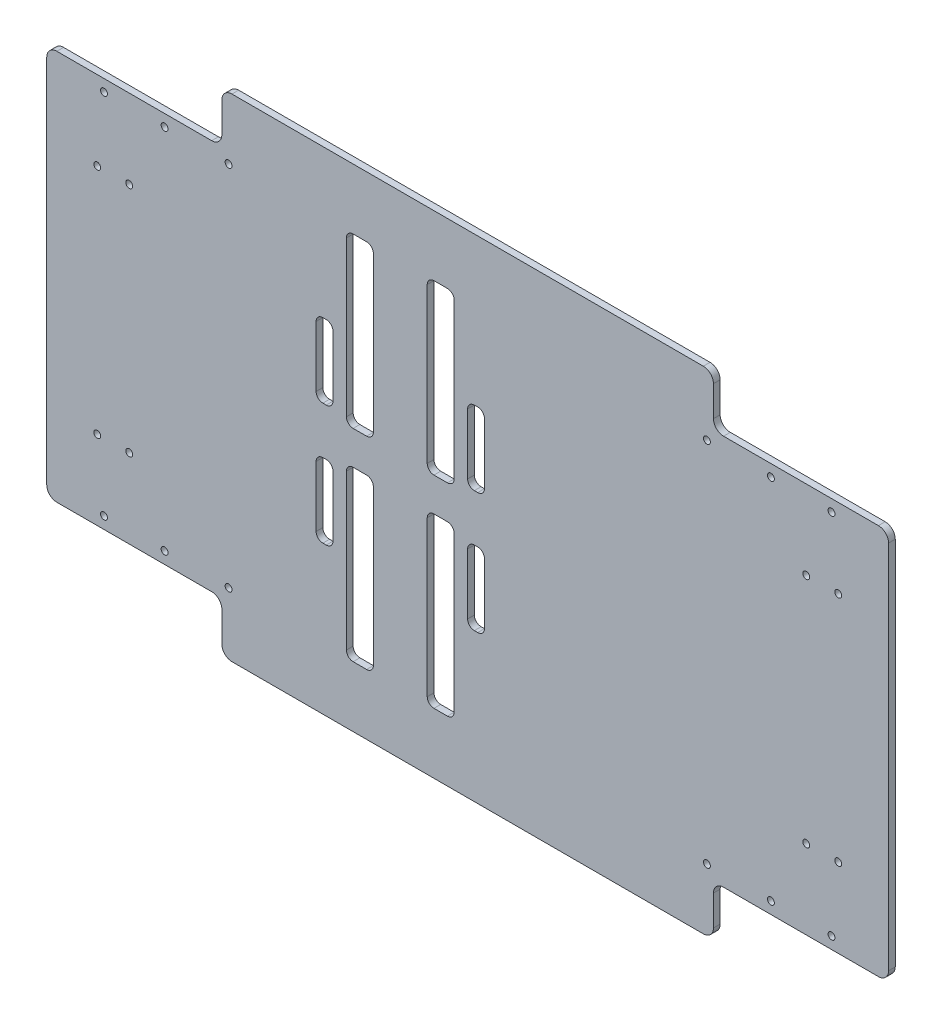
ISO-10303-21;
HEADER;
FILE_DESCRIPTION(('STEP AP214'),'2;1');
FILE_NAME('part.step','',(''),(''),'','','');
FILE_SCHEMA(('AUTOMOTIVE_DESIGN { 1 0 10303 214 1 1 1 1 }'));
ENDSEC;
DATA;
#1=APPLICATION_CONTEXT('core data for automotive mechanical design processes');
#2=APPLICATION_PROTOCOL_DEFINITION('international standard','automotive_design',2000,#1);
#3=PRODUCT_CONTEXT('',#1,'mechanical');
#4=PRODUCT('Part','Part','',(#3));
#5=PRODUCT_RELATED_PRODUCT_CATEGORY('part','',(#4));
#6=PRODUCT_DEFINITION_FORMATION('','',#4);
#7=PRODUCT_DEFINITION_CONTEXT('part definition',#1,'design');
#8=PRODUCT_DEFINITION('design','',#6,#7);
#9=PRODUCT_DEFINITION_SHAPE('','',#8);
#10=(LENGTH_UNIT() NAMED_UNIT(*) SI_UNIT(.MILLI.,.METRE.));
#11=(NAMED_UNIT(*) PLANE_ANGLE_UNIT() SI_UNIT($,.RADIAN.));
#12=(NAMED_UNIT(*) SI_UNIT($,.STERADIAN.) SOLID_ANGLE_UNIT());
#13=UNCERTAINTY_MEASURE_WITH_UNIT(LENGTH_MEASURE(1.E-05),#10,'distance_accuracy_value','');
#14=(GEOMETRIC_REPRESENTATION_CONTEXT(3) GLOBAL_UNCERTAINTY_ASSIGNED_CONTEXT((#13)) GLOBAL_UNIT_ASSIGNED_CONTEXT((#10,
#11,#12)) REPRESENTATION_CONTEXT('',''));
#15=CARTESIAN_POINT('',(0.,0.,0.));
#16=DIRECTION('',(0.,0.,1.));
#17=DIRECTION('',(1.,0.,0.));
#18=AXIS2_PLACEMENT_3D('',#15,#16,#17);
#19=CARTESIAN_POINT('',(0.,0.,0.));
#20=DIRECTION('',(0.,0.,1.));
#21=DIRECTION('',(1.,0.,0.));
#22=AXIS2_PLACEMENT_3D('',#19,#20,#21);
#23=PLANE('',#22);
#24=CARTESIAN_POINT('',(108.071796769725,54.5,0.));
#25=DIRECTION('',(0.,0.,-1.));
#26=DIRECTION('',(-1.,0.,0.));
#27=AXIS2_PLACEMENT_3D('',#24,#25,#26);
#28=CIRCLE('',#27,1.02499999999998);
#29=CARTESIAN_POINT('',(107.046796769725,54.5,0.));
#30=VERTEX_POINT('',#29);
#31=EDGE_CURVE('E2652',#30,#30,#28,.T.);
#32=ORIENTED_EDGE('',*,*,#31,.F.);
#33=EDGE_LOOP('',(#32));
#34=FACE_BOUND('',#33,.T.);
#35=CARTESIAN_POINT('',(90.0717967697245,54.5,0.));
#36=DIRECTION('',(0.,0.,-1.));
#37=DIRECTION('',(-1.,0.,0.));
#38=AXIS2_PLACEMENT_3D('',#35,#36,#37);
#39=CIRCLE('',#38,1.02499999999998);
#40=CARTESIAN_POINT('',(89.0467967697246,54.5,0.));
#41=VERTEX_POINT('',#40);
#42=EDGE_CURVE('E2648',#41,#41,#39,.T.);
#43=ORIENTED_EDGE('',*,*,#42,.F.);
#44=EDGE_LOOP('',(#43));
#45=FACE_BOUND('',#44,.T.);
#46=CARTESIAN_POINT('',(71.0717967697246,54.5,0.));
#47=DIRECTION('',(0.,0.,-1.));
#48=DIRECTION('',(-1.,0.,0.));
#49=AXIS2_PLACEMENT_3D('',#46,#47,#48);
#50=CIRCLE('',#49,1.02499999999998);
#51=CARTESIAN_POINT('',(70.0467967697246,54.5,0.));
#52=VERTEX_POINT('',#51);
#53=EDGE_CURVE('E1124',#52,#52,#50,.T.);
#54=ORIENTED_EDGE('',*,*,#53,.F.);
#55=EDGE_LOOP('',(#54));
#56=FACE_BOUND('',#55,.T.);
#57=CARTESIAN_POINT('',(100.571796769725,34.5,0.));
#58=DIRECTION('',(0.,0.,-1.));
#59=DIRECTION('',(-1.,0.,0.));
#60=AXIS2_PLACEMENT_3D('',#57,#58,#59);
#61=CIRCLE('',#60,1.02499999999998);
#62=CARTESIAN_POINT('',(99.5467967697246,34.5,0.));
#63=VERTEX_POINT('',#62);
#64=EDGE_CURVE('E1115',#63,#63,#61,.T.);
#65=ORIENTED_EDGE('',*,*,#64,.F.);
#66=EDGE_LOOP('',(#65));
#67=FACE_BOUND('',#66,.T.);
#68=CARTESIAN_POINT('',(110.071796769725,-34.5,0.));
#69=DIRECTION('',(0.,0.,-1.));
#70=DIRECTION('',(-1.,0.,0.));
#71=AXIS2_PLACEMENT_3D('',#68,#69,#70);
#72=CIRCLE('',#71,1.02499999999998);
#73=CARTESIAN_POINT('',(109.046796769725,-34.5,0.));
#74=VERTEX_POINT('',#73);
#75=EDGE_CURVE('E1108',#74,#74,#72,.T.);
#76=ORIENTED_EDGE('',*,*,#75,.F.);
#77=EDGE_LOOP('',(#76));
#78=FACE_BOUND('',#77,.T.);
#79=CARTESIAN_POINT('',(100.571796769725,-34.5,0.));
#80=DIRECTION('',(0.,0.,-1.));
#81=DIRECTION('',(-1.,0.,0.));
#82=AXIS2_PLACEMENT_3D('',#79,#80,#81);
#83=CIRCLE('',#82,1.02499999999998);
#84=CARTESIAN_POINT('',(99.5467967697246,-34.5,0.));
#85=VERTEX_POINT('',#84);
#86=EDGE_CURVE('E1103',#85,#85,#83,.T.);
#87=ORIENTED_EDGE('',*,*,#86,.F.);
#88=EDGE_LOOP('',(#87));
#89=FACE_BOUND('',#88,.T.);
#90=CARTESIAN_POINT('',(108.071796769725,-54.5,0.));
#91=DIRECTION('',(0.,0.,-1.));
#92=DIRECTION('',(-1.,0.,0.));
#93=AXIS2_PLACEMENT_3D('',#90,#91,#92);
#94=CIRCLE('',#93,1.02499999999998);
#95=CARTESIAN_POINT('',(107.046796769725,-54.5,0.));
#96=VERTEX_POINT('',#95);
#97=EDGE_CURVE('E1131',#96,#96,#94,.T.);
#98=ORIENTED_EDGE('',*,*,#97,.F.);
#99=EDGE_LOOP('',(#98));
#100=FACE_BOUND('',#99,.T.);
#101=CARTESIAN_POINT('',(90.0717967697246,-54.5,0.));
#102=DIRECTION('',(0.,0.,-1.));
#103=DIRECTION('',(-1.,0.,0.));
#104=AXIS2_PLACEMENT_3D('',#101,#102,#103);
#105=CIRCLE('',#104,1.02499999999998);
#106=CARTESIAN_POINT('',(89.0467967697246,-54.5,0.));
#107=VERTEX_POINT('',#106);
#108=EDGE_CURVE('E1102',#107,#107,#105,.T.);
#109=ORIENTED_EDGE('',*,*,#108,.F.);
#110=EDGE_LOOP('',(#109));
#111=FACE_BOUND('',#110,.T.);
#112=CARTESIAN_POINT('',(-110.,34.5,0.));
#113=DIRECTION('',(0.,0.,-1.));
#114=DIRECTION('',(-1.,0.,0.));
#115=AXIS2_PLACEMENT_3D('',#112,#113,#114);
#116=CIRCLE('',#115,1.025);
#117=CARTESIAN_POINT('',(-111.025,34.5,0.));
#118=VERTEX_POINT('',#117);
#119=EDGE_CURVE('E1097',#118,#118,#116,.T.);
#120=ORIENTED_EDGE('',*,*,#119,.F.);
#121=EDGE_LOOP('',(#120));
#122=FACE_BOUND('',#121,.T.);
#123=CARTESIAN_POINT('',(-100.5,34.5,0.));
#124=DIRECTION('',(0.,0.,-1.));
#125=DIRECTION('',(-1.,0.,0.));
#126=AXIS2_PLACEMENT_3D('',#123,#124,#125);
#127=CIRCLE('',#126,1.025);
#128=CARTESIAN_POINT('',(-101.525,34.5,0.));
#129=VERTEX_POINT('',#128);
#130=EDGE_CURVE('E1147',#129,#129,#127,.T.);
#131=ORIENTED_EDGE('',*,*,#130,.F.);
#132=EDGE_LOOP('',(#131));
#133=FACE_BOUND('',#132,.T.);
#134=CARTESIAN_POINT('',(-108.,54.5,0.));
#135=DIRECTION('',(0.,0.,-1.));
#136=DIRECTION('',(-1.,0.,0.));
#137=AXIS2_PLACEMENT_3D('',#134,#135,#136);
#138=CIRCLE('',#137,1.025);
#139=CARTESIAN_POINT('',(-109.025,54.5,0.));
#140=VERTEX_POINT('',#139);
#141=EDGE_CURVE('E1154',#140,#140,#138,.T.);
#142=ORIENTED_EDGE('',*,*,#141,.F.);
#143=EDGE_LOOP('',(#142));
#144=FACE_BOUND('',#143,.T.);
#145=CARTESIAN_POINT('',(-89.9999999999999,54.5,0.));
#146=DIRECTION('',(0.,0.,-1.));
#147=DIRECTION('',(-1.,0.,0.));
#148=AXIS2_PLACEMENT_3D('',#145,#146,#147);
#149=CIRCLE('',#148,1.025);
#150=CARTESIAN_POINT('',(-91.0249999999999,54.5,0.));
#151=VERTEX_POINT('',#150);
#152=EDGE_CURVE('E1162',#151,#151,#149,.T.);
#153=ORIENTED_EDGE('',*,*,#152,.F.);
#154=EDGE_LOOP('',(#153));
#155=FACE_BOUND('',#154,.T.);
#156=CARTESIAN_POINT('',(-70.9999999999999,54.5,0.));
#157=DIRECTION('',(0.,0.,-1.));
#158=DIRECTION('',(-1.,0.,0.));
#159=AXIS2_PLACEMENT_3D('',#156,#157,#158);
#160=CIRCLE('',#159,1.025);
#161=CARTESIAN_POINT('',(-72.0249999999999,54.5,0.));
#162=VERTEX_POINT('',#161);
#163=EDGE_CURVE('E1170',#162,#162,#160,.T.);
#164=ORIENTED_EDGE('',*,*,#163,.F.);
#165=EDGE_LOOP('',(#164));
#166=FACE_BOUND('',#165,.T.);
#167=CARTESIAN_POINT('',(-110.,-34.5,0.));
#168=DIRECTION('',(0.,0.,-1.));
#169=DIRECTION('',(-1.,0.,0.));
#170=AXIS2_PLACEMENT_3D('',#167,#168,#169);
#171=CIRCLE('',#170,1.025);
#172=CARTESIAN_POINT('',(-111.025,-34.5,0.));
#173=VERTEX_POINT('',#172);
#174=EDGE_CURVE('E1171',#173,#173,#171,.T.);
#175=ORIENTED_EDGE('',*,*,#174,.F.);
#176=EDGE_LOOP('',(#175));
#177=FACE_BOUND('',#176,.T.);
#178=CARTESIAN_POINT('',(-100.5,-34.5,0.));
#179=DIRECTION('',(0.,0.,-1.));
#180=DIRECTION('',(-1.,0.,0.));
#181=AXIS2_PLACEMENT_3D('',#178,#179,#180);
#182=CIRCLE('',#181,1.025);
#183=CARTESIAN_POINT('',(-101.525,-34.5,0.));
#184=VERTEX_POINT('',#183);
#185=EDGE_CURVE('E1176',#184,#184,#182,.T.);
#186=ORIENTED_EDGE('',*,*,#185,.F.);
#187=EDGE_LOOP('',(#186));
#188=FACE_BOUND('',#187,.T.);
#189=CARTESIAN_POINT('',(-70.9999999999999,-54.5,0.));
#190=DIRECTION('',(0.,0.,-1.));
#191=DIRECTION('',(-1.,0.,0.));
#192=AXIS2_PLACEMENT_3D('',#189,#190,#191);
#193=CIRCLE('',#192,1.025);
#194=CARTESIAN_POINT('',(-72.0249999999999,-54.5,0.));
#195=VERTEX_POINT('',#194);
#196=EDGE_CURVE('E1183',#195,#195,#193,.T.);
#197=ORIENTED_EDGE('',*,*,#196,.F.);
#198=EDGE_LOOP('',(#197));
#199=FACE_BOUND('',#198,.T.);
#200=CARTESIAN_POINT('',(-89.9999999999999,-54.5,0.));
#201=DIRECTION('',(0.,0.,-1.));
#202=DIRECTION('',(-1.,0.,0.));
#203=AXIS2_PLACEMENT_3D('',#200,#201,#202);
#204=CIRCLE('',#203,1.025);
#205=CARTESIAN_POINT('',(-91.0249999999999,-54.5,0.));
#206=VERTEX_POINT('',#205);
#207=EDGE_CURVE('E1193',#206,#206,#204,.T.);
#208=ORIENTED_EDGE('',*,*,#207,.F.);
#209=EDGE_LOOP('',(#208));
#210=FACE_BOUND('',#209,.T.);
#211=DIRECTION('',(0.,1.,0.));
#212=VECTOR('',#211,1.);
#213=CARTESIAN_POINT('',(-3.99999999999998,0.,0.));
#214=LINE('',#213,#212);
#215=CARTESIAN_POINT('',(-3.99999999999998,-53.,0.));
#216=VERTEX_POINT('',#215);
#217=CARTESIAN_POINT('',(-3.99999999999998,-7.,0.));
#218=VERTEX_POINT('',#217);
#219=EDGE_CURVE('E1331',#216,#218,#214,.T.);
#220=ORIENTED_EDGE('',*,*,#219,.T.);
#221=CARTESIAN_POINT('',(-5.99999999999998,-7.,0.));
#222=DIRECTION('',(0.,0.,1.));
#223=DIRECTION('',(1.,0.,0.));
#224=AXIS2_PLACEMENT_3D('',#221,#222,#223);
#225=CIRCLE('',#224,2.);
#226=CARTESIAN_POINT('',(-5.99999999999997,-5.,0.));
#227=VERTEX_POINT('',#226);
#228=EDGE_CURVE('E1078',#218,#227,#225,.T.);
#229=ORIENTED_EDGE('',*,*,#228,.T.);
#230=DIRECTION('',(-1.,0.,0.));
#231=VECTOR('',#230,1.);
#232=CARTESIAN_POINT('',(0.,-5.,0.));
#233=LINE('',#232,#231);
#234=CARTESIAN_POINT('',(-9.99999999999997,-4.99999999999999,0.));
#235=VERTEX_POINT('',#234);
#236=EDGE_CURVE('E1201',#227,#235,#233,.T.);
#237=ORIENTED_EDGE('',*,*,#236,.T.);
#238=CARTESIAN_POINT('',(-9.99999999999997,-6.99999999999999,0.));
#239=DIRECTION('',(0.,0.,1.));
#240=DIRECTION('',(1.,0.,0.));
#241=AXIS2_PLACEMENT_3D('',#238,#239,#240);
#242=CIRCLE('',#241,2.);
#243=CARTESIAN_POINT('',(-12.,-6.99999999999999,0.));
#244=VERTEX_POINT('',#243);
#245=EDGE_CURVE('E1072',#235,#244,#242,.T.);
#246=ORIENTED_EDGE('',*,*,#245,.T.);
#247=DIRECTION('',(0.,1.,0.));
#248=VECTOR('',#247,1.);
#249=CARTESIAN_POINT('',(-12.,0.,0.));
#250=LINE('',#249,#248);
#251=CARTESIAN_POINT('',(-12.,-53.,0.));
#252=VERTEX_POINT('',#251);
#253=EDGE_CURVE('E1339',#252,#244,#250,.T.);
#254=ORIENTED_EDGE('',*,*,#253,.F.);
#255=CARTESIAN_POINT('',(-9.99999999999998,-53.,0.));
#256=DIRECTION('',(0.,0.,1.));
#257=DIRECTION('',(1.,0.,0.));
#258=AXIS2_PLACEMENT_3D('',#255,#256,#257);
#259=CIRCLE('',#258,2.);
#260=CARTESIAN_POINT('',(-9.99999999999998,-55.,0.));
#261=VERTEX_POINT('',#260);
#262=EDGE_CURVE('E1062',#252,#261,#259,.T.);
#263=ORIENTED_EDGE('',*,*,#262,.T.);
#264=DIRECTION('',(-1.,0.,0.));
#265=VECTOR('',#264,1.);
#266=CARTESIAN_POINT('',(0.,-55.,0.));
#267=LINE('',#266,#265);
#268=CARTESIAN_POINT('',(-5.99999999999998,-55.,0.));
#269=VERTEX_POINT('',#268);
#270=EDGE_CURVE('E1338',#269,#261,#267,.T.);
#271=ORIENTED_EDGE('',*,*,#270,.F.);
#272=CARTESIAN_POINT('',(-5.99999999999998,-53.,0.));
#273=DIRECTION('',(0.,0.,1.));
#274=DIRECTION('',(1.,0.,0.));
#275=AXIS2_PLACEMENT_3D('',#272,#273,#274);
#276=CIRCLE('',#275,2.);
#277=EDGE_CURVE('E1069',#269,#216,#276,.T.);
#278=ORIENTED_EDGE('',*,*,#277,.T.);
#279=EDGE_LOOP('',(#220,#229,#237,#246,#254,#263,#271,#278));
#280=FACE_BOUND('',#279,.T.);
#281=DIRECTION('',(0.,1.,0.));
#282=VECTOR('',#281,1.);
#283=CARTESIAN_POINT('',(5.00000000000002,0.,0.));
#284=LINE('',#283,#282);
#285=CARTESIAN_POINT('',(5.00000000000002,-27.,0.));
#286=VERTEX_POINT('',#285);
#287=CARTESIAN_POINT('',(5.00000000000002,-8.99999999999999,0.));
#288=VERTEX_POINT('',#287);
#289=EDGE_CURVE('E1344',#286,#288,#284,.T.);
#290=ORIENTED_EDGE('',*,*,#289,.T.);
#291=CARTESIAN_POINT('',(3.00000000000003,-8.99999999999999,0.));
#292=DIRECTION('',(0.,0.,1.));
#293=DIRECTION('',(1.,0.,0.));
#294=AXIS2_PLACEMENT_3D('',#291,#292,#293);
#295=CIRCLE('',#294,2.);
#296=CARTESIAN_POINT('',(3.00000000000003,-6.99999999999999,0.));
#297=VERTEX_POINT('',#296);
#298=EDGE_CURVE('E1082',#288,#297,#295,.T.);
#299=ORIENTED_EDGE('',*,*,#298,.T.);
#300=DIRECTION('',(-1.,0.,0.));
#301=VECTOR('',#300,1.);
#302=CARTESIAN_POINT('',(0.,-6.99999999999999,0.));
#303=LINE('',#302,#301);
#304=CARTESIAN_POINT('',(2.00000000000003,-6.99999999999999,0.));
#305=VERTEX_POINT('',#304);
#306=EDGE_CURVE('E1345',#297,#305,#303,.T.);
#307=ORIENTED_EDGE('',*,*,#306,.T.);
#308=CARTESIAN_POINT('',(2.00000000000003,-8.99999999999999,0.));
#309=DIRECTION('',(0.,0.,1.));
#310=DIRECTION('',(1.,0.,0.));
#311=AXIS2_PLACEMENT_3D('',#308,#309,#310);
#312=CIRCLE('',#311,2.);
#313=CARTESIAN_POINT('',(0.,-8.99999999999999,0.));
#314=VERTEX_POINT('',#313);
#315=EDGE_CURVE('E1077',#305,#314,#312,.T.);
#316=ORIENTED_EDGE('',*,*,#315,.T.);
#317=DIRECTION('',(0.,1.,0.));
#318=VECTOR('',#317,1.);
#319=CARTESIAN_POINT('',(0.,0.,0.));
#320=LINE('',#319,#318);
#321=CARTESIAN_POINT('',(0.,-27.,0.));
#322=VERTEX_POINT('',#321);
#323=EDGE_CURVE('E1349',#322,#314,#320,.T.);
#324=ORIENTED_EDGE('',*,*,#323,.F.);
#325=CARTESIAN_POINT('',(2.00000000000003,-27.,0.));
#326=DIRECTION('',(0.,0.,1.));
#327=DIRECTION('',(1.,0.,0.));
#328=AXIS2_PLACEMENT_3D('',#325,#326,#327);
#329=CIRCLE('',#328,2.);
#330=CARTESIAN_POINT('',(2.00000000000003,-29.,0.));
#331=VERTEX_POINT('',#330);
#332=EDGE_CURVE('E1088',#322,#331,#329,.T.);
#333=ORIENTED_EDGE('',*,*,#332,.T.);
#334=DIRECTION('',(-1.,0.,0.));
#335=VECTOR('',#334,1.);
#336=CARTESIAN_POINT('',(0.,-29.,0.));
#337=LINE('',#336,#335);
#338=CARTESIAN_POINT('',(3.00000000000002,-29.,0.));
#339=VERTEX_POINT('',#338);
#340=EDGE_CURVE('E1348',#339,#331,#337,.T.);
#341=ORIENTED_EDGE('',*,*,#340,.F.);
#342=CARTESIAN_POINT('',(3.00000000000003,-27.,0.));
#343=DIRECTION('',(0.,0.,1.));
#344=DIRECTION('',(1.,0.,0.));
#345=AXIS2_PLACEMENT_3D('',#342,#343,#344);
#346=CIRCLE('',#345,2.);
#347=EDGE_CURVE('E55',#339,#286,#346,.T.);
#348=ORIENTED_EDGE('',*,*,#347,.T.);
#349=EDGE_LOOP('',(#290,#299,#307,#316,#324,#333,#341,#348));
#350=FACE_BOUND('',#349,.T.);
#351=DIRECTION('',(0.,-1.,0.));
#352=VECTOR('',#351,1.);
#353=CARTESIAN_POINT('',(-125.,0.,0.));
#354=LINE('',#353,#352);
#355=CARTESIAN_POINT('',(-125.,55.,0.));
#356=VERTEX_POINT('',#355);
#357=CARTESIAN_POINT('',(-125.,-55.,0.));
#358=VERTEX_POINT('',#357);
#359=EDGE_CURVE('E610',#356,#358,#354,.T.);
#360=ORIENTED_EDGE('',*,*,#359,.F.);
#361=CARTESIAN_POINT('',(-122.,55.,0.));
#362=DIRECTION('',(0.,0.,1.));
#363=DIRECTION('',(1.,0.,0.));
#364=AXIS2_PLACEMENT_3D('',#361,#362,#363);
#365=CIRCLE('',#364,3.);
#366=CARTESIAN_POINT('',(-122.,58.,0.));
#367=VERTEX_POINT('',#366);
#368=EDGE_CURVE('E589',#356,#367,#365,.F.);
#369=ORIENTED_EDGE('',*,*,#368,.T.);
#370=DIRECTION('',(1.,0.,0.));
#371=VECTOR('',#370,1.);
#372=CARTESIAN_POINT('',(0.,58.,0.));
#373=LINE('',#372,#371);
#374=CARTESIAN_POINT('',(-76.,58.,0.));
#375=VERTEX_POINT('',#374);
#376=EDGE_CURVE('E617',#367,#375,#373,.T.);
#377=ORIENTED_EDGE('',*,*,#376,.T.);
#378=CARTESIAN_POINT('',(-76.,61.,0.));
#379=DIRECTION('',(0.,0.,1.));
#380=DIRECTION('',(1.,0.,0.));
#381=AXIS2_PLACEMENT_3D('',#378,#379,#380);
#382=CIRCLE('',#381,3.);
#383=CARTESIAN_POINT('',(-73.,61.,0.));
#384=VERTEX_POINT('',#383);
#385=EDGE_CURVE('E791',#375,#384,#382,.T.);
#386=ORIENTED_EDGE('',*,*,#385,.T.);
#387=DIRECTION('',(0.,1.,0.));
#388=VECTOR('',#387,1.);
#389=CARTESIAN_POINT('',(-73.,0.,0.));
#390=LINE('',#389,#388);
#391=CARTESIAN_POINT('',(-73.,70.,0.));
#392=VERTEX_POINT('',#391);
#393=EDGE_CURVE('E625',#384,#392,#390,.T.);
#394=ORIENTED_EDGE('',*,*,#393,.T.);
#395=CARTESIAN_POINT('',(-70.,70.,0.));
#396=DIRECTION('',(0.,0.,1.));
#397=DIRECTION('',(1.,0.,0.));
#398=AXIS2_PLACEMENT_3D('',#395,#396,#397);
#399=CIRCLE('',#398,3.);
#400=CARTESIAN_POINT('',(-70.,73.,0.));
#401=VERTEX_POINT('',#400);
#402=EDGE_CURVE('E602',#392,#401,#399,.F.);
#403=ORIENTED_EDGE('',*,*,#402,.T.);
#404=DIRECTION('',(1.,0.,0.));
#405=VECTOR('',#404,1.);
#406=CARTESIAN_POINT('',(0.,73.,0.));
#407=LINE('',#406,#405);
#408=CARTESIAN_POINT('',(70.,73.,0.));
#409=VERTEX_POINT('',#408);
#410=EDGE_CURVE('E1365',#401,#409,#407,.T.);
#411=ORIENTED_EDGE('',*,*,#410,.T.);
#412=CARTESIAN_POINT('',(70.,70.,0.));
#413=DIRECTION('',(0.,0.,1.));
#414=DIRECTION('',(1.,0.,0.));
#415=AXIS2_PLACEMENT_3D('',#412,#413,#414);
#416=CIRCLE('',#415,3.);
#417=CARTESIAN_POINT('',(73.,70.,0.));
#418=VERTEX_POINT('',#417);
#419=EDGE_CURVE('E722',#409,#418,#416,.F.);
#420=ORIENTED_EDGE('',*,*,#419,.T.);
#421=DIRECTION('',(0.,1.,0.));
#422=VECTOR('',#421,1.);
#423=CARTESIAN_POINT('',(73.,0.,0.));
#424=LINE('',#423,#422);
#425=CARTESIAN_POINT('',(73.,61.,0.));
#426=VERTEX_POINT('',#425);
#427=EDGE_CURVE('E1356',#426,#418,#424,.T.);
#428=ORIENTED_EDGE('',*,*,#427,.F.);
#429=CARTESIAN_POINT('',(76.,61.,0.));
#430=DIRECTION('',(0.,0.,1.));
#431=DIRECTION('',(1.,0.,0.));
#432=AXIS2_PLACEMENT_3D('',#429,#430,#431);
#433=CIRCLE('',#432,3.);
#434=CARTESIAN_POINT('',(76.,58.,0.));
#435=VERTEX_POINT('',#434);
#436=EDGE_CURVE('E800',#426,#435,#433,.T.);
#437=ORIENTED_EDGE('',*,*,#436,.T.);
#438=DIRECTION('',(-1.,0.,0.));
#439=VECTOR('',#438,1.);
#440=CARTESIAN_POINT('',(0.,58.,0.));
#441=LINE('',#440,#439);
#442=CARTESIAN_POINT('',(122.,58.,0.));
#443=VERTEX_POINT('',#442);
#444=EDGE_CURVE('E1357',#443,#435,#441,.T.);
#445=ORIENTED_EDGE('',*,*,#444,.F.);
#446=CARTESIAN_POINT('',(122.,55.,0.));
#447=DIRECTION('',(0.,0.,1.));
#448=DIRECTION('',(1.,0.,0.));
#449=AXIS2_PLACEMENT_3D('',#446,#447,#448);
#450=CIRCLE('',#449,3.);
#451=CARTESIAN_POINT('',(125.,55.,0.));
#452=VERTEX_POINT('',#451);
#453=EDGE_CURVE('E717',#443,#452,#450,.F.);
#454=ORIENTED_EDGE('',*,*,#453,.T.);
#455=DIRECTION('',(0.,-1.,0.));
#456=VECTOR('',#455,1.);
#457=CARTESIAN_POINT('',(125.,0.,0.));
#458=LINE('',#457,#456);
#459=CARTESIAN_POINT('',(125.,-55.,0.));
#460=VERTEX_POINT('',#459);
#461=EDGE_CURVE('E1352',#452,#460,#458,.T.);
#462=ORIENTED_EDGE('',*,*,#461,.T.);
#463=CARTESIAN_POINT('',(122.,-55.,0.));
#464=DIRECTION('',(0.,0.,1.));
#465=DIRECTION('',(1.,0.,0.));
#466=AXIS2_PLACEMENT_3D('',#463,#464,#465);
#467=CIRCLE('',#466,3.);
#468=CARTESIAN_POINT('',(122.,-58.,0.));
#469=VERTEX_POINT('',#468);
#470=EDGE_CURVE('E720',#460,#469,#467,.F.);
#471=ORIENTED_EDGE('',*,*,#470,.T.);
#472=DIRECTION('',(-1.,0.,0.));
#473=VECTOR('',#472,1.);
#474=CARTESIAN_POINT('',(0.,-58.,0.));
#475=LINE('',#474,#473);
#476=CARTESIAN_POINT('',(76.,-58.,0.));
#477=VERTEX_POINT('',#476);
#478=EDGE_CURVE('E632',#469,#477,#475,.T.);
#479=ORIENTED_EDGE('',*,*,#478,.T.);
#480=CARTESIAN_POINT('',(76.,-61.,0.));
#481=DIRECTION('',(0.,0.,1.));
#482=DIRECTION('',(1.,0.,0.));
#483=AXIS2_PLACEMENT_3D('',#480,#481,#482);
#484=CIRCLE('',#483,3.);
#485=CARTESIAN_POINT('',(73.,-61.,0.));
#486=VERTEX_POINT('',#485);
#487=EDGE_CURVE('E803',#477,#486,#484,.T.);
#488=ORIENTED_EDGE('',*,*,#487,.T.);
#489=DIRECTION('',(0.,-1.,0.));
#490=VECTOR('',#489,1.);
#491=CARTESIAN_POINT('',(73.,0.,0.));
#492=LINE('',#491,#490);
#493=CARTESIAN_POINT('',(73.,-70.,0.));
#494=VERTEX_POINT('',#493);
#495=EDGE_CURVE('E631',#486,#494,#492,.T.);
#496=ORIENTED_EDGE('',*,*,#495,.T.);
#497=CARTESIAN_POINT('',(70.,-70.,0.));
#498=DIRECTION('',(0.,0.,1.));
#499=DIRECTION('',(1.,0.,0.));
#500=AXIS2_PLACEMENT_3D('',#497,#498,#499);
#501=CIRCLE('',#500,3.);
#502=CARTESIAN_POINT('',(70.,-73.,0.));
#503=VERTEX_POINT('',#502);
#504=EDGE_CURVE('E713',#494,#503,#501,.F.);
#505=ORIENTED_EDGE('',*,*,#504,.T.);
#506=DIRECTION('',(1.,0.,0.));
#507=VECTOR('',#506,1.);
#508=CARTESIAN_POINT('',(0.,-73.,0.));
#509=LINE('',#508,#507);
#510=CARTESIAN_POINT('',(-70.,-73.,0.));
#511=VERTEX_POINT('',#510);
#512=EDGE_CURVE('E628',#511,#503,#509,.T.);
#513=ORIENTED_EDGE('',*,*,#512,.F.);
#514=CARTESIAN_POINT('',(-70.,-70.,0.));
#515=DIRECTION('',(0.,0.,1.));
#516=DIRECTION('',(1.,0.,0.));
#517=AXIS2_PLACEMENT_3D('',#514,#515,#516);
#518=CIRCLE('',#517,3.);
#519=CARTESIAN_POINT('',(-73.,-70.,0.));
#520=VERTEX_POINT('',#519);
#521=EDGE_CURVE('E714',#511,#520,#518,.F.);
#522=ORIENTED_EDGE('',*,*,#521,.T.);
#523=DIRECTION('',(0.,-1.,0.));
#524=VECTOR('',#523,1.);
#525=CARTESIAN_POINT('',(-73.,0.,0.));
#526=LINE('',#525,#524);
#527=CARTESIAN_POINT('',(-73.,-61.,0.));
#528=VERTEX_POINT('',#527);
#529=EDGE_CURVE('E619',#528,#520,#526,.T.);
#530=ORIENTED_EDGE('',*,*,#529,.F.);
#531=CARTESIAN_POINT('',(-76.,-61.,0.));
#532=DIRECTION('',(0.,0.,1.));
#533=DIRECTION('',(1.,0.,0.));
#534=AXIS2_PLACEMENT_3D('',#531,#532,#533);
#535=CIRCLE('',#534,3.);
#536=CARTESIAN_POINT('',(-76.,-58.,0.));
#537=VERTEX_POINT('',#536);
#538=EDGE_CURVE('E804',#528,#537,#535,.T.);
#539=ORIENTED_EDGE('',*,*,#538,.T.);
#540=DIRECTION('',(1.,0.,0.));
#541=VECTOR('',#540,1.);
#542=CARTESIAN_POINT('',(0.,-58.,0.));
#543=LINE('',#542,#541);
#544=CARTESIAN_POINT('',(-122.,-58.,0.));
#545=VERTEX_POINT('',#544);
#546=EDGE_CURVE('E618',#545,#537,#543,.T.);
#547=ORIENTED_EDGE('',*,*,#546,.F.);
#548=CARTESIAN_POINT('',(-122.,-55.,0.));
#549=DIRECTION('',(0.,0.,1.));
#550=DIRECTION('',(1.,0.,0.));
#551=AXIS2_PLACEMENT_3D('',#548,#549,#550);
#552=CIRCLE('',#551,3.);
#553=EDGE_CURVE('E612',#545,#358,#552,.F.);
#554=ORIENTED_EDGE('',*,*,#553,.T.);
#555=EDGE_LOOP('',(#360,#369,#377,#386,#394,#403,#411,#420,#428,#437,#445,#454,#462,#471,#479,
#488,#496,#505,#513,#522,#530,#539,#547,#554));
#556=FACE_BOUND('',#555,.T.);
#557=DIRECTION('',(1.,0.,0.));
#558=VECTOR('',#557,1.);
#559=CARTESIAN_POINT('',(0.,55.,0.));
#560=LINE('',#559,#558);
#561=CARTESIAN_POINT('',(-34.,55.,0.));
#562=VERTEX_POINT('',#561);
#563=CARTESIAN_POINT('',(-30.,55.,0.));
#564=VERTEX_POINT('',#563);
#565=EDGE_CURVE('E640',#562,#564,#560,.T.);
#566=ORIENTED_EDGE('',*,*,#565,.F.);
#567=CARTESIAN_POINT('',(-34.,53.,0.));
#568=DIRECTION('',(0.,0.,1.));
#569=DIRECTION('',(1.,0.,0.));
#570=AXIS2_PLACEMENT_3D('',#567,#568,#569);
#571=CIRCLE('',#570,2.);
#572=CARTESIAN_POINT('',(-36.,53.,0.));
#573=VERTEX_POINT('',#572);
#574=EDGE_CURVE('E978',#562,#573,#571,.T.);
#575=ORIENTED_EDGE('',*,*,#574,.T.);
#576=DIRECTION('',(0.,-1.,0.));
#577=VECTOR('',#576,1.);
#578=CARTESIAN_POINT('',(-36.,0.,0.));
#579=LINE('',#578,#577);
#580=CARTESIAN_POINT('',(-36.,7.,0.));
#581=VERTEX_POINT('',#580);
#582=EDGE_CURVE('E647',#573,#581,#579,.T.);
#583=ORIENTED_EDGE('',*,*,#582,.T.);
#584=CARTESIAN_POINT('',(-34.,7.,0.));
#585=DIRECTION('',(0.,0.,1.));
#586=DIRECTION('',(1.,0.,0.));
#587=AXIS2_PLACEMENT_3D('',#584,#585,#586);
#588=CIRCLE('',#587,2.);
#589=CARTESIAN_POINT('',(-34.,5.,0.));
#590=VERTEX_POINT('',#589);
#591=EDGE_CURVE('E1006',#581,#590,#588,.T.);
#592=ORIENTED_EDGE('',*,*,#591,.T.);
#593=DIRECTION('',(1.,0.,0.));
#594=VECTOR('',#593,1.);
#595=CARTESIAN_POINT('',(0.,4.99999999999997,0.));
#596=LINE('',#595,#594);
#597=CARTESIAN_POINT('',(-30.,4.99999999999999,0.));
#598=VERTEX_POINT('',#597);
#599=EDGE_CURVE('E644',#590,#598,#596,.T.);
#600=ORIENTED_EDGE('',*,*,#599,.T.);
#601=CARTESIAN_POINT('',(-30.,6.99999999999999,0.));
#602=DIRECTION('',(0.,0.,1.));
#603=DIRECTION('',(1.,0.,0.));
#604=AXIS2_PLACEMENT_3D('',#601,#602,#603);
#605=CIRCLE('',#604,2.);
#606=CARTESIAN_POINT('',(-28.,6.99999999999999,0.));
#607=VERTEX_POINT('',#606);
#608=EDGE_CURVE('E1015',#598,#607,#605,.T.);
#609=ORIENTED_EDGE('',*,*,#608,.T.);
#610=DIRECTION('',(0.,-1.,0.));
#611=VECTOR('',#610,1.);
#612=CARTESIAN_POINT('',(-28.,0.,0.));
#613=LINE('',#612,#611);
#614=CARTESIAN_POINT('',(-28.,53.,0.));
#615=VERTEX_POINT('',#614);
#616=EDGE_CURVE('E639',#615,#607,#613,.T.);
#617=ORIENTED_EDGE('',*,*,#616,.F.);
#618=CARTESIAN_POINT('',(-30.,53.,0.));
#619=DIRECTION('',(0.,0.,1.));
#620=DIRECTION('',(1.,0.,0.));
#621=AXIS2_PLACEMENT_3D('',#618,#619,#620);
#622=CIRCLE('',#621,2.);
#623=EDGE_CURVE('E979',#615,#564,#622,.T.);
#624=ORIENTED_EDGE('',*,*,#623,.T.);
#625=EDGE_LOOP('',(#566,#575,#583,#592,#600,#609,#617,#624));
#626=FACE_BOUND('',#625,.T.);
#627=DIRECTION('',(1.,0.,0.));
#628=VECTOR('',#627,1.);
#629=CARTESIAN_POINT('',(0.,29.,0.));
#630=LINE('',#629,#628);
#631=CARTESIAN_POINT('',(-43.,29.,0.));
#632=VERTEX_POINT('',#631);
#633=CARTESIAN_POINT('',(-42.,29.,0.));
#634=VERTEX_POINT('',#633);
#635=EDGE_CURVE('E646',#632,#634,#630,.T.);
#636=ORIENTED_EDGE('',*,*,#635,.F.);
#637=CARTESIAN_POINT('',(-43.,27.,0.));
#638=DIRECTION('',(0.,0.,1.));
#639=DIRECTION('',(1.,0.,0.));
#640=AXIS2_PLACEMENT_3D('',#637,#638,#639);
#641=CIRCLE('',#640,2.);
#642=CARTESIAN_POINT('',(-45.,27.,0.));
#643=VERTEX_POINT('',#642);
#644=EDGE_CURVE('E975',#632,#643,#641,.T.);
#645=ORIENTED_EDGE('',*,*,#644,.T.);
#646=DIRECTION('',(0.,-1.,0.));
#647=VECTOR('',#646,1.);
#648=CARTESIAN_POINT('',(-45.,0.,0.));
#649=LINE('',#648,#647);
#650=CARTESIAN_POINT('',(-45.,8.99999999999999,0.));
#651=VERTEX_POINT('',#650);
#652=EDGE_CURVE('E659',#643,#651,#649,.T.);
#653=ORIENTED_EDGE('',*,*,#652,.T.);
#654=CARTESIAN_POINT('',(-43.,8.99999999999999,0.));
#655=DIRECTION('',(0.,0.,1.));
#656=DIRECTION('',(1.,0.,0.));
#657=AXIS2_PLACEMENT_3D('',#654,#655,#656);
#658=CIRCLE('',#657,2.);
#659=CARTESIAN_POINT('',(-43.,6.99999999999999,0.));
#660=VERTEX_POINT('',#659);
#661=EDGE_CURVE('E999',#651,#660,#658,.T.);
#662=ORIENTED_EDGE('',*,*,#661,.T.);
#663=DIRECTION('',(1.,0.,0.));
#664=VECTOR('',#663,1.);
#665=CARTESIAN_POINT('',(0.,6.99999999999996,0.));
#666=LINE('',#665,#664);
#667=CARTESIAN_POINT('',(-42.,6.99999999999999,0.));
#668=VERTEX_POINT('',#667);
#669=EDGE_CURVE('E654',#660,#668,#666,.T.);
#670=ORIENTED_EDGE('',*,*,#669,.T.);
#671=CARTESIAN_POINT('',(-42.,8.99999999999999,0.));
#672=DIRECTION('',(0.,0.,1.));
#673=DIRECTION('',(1.,0.,0.));
#674=AXIS2_PLACEMENT_3D('',#671,#672,#673);
#675=CIRCLE('',#674,2.);
#676=CARTESIAN_POINT('',(-40.,8.99999999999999,0.));
#677=VERTEX_POINT('',#676);
#678=EDGE_CURVE('E1001',#668,#677,#675,.T.);
#679=ORIENTED_EDGE('',*,*,#678,.T.);
#680=DIRECTION('',(0.,-1.,0.));
#681=VECTOR('',#680,1.);
#682=CARTESIAN_POINT('',(-40.,0.,0.));
#683=LINE('',#682,#681);
#684=CARTESIAN_POINT('',(-40.,27.,0.));
#685=VERTEX_POINT('',#684);
#686=EDGE_CURVE('E655',#685,#677,#683,.T.);
#687=ORIENTED_EDGE('',*,*,#686,.F.);
#688=CARTESIAN_POINT('',(-42.,27.,0.));
#689=DIRECTION('',(0.,0.,1.));
#690=DIRECTION('',(1.,0.,0.));
#691=AXIS2_PLACEMENT_3D('',#688,#689,#690);
#692=CIRCLE('',#691,2.);
#693=EDGE_CURVE('E969',#685,#634,#692,.T.);
#694=ORIENTED_EDGE('',*,*,#693,.T.);
#695=EDGE_LOOP('',(#636,#645,#653,#662,#670,#679,#687,#694));
#696=FACE_BOUND('',#695,.T.);
#697=DIRECTION('',(0.,-1.,0.));
#698=VECTOR('',#697,1.);
#699=CARTESIAN_POINT('',(5.00000000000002,0.,0.));
#700=LINE('',#699,#698);
#701=CARTESIAN_POINT('',(5.00000000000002,27.,0.));
#702=VERTEX_POINT('',#701);
#703=CARTESIAN_POINT('',(5.00000000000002,8.99999999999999,0.));
#704=VERTEX_POINT('',#703);
#705=EDGE_CURVE('E664',#702,#704,#700,.T.);
#706=ORIENTED_EDGE('',*,*,#705,.F.);
#707=CARTESIAN_POINT('',(3.00000000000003,27.,0.));
#708=DIRECTION('',(0.,0.,1.));
#709=DIRECTION('',(1.,0.,0.));
#710=AXIS2_PLACEMENT_3D('',#707,#708,#709);
#711=CIRCLE('',#710,2.);
#712=CARTESIAN_POINT('',(3.00000000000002,29.,0.));
#713=VERTEX_POINT('',#712);
#714=EDGE_CURVE('E998',#702,#713,#711,.T.);
#715=ORIENTED_EDGE('',*,*,#714,.T.);
#716=DIRECTION('',(-1.,0.,0.));
#717=VECTOR('',#716,1.);
#718=CARTESIAN_POINT('',(0.,29.,0.));
#719=LINE('',#718,#717);
#720=CARTESIAN_POINT('',(2.00000000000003,29.,0.));
#721=VERTEX_POINT('',#720);
#722=EDGE_CURVE('E662',#713,#721,#719,.T.);
#723=ORIENTED_EDGE('',*,*,#722,.T.);
#724=CARTESIAN_POINT('',(2.00000000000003,27.,0.));
#725=DIRECTION('',(0.,0.,1.));
#726=DIRECTION('',(1.,0.,0.));
#727=AXIS2_PLACEMENT_3D('',#724,#725,#726);
#728=CIRCLE('',#727,2.);
#729=CARTESIAN_POINT('',(0.,27.,0.));
#730=VERTEX_POINT('',#729);
#731=EDGE_CURVE('E995',#721,#730,#728,.T.);
#732=ORIENTED_EDGE('',*,*,#731,.T.);
#733=DIRECTION('',(0.,-1.,0.));
#734=VECTOR('',#733,1.);
#735=CARTESIAN_POINT('',(0.,0.,0.));
#736=LINE('',#735,#734);
#737=CARTESIAN_POINT('',(0.,8.99999999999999,0.));
#738=VERTEX_POINT('',#737);
#739=EDGE_CURVE('E668',#730,#738,#736,.T.);
#740=ORIENTED_EDGE('',*,*,#739,.T.);
#741=CARTESIAN_POINT('',(2.00000000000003,8.99999999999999,0.));
#742=DIRECTION('',(0.,0.,1.));
#743=DIRECTION('',(1.,0.,0.));
#744=AXIS2_PLACEMENT_3D('',#741,#742,#743);
#745=CIRCLE('',#744,2.);
#746=CARTESIAN_POINT('',(2.00000000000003,6.99999999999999,0.));
#747=VERTEX_POINT('',#746);
#748=EDGE_CURVE('E1022',#738,#747,#745,.T.);
#749=ORIENTED_EDGE('',*,*,#748,.T.);
#750=DIRECTION('',(-1.,0.,0.));
#751=VECTOR('',#750,1.);
#752=CARTESIAN_POINT('',(0.,6.99999999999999,0.));
#753=LINE('',#752,#751);
#754=CARTESIAN_POINT('',(3.00000000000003,6.99999999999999,0.));
#755=VERTEX_POINT('',#754);
#756=EDGE_CURVE('E670',#755,#747,#753,.T.);
#757=ORIENTED_EDGE('',*,*,#756,.F.);
#758=CARTESIAN_POINT('',(3.00000000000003,8.99999999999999,0.));
#759=DIRECTION('',(0.,0.,1.));
#760=DIRECTION('',(1.,0.,0.));
#761=AXIS2_PLACEMENT_3D('',#758,#759,#760);
#762=CIRCLE('',#761,2.);
#763=EDGE_CURVE('E1027',#755,#704,#762,.T.);
#764=ORIENTED_EDGE('',*,*,#763,.T.);
#765=EDGE_LOOP('',(#706,#715,#723,#732,#740,#749,#757,#764));
#766=FACE_BOUND('',#765,.T.);
#767=DIRECTION('',(0.,-1.,0.));
#768=VECTOR('',#767,1.);
#769=CARTESIAN_POINT('',(-3.99999999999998,0.,0.));
#770=LINE('',#769,#768);
#771=CARTESIAN_POINT('',(-3.99999999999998,53.,0.));
#772=VERTEX_POINT('',#771);
#773=CARTESIAN_POINT('',(-3.99999999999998,7.,0.));
#774=VERTEX_POINT('',#773);
#775=EDGE_CURVE('E677',#772,#774,#770,.T.);
#776=ORIENTED_EDGE('',*,*,#775,.F.);
#777=CARTESIAN_POINT('',(-5.99999999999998,53.,0.));
#778=DIRECTION('',(0.,0.,1.));
#779=DIRECTION('',(1.,0.,0.));
#780=AXIS2_PLACEMENT_3D('',#777,#778,#779);
#781=CIRCLE('',#780,2.);
#782=CARTESIAN_POINT('',(-5.99999999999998,55.,0.));
#783=VERTEX_POINT('',#782);
#784=EDGE_CURVE('E981',#772,#783,#781,.T.);
#785=ORIENTED_EDGE('',*,*,#784,.T.);
#786=DIRECTION('',(-1.,0.,0.));
#787=VECTOR('',#786,1.);
#788=CARTESIAN_POINT('',(0.,55.,0.));
#789=LINE('',#788,#787);
#790=CARTESIAN_POINT('',(-9.99999999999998,55.,0.));
#791=VERTEX_POINT('',#790);
#792=EDGE_CURVE('E671',#783,#791,#789,.T.);
#793=ORIENTED_EDGE('',*,*,#792,.T.);
#794=CARTESIAN_POINT('',(-9.99999999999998,53.,0.));
#795=DIRECTION('',(0.,0.,1.));
#796=DIRECTION('',(1.,0.,0.));
#797=AXIS2_PLACEMENT_3D('',#794,#795,#796);
#798=CIRCLE('',#797,2.);
#799=CARTESIAN_POINT('',(-12.,53.,0.));
#800=VERTEX_POINT('',#799);
#801=EDGE_CURVE('E986',#791,#800,#798,.T.);
#802=ORIENTED_EDGE('',*,*,#801,.T.);
#803=DIRECTION('',(0.,-1.,0.));
#804=VECTOR('',#803,1.);
#805=CARTESIAN_POINT('',(-12.,0.,0.));
#806=LINE('',#805,#804);
#807=CARTESIAN_POINT('',(-12.,6.99999999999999,0.));
#808=VERTEX_POINT('',#807);
#809=EDGE_CURVE('E682',#800,#808,#806,.T.);
#810=ORIENTED_EDGE('',*,*,#809,.T.);
#811=CARTESIAN_POINT('',(-9.99999999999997,6.99999999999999,0.));
#812=DIRECTION('',(0.,0.,1.));
#813=DIRECTION('',(1.,0.,0.));
#814=AXIS2_PLACEMENT_3D('',#811,#812,#813);
#815=CIRCLE('',#814,2.);
#816=CARTESIAN_POINT('',(-9.99999999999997,4.99999999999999,0.));
#817=VERTEX_POINT('',#816);
#818=EDGE_CURVE('E1016',#808,#817,#815,.T.);
#819=ORIENTED_EDGE('',*,*,#818,.T.);
#820=DIRECTION('',(-1.,0.,0.));
#821=VECTOR('',#820,1.);
#822=CARTESIAN_POINT('',(0.,5.,0.));
#823=LINE('',#822,#821);
#824=CARTESIAN_POINT('',(-5.99999999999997,5.,0.));
#825=VERTEX_POINT('',#824);
#826=EDGE_CURVE('E676',#825,#817,#823,.T.);
#827=ORIENTED_EDGE('',*,*,#826,.F.);
#828=CARTESIAN_POINT('',(-5.99999999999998,7.,0.));
#829=DIRECTION('',(0.,0.,1.));
#830=DIRECTION('',(1.,0.,0.));
#831=AXIS2_PLACEMENT_3D('',#828,#829,#830);
#832=CIRCLE('',#831,2.);
#833=EDGE_CURVE('E1019',#825,#774,#832,.T.);
#834=ORIENTED_EDGE('',*,*,#833,.T.);
#835=EDGE_LOOP('',(#776,#785,#793,#802,#810,#819,#827,#834));
#836=FACE_BOUND('',#835,.T.);
#837=DIRECTION('',(0.,1.,0.));
#838=VECTOR('',#837,1.);
#839=CARTESIAN_POINT('',(-45.,0.,0.));
#840=LINE('',#839,#838);
#841=CARTESIAN_POINT('',(-45.,-27.,0.));
#842=VERTEX_POINT('',#841);
#843=CARTESIAN_POINT('',(-45.,-8.99999999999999,0.));
#844=VERTEX_POINT('',#843);
#845=EDGE_CURVE('E686',#842,#844,#840,.T.);
#846=ORIENTED_EDGE('',*,*,#845,.F.);
#847=CARTESIAN_POINT('',(-43.,-27.,0.));
#848=DIRECTION('',(0.,0.,1.));
#849=DIRECTION('',(1.,0.,0.));
#850=AXIS2_PLACEMENT_3D('',#847,#848,#849);
#851=CIRCLE('',#850,2.);
#852=CARTESIAN_POINT('',(-43.,-29.,0.));
#853=VERTEX_POINT('',#852);
#854=EDGE_CURVE('E1035',#842,#853,#851,.T.);
#855=ORIENTED_EDGE('',*,*,#854,.T.);
#856=DIRECTION('',(1.,0.,0.));
#857=VECTOR('',#856,1.);
#858=CARTESIAN_POINT('',(0.,-29.,0.));
#859=LINE('',#858,#857);
#860=CARTESIAN_POINT('',(-42.,-29.,0.));
#861=VERTEX_POINT('',#860);
#862=EDGE_CURVE('E684',#853,#861,#859,.T.);
#863=ORIENTED_EDGE('',*,*,#862,.T.);
#864=CARTESIAN_POINT('',(-42.,-27.,0.));
#865=DIRECTION('',(0.,0.,1.));
#866=DIRECTION('',(1.,0.,0.));
#867=AXIS2_PLACEMENT_3D('',#864,#865,#866);
#868=CIRCLE('',#867,2.);
#869=CARTESIAN_POINT('',(-40.,-27.,0.));
#870=VERTEX_POINT('',#869);
#871=EDGE_CURVE('E1037',#861,#870,#868,.T.);
#872=ORIENTED_EDGE('',*,*,#871,.T.);
#873=DIRECTION('',(0.,1.,0.));
#874=VECTOR('',#873,1.);
#875=CARTESIAN_POINT('',(-40.,0.,0.));
#876=LINE('',#875,#874);
#877=CARTESIAN_POINT('',(-40.,-8.99999999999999,0.));
#878=VERTEX_POINT('',#877);
#879=EDGE_CURVE('E692',#870,#878,#876,.T.);
#880=ORIENTED_EDGE('',*,*,#879,.T.);
#881=CARTESIAN_POINT('',(-42.,-8.99999999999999,0.));
#882=DIRECTION('',(0.,0.,1.));
#883=DIRECTION('',(1.,0.,0.));
#884=AXIS2_PLACEMENT_3D('',#881,#882,#883);
#885=CIRCLE('',#884,2.);
#886=CARTESIAN_POINT('',(-42.,-6.99999999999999,0.));
#887=VERTEX_POINT('',#886);
#888=EDGE_CURVE('E1042',#878,#887,#885,.T.);
#889=ORIENTED_EDGE('',*,*,#888,.T.);
#890=DIRECTION('',(1.,0.,0.));
#891=VECTOR('',#890,1.);
#892=CARTESIAN_POINT('',(0.,-6.99999999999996,0.));
#893=LINE('',#892,#891);
#894=CARTESIAN_POINT('',(-43.,-6.99999999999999,0.));
#895=VERTEX_POINT('',#894);
#896=EDGE_CURVE('E691',#895,#887,#893,.T.);
#897=ORIENTED_EDGE('',*,*,#896,.F.);
#898=CARTESIAN_POINT('',(-43.,-8.99999999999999,0.));
#899=DIRECTION('',(0.,0.,1.));
#900=DIRECTION('',(1.,0.,0.));
#901=AXIS2_PLACEMENT_3D('',#898,#899,#900);
#902=CIRCLE('',#901,2.);
#903=EDGE_CURVE('E1038',#895,#844,#902,.T.);
#904=ORIENTED_EDGE('',*,*,#903,.T.);
#905=EDGE_LOOP('',(#846,#855,#863,#872,#880,#889,#897,#904));
#906=FACE_BOUND('',#905,.T.);
#907=DIRECTION('',(0.,1.,0.));
#908=VECTOR('',#907,1.);
#909=CARTESIAN_POINT('',(-36.,0.,0.));
#910=LINE('',#909,#908);
#911=CARTESIAN_POINT('',(-36.,-53.,0.));
#912=VERTEX_POINT('',#911);
#913=CARTESIAN_POINT('',(-36.,-7.,0.));
#914=VERTEX_POINT('',#913);
#915=EDGE_CURVE('E699',#912,#914,#910,.T.);
#916=ORIENTED_EDGE('',*,*,#915,.F.);
#917=CARTESIAN_POINT('',(-34.,-53.,0.));
#918=DIRECTION('',(0.,0.,1.));
#919=DIRECTION('',(1.,0.,0.));
#920=AXIS2_PLACEMENT_3D('',#917,#918,#919);
#921=CIRCLE('',#920,2.);
#922=CARTESIAN_POINT('',(-34.,-55.,0.));
#923=VERTEX_POINT('',#922);
#924=EDGE_CURVE('E1057',#912,#923,#921,.T.);
#925=ORIENTED_EDGE('',*,*,#924,.T.);
#926=DIRECTION('',(1.,0.,0.));
#927=VECTOR('',#926,1.);
#928=CARTESIAN_POINT('',(0.,-55.,0.));
#929=LINE('',#928,#927);
#930=CARTESIAN_POINT('',(-30.,-55.,0.));
#931=VERTEX_POINT('',#930);
#932=EDGE_CURVE('E700',#923,#931,#929,.T.);
#933=ORIENTED_EDGE('',*,*,#932,.T.);
#934=CARTESIAN_POINT('',(-30.,-53.,0.));
#935=DIRECTION('',(0.,0.,1.));
#936=DIRECTION('',(1.,0.,0.));
#937=AXIS2_PLACEMENT_3D('',#934,#935,#936);
#938=CIRCLE('',#937,2.);
#939=CARTESIAN_POINT('',(-28.,-53.,0.));
#940=VERTEX_POINT('',#939);
#941=EDGE_CURVE('E1058',#931,#940,#938,.T.);
#942=ORIENTED_EDGE('',*,*,#941,.T.);
#943=DIRECTION('',(0.,1.,0.));
#944=VECTOR('',#943,1.);
#945=CARTESIAN_POINT('',(-28.,0.,0.));
#946=LINE('',#945,#944);
#947=CARTESIAN_POINT('',(-28.,-6.99999999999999,0.));
#948=VERTEX_POINT('',#947);
#949=EDGE_CURVE('E707',#940,#948,#946,.T.);
#950=ORIENTED_EDGE('',*,*,#949,.T.);
#951=CARTESIAN_POINT('',(-30.,-6.99999999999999,0.));
#952=DIRECTION('',(0.,0.,1.));
#953=DIRECTION('',(1.,0.,0.));
#954=AXIS2_PLACEMENT_3D('',#951,#952,#953);
#955=CIRCLE('',#954,2.);
#956=CARTESIAN_POINT('',(-30.,-4.99999999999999,0.));
#957=VERTEX_POINT('',#956);
#958=EDGE_CURVE('E1055',#948,#957,#955,.T.);
#959=ORIENTED_EDGE('',*,*,#958,.T.);
#960=DIRECTION('',(1.,0.,0.));
#961=VECTOR('',#960,1.);
#962=CARTESIAN_POINT('',(0.,-4.99999999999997,0.));
#963=LINE('',#962,#961);
#964=CARTESIAN_POINT('',(-34.,-5.,0.));
#965=VERTEX_POINT('',#964);
#966=EDGE_CURVE('E702',#965,#957,#963,.T.);
#967=ORIENTED_EDGE('',*,*,#966,.F.);
#968=CARTESIAN_POINT('',(-34.,-7.,0.));
#969=DIRECTION('',(0.,0.,1.));
#970=DIRECTION('',(1.,0.,0.));
#971=AXIS2_PLACEMENT_3D('',#968,#969,#970);
#972=CIRCLE('',#971,2.);
#973=EDGE_CURVE('E1049',#965,#914,#972,.T.);
#974=ORIENTED_EDGE('',*,*,#973,.T.);
#975=EDGE_LOOP('',(#916,#925,#933,#942,#950,#959,#967,#974));
#976=FACE_BOUND('',#975,.T.);
#977=CARTESIAN_POINT('',(-108.,-54.5,0.));
#978=DIRECTION('',(0.,0.,-1.));
#979=DIRECTION('',(-1.,0.,0.));
#980=AXIS2_PLACEMENT_3D('',#977,#978,#979);
#981=CIRCLE('',#980,1.025);
#982=CARTESIAN_POINT('',(-109.025,-54.5,0.));
#983=VERTEX_POINT('',#982);
#984=EDGE_CURVE('E1200',#983,#983,#981,.T.);
#985=ORIENTED_EDGE('',*,*,#984,.F.);
#986=EDGE_LOOP('',(#985));
#987=FACE_BOUND('',#986,.T.);
#988=CARTESIAN_POINT('',(71.0717967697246,-54.5,0.));
#989=DIRECTION('',(0.,0.,-1.));
#990=DIRECTION('',(-1.,0.,0.));
#991=AXIS2_PLACEMENT_3D('',#988,#989,#990);
#992=CIRCLE('',#991,1.02499999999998);
#993=CARTESIAN_POINT('',(70.0467967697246,-54.5,0.));
#994=VERTEX_POINT('',#993);
#995=EDGE_CURVE('E1100',#994,#994,#992,.T.);
#996=ORIENTED_EDGE('',*,*,#995,.F.);
#997=EDGE_LOOP('',(#996));
#998=FACE_BOUND('',#997,.T.);
#999=CARTESIAN_POINT('',(110.071796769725,34.5,0.));
#1000=DIRECTION('',(0.,0.,-1.));
#1001=DIRECTION('',(-1.,0.,0.));
#1002=AXIS2_PLACEMENT_3D('',#999,#1000,#1001);
#1003=CIRCLE('',#1002,1.02499999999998);
#1004=CARTESIAN_POINT('',(109.046796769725,34.5,0.));
#1005=VERTEX_POINT('',#1004);
#1006=EDGE_CURVE('E1107',#1005,#1005,#1003,.T.);
#1007=ORIENTED_EDGE('',*,*,#1006,.F.);
#1008=EDGE_LOOP('',(#1007));
#1009=FACE_BOUND('',#1008,.T.);
#1010=ADVANCED_FACE('F43',(#34,#45,#56,#67,#78,#89,#100,#111,#122,#133,#144,#155,#166,#177,#188,
#199,#210,#280,#350,#556,#626,#696,#766,#836,#906,#976,#987,#998,#1009),#23,.F.);
#1011=CARTESIAN_POINT('',(0.,-55.,2.));
#1012=DIRECTION('',(0.,1.,0.));
#1013=DIRECTION('',(0.,0.,1.));
#1014=AXIS2_PLACEMENT_3D('',#1011,#1012,#1013);
#1015=PLANE('',#1014);
#1016=ORIENTED_EDGE('',*,*,#932,.F.);
#1017=DIRECTION('',(0.,0.,-1.));
#1018=VECTOR('',#1017,1.);
#1019=CARTESIAN_POINT('',(-34.,-55.,2.));
#1020=LINE('',#1019,#1018);
#1021=CARTESIAN_POINT('',(-34.,-55.,2.));
#1022=VERTEX_POINT('',#1021);
#1023=EDGE_CURVE('E930',#923,#1022,#1020,.F.);
#1024=ORIENTED_EDGE('',*,*,#1023,.T.);
#1025=DIRECTION('',(1.,0.,0.));
#1026=VECTOR('',#1025,1.);
#1027=CARTESIAN_POINT('',(0.,-55.,2.));
#1028=LINE('',#1027,#1026);
#1029=CARTESIAN_POINT('',(-30.,-55.,2.));
#1030=VERTEX_POINT('',#1029);
#1031=EDGE_CURVE('E1318',#1022,#1030,#1028,.T.);
#1032=ORIENTED_EDGE('',*,*,#1031,.T.);
#1033=DIRECTION('',(0.,0.,-1.));
#1034=VECTOR('',#1033,1.);
#1035=CARTESIAN_POINT('',(-30.,-55.,0.));
#1036=LINE('',#1035,#1034);
#1037=EDGE_CURVE('E924',#1030,#931,#1036,.T.);
#1038=ORIENTED_EDGE('',*,*,#1037,.T.);
#1039=EDGE_LOOP('',(#1016,#1024,#1032,#1038));
#1040=FACE_BOUND('',#1039,.T.);
#1041=ADVANCED_FACE('F1394',(#1040),#1015,.T.);
#1042=CARTESIAN_POINT('',(-36.,0.,2.));
#1043=DIRECTION('',(-1.,0.,0.));
#1044=DIRECTION('',(0.,-1.,0.));
#1045=AXIS2_PLACEMENT_3D('',#1042,#1043,#1044);
#1046=PLANE('',#1045);
#1047=ORIENTED_EDGE('',*,*,#915,.T.);
#1048=DIRECTION('',(0.,0.,-1.));
#1049=VECTOR('',#1048,1.);
#1050=CARTESIAN_POINT('',(-36.,-7.,2.));
#1051=LINE('',#1050,#1049);
#1052=CARTESIAN_POINT('',(-36.,-7.,2.));
#1053=VERTEX_POINT('',#1052);
#1054=EDGE_CURVE('E920',#914,#1053,#1051,.F.);
#1055=ORIENTED_EDGE('',*,*,#1054,.T.);
#1056=DIRECTION('',(0.,1.,0.));
#1057=VECTOR('',#1056,1.);
#1058=CARTESIAN_POINT('',(-36.,0.,2.));
#1059=LINE('',#1058,#1057);
#1060=CARTESIAN_POINT('',(-36.,-53.,2.));
#1061=VERTEX_POINT('',#1060);
#1062=EDGE_CURVE('E1321',#1061,#1053,#1059,.T.);
#1063=ORIENTED_EDGE('',*,*,#1062,.F.);
#1064=DIRECTION('',(0.,0.,-1.));
#1065=VECTOR('',#1064,1.);
#1066=CARTESIAN_POINT('',(-36.,-53.,2.));
#1067=LINE('',#1066,#1065);
#1068=EDGE_CURVE('E912',#1061,#912,#1067,.T.);
#1069=ORIENTED_EDGE('',*,*,#1068,.T.);
#1070=EDGE_LOOP('',(#1047,#1055,#1063,#1069));
#1071=FACE_BOUND('',#1070,.T.);
#1072=ADVANCED_FACE('F1403',(#1071),#1046,.F.);
#1073=CARTESIAN_POINT('',(0.,-4.99999999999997,2.));
#1074=DIRECTION('',(0.,1.,0.));
#1075=DIRECTION('',(-1.,0.,0.));
#1076=AXIS2_PLACEMENT_3D('',#1073,#1074,#1075);
#1077=PLANE('',#1076);
#1078=DIRECTION('',(1.,0.,0.));
#1079=VECTOR('',#1078,1.);
#1080=CARTESIAN_POINT('',(0.,-4.99999999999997,2.));
#1081=LINE('',#1080,#1079);
#1082=CARTESIAN_POINT('',(-34.,-5.,2.));
#1083=VERTEX_POINT('',#1082);
#1084=CARTESIAN_POINT('',(-30.,-4.99999999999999,2.));
#1085=VERTEX_POINT('',#1084);
#1086=EDGE_CURVE('E1327',#1083,#1085,#1081,.T.);
#1087=ORIENTED_EDGE('',*,*,#1086,.F.);
#1088=DIRECTION('',(0.,0.,-1.));
#1089=VECTOR('',#1088,1.);
#1090=CARTESIAN_POINT('',(-34.,-5.,0.));
#1091=LINE('',#1090,#1089);
#1092=EDGE_CURVE('E913',#1083,#965,#1091,.T.);
#1093=ORIENTED_EDGE('',*,*,#1092,.T.);
#1094=ORIENTED_EDGE('',*,*,#966,.T.);
#1095=DIRECTION('',(0.,0.,-1.));
#1096=VECTOR('',#1095,1.);
#1097=CARTESIAN_POINT('',(-30.,-4.99999999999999,2.));
#1098=LINE('',#1097,#1096);
#1099=EDGE_CURVE('E906',#957,#1085,#1098,.F.);
#1100=ORIENTED_EDGE('',*,*,#1099,.T.);
#1101=EDGE_LOOP('',(#1087,#1093,#1094,#1100));
#1102=FACE_BOUND('',#1101,.T.);
#1103=ADVANCED_FACE('F1412',(#1102),#1077,.F.);
#1104=CARTESIAN_POINT('',(0.,-29.,2.));
#1105=DIRECTION('',(0.,1.,0.));
#1106=DIRECTION('',(-1.,0.,0.));
#1107=AXIS2_PLACEMENT_3D('',#1104,#1105,#1106);
#1108=PLANE('',#1107);
#1109=ORIENTED_EDGE('',*,*,#862,.F.);
#1110=DIRECTION('',(0.,0.,-1.));
#1111=VECTOR('',#1110,1.);
#1112=CARTESIAN_POINT('',(-43.,-29.,2.));
#1113=LINE('',#1112,#1111);
#1114=CARTESIAN_POINT('',(-43.,-29.,2.));
#1115=VERTEX_POINT('',#1114);
#1116=EDGE_CURVE('E900',#853,#1115,#1113,.F.);
#1117=ORIENTED_EDGE('',*,*,#1116,.T.);
#1118=DIRECTION('',(1.,0.,0.));
#1119=VECTOR('',#1118,1.);
#1120=CARTESIAN_POINT('',(0.,-29.,2.));
#1121=LINE('',#1120,#1119);
#1122=CARTESIAN_POINT('',(-42.,-29.,2.));
#1123=VERTEX_POINT('',#1122);
#1124=EDGE_CURVE('E1309',#1115,#1123,#1121,.T.);
#1125=ORIENTED_EDGE('',*,*,#1124,.T.);
#1126=DIRECTION('',(0.,0.,-1.));
#1127=VECTOR('',#1126,1.);
#1128=CARTESIAN_POINT('',(-42.,-29.,0.));
#1129=LINE('',#1128,#1127);
#1130=EDGE_CURVE('E892',#1123,#861,#1129,.T.);
#1131=ORIENTED_EDGE('',*,*,#1130,.T.);
#1132=EDGE_LOOP('',(#1109,#1117,#1125,#1131));
#1133=FACE_BOUND('',#1132,.T.);
#1134=ADVANCED_FACE('F1420',(#1133),#1108,.T.);
#1135=CARTESIAN_POINT('',(-45.,0.,2.));
#1136=DIRECTION('',(-1.,0.,0.));
#1137=DIRECTION('',(0.,0.,1.));
#1138=AXIS2_PLACEMENT_3D('',#1135,#1136,#1137);
#1139=PLANE('',#1138);
#1140=DIRECTION('',(0.,1.,0.));
#1141=VECTOR('',#1140,1.);
#1142=CARTESIAN_POINT('',(-45.,0.,2.));
#1143=LINE('',#1142,#1141);
#1144=CARTESIAN_POINT('',(-45.,-27.,2.));
#1145=VERTEX_POINT('',#1144);
#1146=CARTESIAN_POINT('',(-45.,-8.99999999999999,2.));
#1147=VERTEX_POINT('',#1146);
#1148=EDGE_CURVE('E1312',#1145,#1147,#1143,.T.);
#1149=ORIENTED_EDGE('',*,*,#1148,.F.);
#1150=DIRECTION('',(0.,0.,-1.));
#1151=VECTOR('',#1150,1.);
#1152=CARTESIAN_POINT('',(-45.,-27.,2.));
#1153=LINE('',#1152,#1151);
#1154=EDGE_CURVE('E891',#1145,#842,#1153,.T.);
#1155=ORIENTED_EDGE('',*,*,#1154,.T.);
#1156=ORIENTED_EDGE('',*,*,#845,.T.);
#1157=DIRECTION('',(0.,0.,-1.));
#1158=VECTOR('',#1157,1.);
#1159=CARTESIAN_POINT('',(-45.,-8.99999999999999,2.));
#1160=LINE('',#1159,#1158);
#1161=EDGE_CURVE('E887',#844,#1147,#1160,.F.);
#1162=ORIENTED_EDGE('',*,*,#1161,.T.);
#1163=EDGE_LOOP('',(#1149,#1155,#1156,#1162));
#1164=FACE_BOUND('',#1163,.T.);
#1165=ADVANCED_FACE('F1435',(#1164),#1139,.F.);
#1166=CARTESIAN_POINT('',(0.,-6.99999999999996,2.));
#1167=DIRECTION('',(0.,1.,0.));
#1168=DIRECTION('',(-1.,0.,0.));
#1169=AXIS2_PLACEMENT_3D('',#1166,#1167,#1168);
#1170=PLANE('',#1169);
#1171=DIRECTION('',(1.,0.,0.));
#1172=VECTOR('',#1171,1.);
#1173=CARTESIAN_POINT('',(0.,-6.99999999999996,2.));
#1174=LINE('',#1173,#1172);
#1175=CARTESIAN_POINT('',(-43.,-6.99999999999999,2.));
#1176=VERTEX_POINT('',#1175);
#1177=CARTESIAN_POINT('',(-42.,-6.99999999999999,2.));
#1178=VERTEX_POINT('',#1177);
#1179=EDGE_CURVE('E1314',#1176,#1178,#1174,.T.);
#1180=ORIENTED_EDGE('',*,*,#1179,.F.);
#1181=DIRECTION('',(0.,0.,-1.));
#1182=VECTOR('',#1181,1.);
#1183=CARTESIAN_POINT('',(-43.,-6.99999999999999,0.));
#1184=LINE('',#1183,#1182);
#1185=EDGE_CURVE('E907',#1176,#895,#1184,.T.);
#1186=ORIENTED_EDGE('',*,*,#1185,.T.);
#1187=ORIENTED_EDGE('',*,*,#896,.T.);
#1188=DIRECTION('',(0.,0.,-1.));
#1189=VECTOR('',#1188,1.);
#1190=CARTESIAN_POINT('',(-42.,-6.99999999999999,2.));
#1191=LINE('',#1190,#1189);
#1192=EDGE_CURVE('E901',#887,#1178,#1191,.F.);
#1193=ORIENTED_EDGE('',*,*,#1192,.T.);
#1194=EDGE_LOOP('',(#1180,#1186,#1187,#1193));
#1195=FACE_BOUND('',#1194,.T.);
#1196=ADVANCED_FACE('F1429',(#1195),#1170,.F.);
#1197=CARTESIAN_POINT('',(0.,55.,2.));
#1198=DIRECTION('',(0.,-1.,0.));
#1199=DIRECTION('',(1.,0.,0.));
#1200=AXIS2_PLACEMENT_3D('',#1197,#1198,#1199);
#1201=PLANE('',#1200);
#1202=ORIENTED_EDGE('',*,*,#792,.F.);
#1203=DIRECTION('',(0.,0.,-1.));
#1204=VECTOR('',#1203,1.);
#1205=CARTESIAN_POINT('',(-5.99999999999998,55.,2.));
#1206=LINE('',#1205,#1204);
#1207=CARTESIAN_POINT('',(-5.99999999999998,55.,2.));
#1208=VERTEX_POINT('',#1207);
#1209=EDGE_CURVE('E850',#783,#1208,#1206,.F.);
#1210=ORIENTED_EDGE('',*,*,#1209,.T.);
#1211=DIRECTION('',(-1.,0.,0.));
#1212=VECTOR('',#1211,1.);
#1213=CARTESIAN_POINT('',(0.,55.,2.));
#1214=LINE('',#1213,#1212);
#1215=CARTESIAN_POINT('',(-9.99999999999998,55.,2.));
#1216=VERTEX_POINT('',#1215);
#1217=EDGE_CURVE('E1297',#1208,#1216,#1214,.T.);
#1218=ORIENTED_EDGE('',*,*,#1217,.T.);
#1219=DIRECTION('',(0.,0.,-1.));
#1220=VECTOR('',#1219,1.);
#1221=CARTESIAN_POINT('',(-9.99999999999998,55.,0.));
#1222=LINE('',#1221,#1220);
#1223=EDGE_CURVE('E841',#1216,#791,#1222,.T.);
#1224=ORIENTED_EDGE('',*,*,#1223,.T.);
#1225=EDGE_LOOP('',(#1202,#1210,#1218,#1224));
#1226=FACE_BOUND('',#1225,.T.);
#1227=ADVANCED_FACE('F1433',(#1226),#1201,.T.);
#1228=CARTESIAN_POINT('',(-3.99999999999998,0.,2.));
#1229=DIRECTION('',(1.,0.,0.));
#1230=DIRECTION('',(0.,0.,-1.));
#1231=AXIS2_PLACEMENT_3D('',#1228,#1229,#1230);
#1232=PLANE('',#1231);
#1233=DIRECTION('',(0.,-1.,0.));
#1234=VECTOR('',#1233,1.);
#1235=CARTESIAN_POINT('',(-3.99999999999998,0.,2.));
#1236=LINE('',#1235,#1234);
#1237=CARTESIAN_POINT('',(-3.99999999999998,53.,2.));
#1238=VERTEX_POINT('',#1237);
#1239=CARTESIAN_POINT('',(-3.99999999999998,7.,2.));
#1240=VERTEX_POINT('',#1239);
#1241=EDGE_CURVE('E1296',#1238,#1240,#1236,.T.);
#1242=ORIENTED_EDGE('',*,*,#1241,.F.);
#1243=DIRECTION('',(0.,0.,-1.));
#1244=VECTOR('',#1243,1.);
#1245=CARTESIAN_POINT('',(-3.99999999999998,53.,2.));
#1246=LINE('',#1245,#1244);
#1247=EDGE_CURVE('E842',#1238,#772,#1246,.T.);
#1248=ORIENTED_EDGE('',*,*,#1247,.T.);
#1249=ORIENTED_EDGE('',*,*,#775,.T.);
#1250=DIRECTION('',(0.,0.,-1.));
#1251=VECTOR('',#1250,1.);
#1252=CARTESIAN_POINT('',(-3.99999999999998,7.,2.));
#1253=LINE('',#1252,#1251);
#1254=EDGE_CURVE('E836',#774,#1240,#1253,.F.);
#1255=ORIENTED_EDGE('',*,*,#1254,.T.);
#1256=EDGE_LOOP('',(#1242,#1248,#1249,#1255));
#1257=FACE_BOUND('',#1256,.T.);
#1258=ADVANCED_FACE('F1449',(#1257),#1232,.F.);
#1259=CARTESIAN_POINT('',(0.,5.,2.));
#1260=DIRECTION('',(0.,-1.,0.));
#1261=DIRECTION('',(1.,0.,0.));
#1262=AXIS2_PLACEMENT_3D('',#1259,#1260,#1261);
#1263=PLANE('',#1262);
#1264=ORIENTED_EDGE('',*,*,#826,.T.);
#1265=DIRECTION('',(0.,0.,-1.));
#1266=VECTOR('',#1265,1.);
#1267=CARTESIAN_POINT('',(-9.99999999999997,4.99999999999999,2.));
#1268=LINE('',#1267,#1266);
#1269=CARTESIAN_POINT('',(-9.99999999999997,4.99999999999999,2.));
#1270=VERTEX_POINT('',#1269);
#1271=EDGE_CURVE('E885',#817,#1270,#1268,.F.);
#1272=ORIENTED_EDGE('',*,*,#1271,.T.);
#1273=DIRECTION('',(-1.,0.,0.));
#1274=VECTOR('',#1273,1.);
#1275=CARTESIAN_POINT('',(0.,5.,2.));
#1276=LINE('',#1275,#1274);
#1277=CARTESIAN_POINT('',(-5.99999999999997,5.,2.));
#1278=VERTEX_POINT('',#1277);
#1279=EDGE_CURVE('E1305',#1278,#1270,#1276,.T.);
#1280=ORIENTED_EDGE('',*,*,#1279,.F.);
#1281=DIRECTION('',(0.,0.,-1.));
#1282=VECTOR('',#1281,1.);
#1283=CARTESIAN_POINT('',(-5.99999999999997,5.,0.));
#1284=LINE('',#1283,#1282);
#1285=EDGE_CURVE('E880',#1278,#825,#1284,.T.);
#1286=ORIENTED_EDGE('',*,*,#1285,.T.);
#1287=EDGE_LOOP('',(#1264,#1272,#1280,#1286));
#1288=FACE_BOUND('',#1287,.T.);
#1289=ADVANCED_FACE('F1444',(#1288),#1263,.F.);
#1290=CARTESIAN_POINT('',(0.,29.,2.));
#1291=DIRECTION('',(0.,-1.,0.));
#1292=DIRECTION('',(1.,0.,0.));
#1293=AXIS2_PLACEMENT_3D('',#1290,#1291,#1292);
#1294=PLANE('',#1293);
#1295=DIRECTION('',(-1.,0.,0.));
#1296=VECTOR('',#1295,1.);
#1297=CARTESIAN_POINT('',(0.,29.,2.));
#1298=LINE('',#1297,#1296);
#1299=CARTESIAN_POINT('',(3.00000000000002,29.,2.));
#1300=VERTEX_POINT('',#1299);
#1301=CARTESIAN_POINT('',(2.00000000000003,29.,2.));
#1302=VERTEX_POINT('',#1301);
#1303=EDGE_CURVE('E1282',#1300,#1302,#1298,.T.);
#1304=ORIENTED_EDGE('',*,*,#1303,.T.);
#1305=DIRECTION('',(0.,0.,-1.));
#1306=VECTOR('',#1305,1.);
#1307=CARTESIAN_POINT('',(2.00000000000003,29.,0.));
#1308=LINE('',#1307,#1306);
#1309=EDGE_CURVE('E857',#1302,#721,#1308,.T.);
#1310=ORIENTED_EDGE('',*,*,#1309,.T.);
#1311=ORIENTED_EDGE('',*,*,#722,.F.);
#1312=DIRECTION('',(0.,0.,-1.));
#1313=VECTOR('',#1312,1.);
#1314=CARTESIAN_POINT('',(3.00000000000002,29.,2.));
#1315=LINE('',#1314,#1313);
#1316=EDGE_CURVE('E851',#713,#1300,#1315,.F.);
#1317=ORIENTED_EDGE('',*,*,#1316,.T.);
#1318=EDGE_LOOP('',(#1304,#1310,#1311,#1317));
#1319=FACE_BOUND('',#1318,.T.);
#1320=ADVANCED_FACE('F1450',(#1319),#1294,.T.);
#1321=CARTESIAN_POINT('',(5.00000000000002,0.,2.));
#1322=DIRECTION('',(1.,0.,0.));
#1323=DIRECTION('',(0.,0.,-1.));
#1324=AXIS2_PLACEMENT_3D('',#1321,#1322,#1323);
#1325=PLANE('',#1324);
#1326=DIRECTION('',(0.,-1.,0.));
#1327=VECTOR('',#1326,1.);
#1328=CARTESIAN_POINT('',(5.00000000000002,0.,2.));
#1329=LINE('',#1328,#1327);
#1330=CARTESIAN_POINT('',(5.00000000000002,27.,2.));
#1331=VERTEX_POINT('',#1330);
#1332=CARTESIAN_POINT('',(5.00000000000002,8.99999999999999,2.));
#1333=VERTEX_POINT('',#1332);
#1334=EDGE_CURVE('E1290',#1331,#1333,#1329,.T.);
#1335=ORIENTED_EDGE('',*,*,#1334,.F.);
#1336=DIRECTION('',(0.,0.,-1.));
#1337=VECTOR('',#1336,1.);
#1338=CARTESIAN_POINT('',(5.00000000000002,27.,2.));
#1339=LINE('',#1338,#1337);
#1340=EDGE_CURVE('E868',#1331,#702,#1339,.T.);
#1341=ORIENTED_EDGE('',*,*,#1340,.T.);
#1342=ORIENTED_EDGE('',*,*,#705,.T.);
#1343=DIRECTION('',(0.,0.,-1.));
#1344=VECTOR('',#1343,1.);
#1345=CARTESIAN_POINT('',(5.00000000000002,8.99999999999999,2.));
#1346=LINE('',#1345,#1344);
#1347=EDGE_CURVE('E861',#704,#1333,#1346,.F.);
#1348=ORIENTED_EDGE('',*,*,#1347,.T.);
#1349=EDGE_LOOP('',(#1335,#1341,#1342,#1348));
#1350=FACE_BOUND('',#1349,.T.);
#1351=ADVANCED_FACE('F1465',(#1350),#1325,.F.);
#1352=CARTESIAN_POINT('',(0.,6.99999999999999,2.));
#1353=DIRECTION('',(0.,-1.,0.));
#1354=DIRECTION('',(1.,0.,0.));
#1355=AXIS2_PLACEMENT_3D('',#1352,#1353,#1354);
#1356=PLANE('',#1355);
#1357=ORIENTED_EDGE('',*,*,#756,.T.);
#1358=DIRECTION('',(0.,0.,-1.));
#1359=VECTOR('',#1358,1.);
#1360=CARTESIAN_POINT('',(2.00000000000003,6.99999999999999,2.));
#1361=LINE('',#1360,#1359);
#1362=CARTESIAN_POINT('',(2.00000000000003,6.99999999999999,2.));
#1363=VERTEX_POINT('',#1362);
#1364=EDGE_CURVE('E890',#747,#1363,#1361,.F.);
#1365=ORIENTED_EDGE('',*,*,#1364,.T.);
#1366=DIRECTION('',(-1.,0.,0.));
#1367=VECTOR('',#1366,1.);
#1368=CARTESIAN_POINT('',(0.,6.99999999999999,2.));
#1369=LINE('',#1368,#1367);
#1370=CARTESIAN_POINT('',(3.00000000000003,6.99999999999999,2.));
#1371=VERTEX_POINT('',#1370);
#1372=EDGE_CURVE('E1289',#1371,#1363,#1369,.T.);
#1373=ORIENTED_EDGE('',*,*,#1372,.F.);
#1374=DIRECTION('',(0.,0.,-1.));
#1375=VECTOR('',#1374,1.);
#1376=CARTESIAN_POINT('',(3.00000000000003,6.99999999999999,0.));
#1377=LINE('',#1376,#1375);
#1378=EDGE_CURVE('E884',#1371,#755,#1377,.T.);
#1379=ORIENTED_EDGE('',*,*,#1378,.T.);
#1380=EDGE_LOOP('',(#1357,#1365,#1373,#1379));
#1381=FACE_BOUND('',#1380,.T.);
#1382=ADVANCED_FACE('F1458',(#1381),#1356,.F.);
#1383=CARTESIAN_POINT('',(0.,29.,2.));
#1384=DIRECTION('',(0.,1.,0.));
#1385=DIRECTION('',(-1.,0.,0.));
#1386=AXIS2_PLACEMENT_3D('',#1383,#1384,#1385);
#1387=PLANE('',#1386);
#1388=ORIENTED_EDGE('',*,*,#635,.T.);
#1389=DIRECTION('',(0.,0.,-1.));
#1390=VECTOR('',#1389,1.);
#1391=CARTESIAN_POINT('',(-42.,29.,2.));
#1392=LINE('',#1391,#1390);
#1393=CARTESIAN_POINT('',(-42.,29.,2.));
#1394=VERTEX_POINT('',#1393);
#1395=EDGE_CURVE('E820',#634,#1394,#1392,.F.);
#1396=ORIENTED_EDGE('',*,*,#1395,.T.);
#1397=DIRECTION('',(1.,0.,0.));
#1398=VECTOR('',#1397,1.);
#1399=CARTESIAN_POINT('',(0.,29.,2.));
#1400=LINE('',#1399,#1398);
#1401=CARTESIAN_POINT('',(-43.,29.,2.));
#1402=VERTEX_POINT('',#1401);
#1403=EDGE_CURVE('E1275',#1402,#1394,#1400,.T.);
#1404=ORIENTED_EDGE('',*,*,#1403,.F.);
#1405=DIRECTION('',(0.,0.,-1.));
#1406=VECTOR('',#1405,1.);
#1407=CARTESIAN_POINT('',(-43.,29.,2.));
#1408=LINE('',#1407,#1406);
#1409=EDGE_CURVE('E815',#1402,#632,#1408,.T.);
#1410=ORIENTED_EDGE('',*,*,#1409,.T.);
#1411=EDGE_LOOP('',(#1388,#1396,#1404,#1410));
#1412=FACE_BOUND('',#1411,.T.);
#1413=ADVANCED_FACE('F1461',(#1412),#1387,.F.);
#1414=CARTESIAN_POINT('',(-40.,0.,2.));
#1415=DIRECTION('',(1.,0.,0.));
#1416=DIRECTION('',(0.,0.,-1.));
#1417=AXIS2_PLACEMENT_3D('',#1414,#1415,#1416);
#1418=PLANE('',#1417);
#1419=DIRECTION('',(0.,-1.,0.));
#1420=VECTOR('',#1419,1.);
#1421=CARTESIAN_POINT('',(-40.,0.,2.));
#1422=LINE('',#1421,#1420);
#1423=CARTESIAN_POINT('',(-40.,27.,2.));
#1424=VERTEX_POINT('',#1423);
#1425=CARTESIAN_POINT('',(-40.,8.99999999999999,2.));
#1426=VERTEX_POINT('',#1425);
#1427=EDGE_CURVE('E1272',#1424,#1426,#1422,.T.);
#1428=ORIENTED_EDGE('',*,*,#1427,.F.);
#1429=DIRECTION('',(0.,0.,-1.));
#1430=VECTOR('',#1429,1.);
#1431=CARTESIAN_POINT('',(-40.,27.,0.));
#1432=LINE('',#1431,#1430);
#1433=EDGE_CURVE('E813',#1424,#685,#1432,.T.);
#1434=ORIENTED_EDGE('',*,*,#1433,.T.);
#1435=ORIENTED_EDGE('',*,*,#686,.T.);
#1436=DIRECTION('',(0.,0.,-1.));
#1437=VECTOR('',#1436,1.);
#1438=CARTESIAN_POINT('',(-40.,8.99999999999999,2.));
#1439=LINE('',#1438,#1437);
#1440=EDGE_CURVE('E806',#677,#1426,#1439,.F.);
#1441=ORIENTED_EDGE('',*,*,#1440,.T.);
#1442=EDGE_LOOP('',(#1428,#1434,#1435,#1441));
#1443=FACE_BOUND('',#1442,.T.);
#1444=ADVANCED_FACE('F1479',(#1443),#1418,.F.);
#1445=CARTESIAN_POINT('',(0.,6.99999999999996,2.));
#1446=DIRECTION('',(0.,1.,0.));
#1447=DIRECTION('',(-1.,0.,0.));
#1448=AXIS2_PLACEMENT_3D('',#1445,#1446,#1447);
#1449=PLANE('',#1448);
#1450=ORIENTED_EDGE('',*,*,#669,.F.);
#1451=DIRECTION('',(0.,0.,-1.));
#1452=VECTOR('',#1451,1.);
#1453=CARTESIAN_POINT('',(-43.,6.99999999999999,2.));
#1454=LINE('',#1453,#1452);
#1455=CARTESIAN_POINT('',(-43.,6.99999999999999,2.));
#1456=VERTEX_POINT('',#1455);
#1457=EDGE_CURVE('E875',#660,#1456,#1454,.F.);
#1458=ORIENTED_EDGE('',*,*,#1457,.T.);
#1459=DIRECTION('',(1.,0.,0.));
#1460=VECTOR('',#1459,1.);
#1461=CARTESIAN_POINT('',(0.,6.99999999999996,2.));
#1462=LINE('',#1461,#1460);
#1463=CARTESIAN_POINT('',(-42.,6.99999999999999,2.));
#1464=VERTEX_POINT('',#1463);
#1465=EDGE_CURVE('E1278',#1456,#1464,#1462,.T.);
#1466=ORIENTED_EDGE('',*,*,#1465,.T.);
#1467=DIRECTION('',(0.,0.,-1.));
#1468=VECTOR('',#1467,1.);
#1469=CARTESIAN_POINT('',(-42.,6.99999999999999,2.));
#1470=LINE('',#1469,#1468);
#1471=EDGE_CURVE('E867',#1464,#668,#1470,.T.);
#1472=ORIENTED_EDGE('',*,*,#1471,.T.);
#1473=EDGE_LOOP('',(#1450,#1458,#1466,#1472));
#1474=FACE_BOUND('',#1473,.T.);
#1475=ADVANCED_FACE('F1476',(#1474),#1449,.T.);
#1476=CARTESIAN_POINT('',(0.,55.,2.));
#1477=DIRECTION('',(0.,1.,0.));
#1478=DIRECTION('',(0.,0.,1.));
#1479=AXIS2_PLACEMENT_3D('',#1476,#1477,#1478);
#1480=PLANE('',#1479);
#1481=DIRECTION('',(1.,0.,0.));
#1482=VECTOR('',#1481,1.);
#1483=CARTESIAN_POINT('',(0.,55.,2.));
#1484=LINE('',#1483,#1482);
#1485=CARTESIAN_POINT('',(-34.,55.,2.));
#1486=VERTEX_POINT('',#1485);
#1487=CARTESIAN_POINT('',(-30.,55.,2.));
#1488=VERTEX_POINT('',#1487);
#1489=EDGE_CURVE('E1259',#1486,#1488,#1484,.T.);
#1490=ORIENTED_EDGE('',*,*,#1489,.F.);
#1491=DIRECTION('',(0.,0.,-1.));
#1492=VECTOR('',#1491,1.);
#1493=CARTESIAN_POINT('',(-34.,55.,2.));
#1494=LINE('',#1493,#1492);
#1495=EDGE_CURVE('E826',#1486,#562,#1494,.T.);
#1496=ORIENTED_EDGE('',*,*,#1495,.T.);
#1497=ORIENTED_EDGE('',*,*,#565,.T.);
#1498=DIRECTION('',(0.,0.,-1.));
#1499=VECTOR('',#1498,1.);
#1500=CARTESIAN_POINT('',(-30.,55.,2.));
#1501=LINE('',#1500,#1499);
#1502=EDGE_CURVE('E822',#564,#1488,#1501,.F.);
#1503=ORIENTED_EDGE('',*,*,#1502,.T.);
#1504=EDGE_LOOP('',(#1490,#1496,#1497,#1503));
#1505=FACE_BOUND('',#1504,.T.);
#1506=ADVANCED_FACE('F1477',(#1505),#1480,.F.);
#1507=CARTESIAN_POINT('',(-28.,0.,2.));
#1508=DIRECTION('',(1.,0.,0.));
#1509=DIRECTION('',(0.,1.,0.));
#1510=AXIS2_PLACEMENT_3D('',#1507,#1508,#1509);
#1511=PLANE('',#1510);
#1512=DIRECTION('',(0.,-1.,0.));
#1513=VECTOR('',#1512,1.);
#1514=CARTESIAN_POINT('',(-28.,0.,2.));
#1515=LINE('',#1514,#1513);
#1516=CARTESIAN_POINT('',(-28.,53.,2.));
#1517=VERTEX_POINT('',#1516);
#1518=CARTESIAN_POINT('',(-28.,6.99999999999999,2.));
#1519=VERTEX_POINT('',#1518);
#1520=EDGE_CURVE('E1264',#1517,#1519,#1515,.T.);
#1521=ORIENTED_EDGE('',*,*,#1520,.F.);
#1522=DIRECTION('',(0.,0.,-1.));
#1523=VECTOR('',#1522,1.);
#1524=CARTESIAN_POINT('',(-28.,53.,0.));
#1525=LINE('',#1524,#1523);
#1526=EDGE_CURVE('E837',#1517,#615,#1525,.T.);
#1527=ORIENTED_EDGE('',*,*,#1526,.T.);
#1528=ORIENTED_EDGE('',*,*,#616,.T.);
#1529=DIRECTION('',(0.,0.,-1.));
#1530=VECTOR('',#1529,1.);
#1531=CARTESIAN_POINT('',(-28.,6.99999999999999,2.));
#1532=LINE('',#1531,#1530);
#1533=EDGE_CURVE('E833',#607,#1519,#1532,.F.);
#1534=ORIENTED_EDGE('',*,*,#1533,.T.);
#1535=EDGE_LOOP('',(#1521,#1527,#1528,#1534));
#1536=FACE_BOUND('',#1535,.T.);
#1537=ADVANCED_FACE('F1498',(#1536),#1511,.F.);
#1538=CARTESIAN_POINT('',(0.,4.99999999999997,2.));
#1539=DIRECTION('',(0.,1.,0.));
#1540=DIRECTION('',(-1.,0.,0.));
#1541=AXIS2_PLACEMENT_3D('',#1538,#1539,#1540);
#1542=PLANE('',#1541);
#1543=ORIENTED_EDGE('',*,*,#599,.F.);
#1544=DIRECTION('',(0.,0.,-1.));
#1545=VECTOR('',#1544,1.);
#1546=CARTESIAN_POINT('',(-34.,5.,2.));
#1547=LINE('',#1546,#1545);
#1548=CARTESIAN_POINT('',(-34.,5.,2.));
#1549=VERTEX_POINT('',#1548);
#1550=EDGE_CURVE('E877',#590,#1549,#1547,.F.);
#1551=ORIENTED_EDGE('',*,*,#1550,.T.);
#1552=DIRECTION('',(1.,0.,0.));
#1553=VECTOR('',#1552,1.);
#1554=CARTESIAN_POINT('',(0.,4.99999999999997,2.));
#1555=LINE('',#1554,#1553);
#1556=CARTESIAN_POINT('',(-30.,4.99999999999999,2.));
#1557=VERTEX_POINT('',#1556);
#1558=EDGE_CURVE('E1268',#1549,#1557,#1555,.T.);
#1559=ORIENTED_EDGE('',*,*,#1558,.T.);
#1560=DIRECTION('',(0.,0.,-1.));
#1561=VECTOR('',#1560,1.);
#1562=CARTESIAN_POINT('',(-30.,4.99999999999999,2.));
#1563=LINE('',#1562,#1561);
#1564=EDGE_CURVE('E871',#1557,#598,#1563,.T.);
#1565=ORIENTED_EDGE('',*,*,#1564,.T.);
#1566=EDGE_LOOP('',(#1543,#1551,#1559,#1565));
#1567=FACE_BOUND('',#1566,.T.);
#1568=ADVANCED_FACE('F1495',(#1567),#1542,.T.);
#1569=CARTESIAN_POINT('',(125.,0.,2.));
#1570=DIRECTION('',(1.,0.,0.));
#1571=DIRECTION('',(0.,0.,-1.));
#1572=AXIS2_PLACEMENT_3D('',#1569,#1570,#1571);
#1573=PLANE('',#1572);
#1574=ORIENTED_EDGE('',*,*,#461,.F.);
#1575=DIRECTION('',(0.,0.,-1.));
#1576=VECTOR('',#1575,1.);
#1577=CARTESIAN_POINT('',(125.,55.,2.));
#1578=LINE('',#1577,#1576);
#1579=CARTESIAN_POINT('',(125.,55.,2.));
#1580=VERTEX_POINT('',#1579);
#1581=EDGE_CURVE('E766',#452,#1580,#1578,.F.);
#1582=ORIENTED_EDGE('',*,*,#1581,.T.);
#1583=DIRECTION('',(0.,-1.,0.));
#1584=VECTOR('',#1583,1.);
#1585=CARTESIAN_POINT('',(125.,0.,2.));
#1586=LINE('',#1585,#1584);
#1587=CARTESIAN_POINT('',(125.,-55.,2.));
#1588=VERTEX_POINT('',#1587);
#1589=EDGE_CURVE('E1227',#1580,#1588,#1586,.T.);
#1590=ORIENTED_EDGE('',*,*,#1589,.T.);
#1591=DIRECTION('',(0.,0.,-1.));
#1592=VECTOR('',#1591,1.);
#1593=CARTESIAN_POINT('',(125.,-55.,2.));
#1594=LINE('',#1593,#1592);
#1595=EDGE_CURVE('E763',#1588,#460,#1594,.T.);
#1596=ORIENTED_EDGE('',*,*,#1595,.T.);
#1597=EDGE_LOOP('',(#1574,#1582,#1590,#1596));
#1598=FACE_BOUND('',#1597,.T.);
#1599=ADVANCED_FACE('F1493',(#1598),#1573,.T.);
#1600=CARTESIAN_POINT('',(0.,58.,2.));
#1601=DIRECTION('',(0.,-1.,0.));
#1602=DIRECTION('',(0.,0.,-1.));
#1603=AXIS2_PLACEMENT_3D('',#1600,#1601,#1602);
#1604=PLANE('',#1603);
#1605=ORIENTED_EDGE('',*,*,#444,.T.);
#1606=DIRECTION('',(0.,0.,-1.));
#1607=VECTOR('',#1606,1.);
#1608=CARTESIAN_POINT('',(76.,58.,2.));
#1609=LINE('',#1608,#1607);
#1610=CARTESIAN_POINT('',(76.,58.,2.));
#1611=VERTEX_POINT('',#1610);
#1612=EDGE_CURVE('E761',#435,#1611,#1609,.F.);
#1613=ORIENTED_EDGE('',*,*,#1612,.T.);
#1614=DIRECTION('',(-1.,0.,0.));
#1615=VECTOR('',#1614,1.);
#1616=CARTESIAN_POINT('',(0.,58.,2.));
#1617=LINE('',#1616,#1615);
#1618=CARTESIAN_POINT('',(122.,58.,2.));
#1619=VERTEX_POINT('',#1618);
#1620=EDGE_CURVE('E1226',#1619,#1611,#1617,.T.);
#1621=ORIENTED_EDGE('',*,*,#1620,.F.);
#1622=DIRECTION('',(0.,0.,-1.));
#1623=VECTOR('',#1622,1.);
#1624=CARTESIAN_POINT('',(122.,58.,0.));
#1625=LINE('',#1624,#1623);
#1626=EDGE_CURVE('E758',#1619,#443,#1625,.T.);
#1627=ORIENTED_EDGE('',*,*,#1626,.T.);
#1628=EDGE_LOOP('',(#1605,#1613,#1621,#1627));
#1629=FACE_BOUND('',#1628,.T.);
#1630=ADVANCED_FACE('F1572',(#1629),#1604,.F.);
#1631=CARTESIAN_POINT('',(73.,0.,2.));
#1632=DIRECTION('',(-1.,0.,0.));
#1633=DIRECTION('',(0.,-1.,0.));
#1634=AXIS2_PLACEMENT_3D('',#1631,#1632,#1633);
#1635=PLANE('',#1634);
#1636=ORIENTED_EDGE('',*,*,#427,.T.);
#1637=DIRECTION('',(0.,0.,-1.));
#1638=VECTOR('',#1637,1.);
#1639=CARTESIAN_POINT('',(73.,70.,2.));
#1640=LINE('',#1639,#1638);
#1641=CARTESIAN_POINT('',(73.,70.,2.));
#1642=VERTEX_POINT('',#1641);
#1643=EDGE_CURVE('E756',#418,#1642,#1640,.F.);
#1644=ORIENTED_EDGE('',*,*,#1643,.T.);
#1645=DIRECTION('',(0.,1.,0.));
#1646=VECTOR('',#1645,1.);
#1647=CARTESIAN_POINT('',(73.,0.,2.));
#1648=LINE('',#1647,#1646);
#1649=CARTESIAN_POINT('',(73.,61.,2.));
#1650=VERTEX_POINT('',#1649);
#1651=EDGE_CURVE('E1235',#1650,#1642,#1648,.T.);
#1652=ORIENTED_EDGE('',*,*,#1651,.F.);
#1653=DIRECTION('',(0.,0.,-1.));
#1654=VECTOR('',#1653,1.);
#1655=CARTESIAN_POINT('',(73.,61.,0.));
#1656=LINE('',#1655,#1654);
#1657=EDGE_CURVE('E751',#1650,#426,#1656,.T.);
#1658=ORIENTED_EDGE('',*,*,#1657,.T.);
#1659=EDGE_LOOP('',(#1636,#1644,#1652,#1658));
#1660=FACE_BOUND('',#1659,.T.);
#1661=ADVANCED_FACE('F1578',(#1660),#1635,.F.);
#1662=CARTESIAN_POINT('',(0.,73.,2.));
#1663=DIRECTION('',(0.,1.,0.));
#1664=DIRECTION('',(0.,0.,1.));
#1665=AXIS2_PLACEMENT_3D('',#1662,#1663,#1664);
#1666=PLANE('',#1665);
#1667=ORIENTED_EDGE('',*,*,#410,.F.);
#1668=DIRECTION('',(0.,0.,-1.));
#1669=VECTOR('',#1668,1.);
#1670=CARTESIAN_POINT('',(-70.,73.,2.));
#1671=LINE('',#1670,#1669);
#1672=CARTESIAN_POINT('',(-70.,73.,2.));
#1673=VERTEX_POINT('',#1672);
#1674=EDGE_CURVE('E753',#401,#1673,#1671,.F.);
#1675=ORIENTED_EDGE('',*,*,#1674,.T.);
#1676=DIRECTION('',(1.,0.,0.));
#1677=VECTOR('',#1676,1.);
#1678=CARTESIAN_POINT('',(0.,73.,2.));
#1679=LINE('',#1678,#1677);
#1680=CARTESIAN_POINT('',(70.,73.,2.));
#1681=VERTEX_POINT('',#1680);
#1682=EDGE_CURVE('E1233',#1673,#1681,#1679,.T.);
#1683=ORIENTED_EDGE('',*,*,#1682,.T.);
#1684=DIRECTION('',(0.,0.,-1.));
#1685=VECTOR('',#1684,1.);
#1686=CARTESIAN_POINT('',(70.,73.,0.));
#1687=LINE('',#1686,#1685);
#1688=EDGE_CURVE('E746',#1681,#409,#1687,.T.);
#1689=ORIENTED_EDGE('',*,*,#1688,.T.);
#1690=EDGE_LOOP('',(#1667,#1675,#1683,#1689));
#1691=FACE_BOUND('',#1690,.T.);
#1692=ADVANCED_FACE('F1389',(#1691),#1666,.T.);
#1693=CARTESIAN_POINT('',(-73.,0.,2.));
#1694=DIRECTION('',(-1.,0.,0.));
#1695=DIRECTION('',(0.,-1.,0.));
#1696=AXIS2_PLACEMENT_3D('',#1693,#1694,#1695);
#1697=PLANE('',#1696);
#1698=ORIENTED_EDGE('',*,*,#393,.F.);
#1699=DIRECTION('',(0.,0.,-1.));
#1700=VECTOR('',#1699,1.);
#1701=CARTESIAN_POINT('',(-73.,61.,2.));
#1702=LINE('',#1701,#1700);
#1703=CARTESIAN_POINT('',(-73.,61.,2.));
#1704=VERTEX_POINT('',#1703);
#1705=EDGE_CURVE('E748',#384,#1704,#1702,.F.);
#1706=ORIENTED_EDGE('',*,*,#1705,.T.);
#1707=DIRECTION('',(0.,1.,0.));
#1708=VECTOR('',#1707,1.);
#1709=CARTESIAN_POINT('',(-73.,0.,2.));
#1710=LINE('',#1709,#1708);
#1711=CARTESIAN_POINT('',(-73.,70.,2.));
#1712=VERTEX_POINT('',#1711);
#1713=EDGE_CURVE('E1236',#1704,#1712,#1710,.T.);
#1714=ORIENTED_EDGE('',*,*,#1713,.T.);
#1715=DIRECTION('',(0.,0.,-1.));
#1716=VECTOR('',#1715,1.);
#1717=CARTESIAN_POINT('',(-73.,70.,2.));
#1718=LINE('',#1717,#1716);
#1719=EDGE_CURVE('E744',#1712,#392,#1718,.T.);
#1720=ORIENTED_EDGE('',*,*,#1719,.T.);
#1721=EDGE_LOOP('',(#1698,#1706,#1714,#1720));
#1722=FACE_BOUND('',#1721,.T.);
#1723=ADVANCED_FACE('F1367',(#1722),#1697,.T.);
#1724=CARTESIAN_POINT('',(0.,58.,2.));
#1725=DIRECTION('',(0.,1.,0.));
#1726=DIRECTION('',(0.,0.,1.));
#1727=AXIS2_PLACEMENT_3D('',#1724,#1725,#1726);
#1728=PLANE('',#1727);
#1729=ORIENTED_EDGE('',*,*,#376,.F.);
#1730=DIRECTION('',(0.,0.,-1.));
#1731=VECTOR('',#1730,1.);
#1732=CARTESIAN_POINT('',(-122.,58.,2.));
#1733=LINE('',#1732,#1731);
#1734=CARTESIAN_POINT('',(-122.,58.,2.));
#1735=VERTEX_POINT('',#1734);
#1736=EDGE_CURVE('E593',#367,#1735,#1733,.F.);
#1737=ORIENTED_EDGE('',*,*,#1736,.T.);
#1738=DIRECTION('',(1.,0.,0.));
#1739=VECTOR('',#1738,1.);
#1740=CARTESIAN_POINT('',(0.,58.,2.));
#1741=LINE('',#1740,#1739);
#1742=CARTESIAN_POINT('',(-76.,58.,2.));
#1743=VERTEX_POINT('',#1742);
#1744=EDGE_CURVE('E1242',#1735,#1743,#1741,.T.);
#1745=ORIENTED_EDGE('',*,*,#1744,.T.);
#1746=DIRECTION('',(0.,0.,-1.));
#1747=VECTOR('',#1746,1.);
#1748=CARTESIAN_POINT('',(-76.,58.,0.));
#1749=LINE('',#1748,#1747);
#1750=EDGE_CURVE('E598',#1743,#375,#1749,.T.);
#1751=ORIENTED_EDGE('',*,*,#1750,.T.);
#1752=EDGE_LOOP('',(#1729,#1737,#1745,#1751));
#1753=FACE_BOUND('',#1752,.T.);
#1754=ADVANCED_FACE('F1382',(#1753),#1728,.T.);
#1755=CARTESIAN_POINT('',(-125.,0.,2.));
#1756=DIRECTION('',(1.,0.,0.));
#1757=DIRECTION('',(0.,0.,-1.));
#1758=AXIS2_PLACEMENT_3D('',#1755,#1756,#1757);
#1759=PLANE('',#1758);
#1760=DIRECTION('',(0.,-1.,0.));
#1761=VECTOR('',#1760,1.);
#1762=CARTESIAN_POINT('',(-125.,0.,2.));
#1763=LINE('',#1762,#1761);
#1764=CARTESIAN_POINT('',(-125.,55.,2.));
#1765=VERTEX_POINT('',#1764);
#1766=CARTESIAN_POINT('',(-125.,-55.,2.));
#1767=VERTEX_POINT('',#1766);
#1768=EDGE_CURVE('E609',#1765,#1767,#1763,.T.);
#1769=ORIENTED_EDGE('',*,*,#1768,.F.);
#1770=DIRECTION('',(0.,0.,-1.));
#1771=VECTOR('',#1770,1.);
#1772=CARTESIAN_POINT('',(-125.,55.,0.));
#1773=LINE('',#1772,#1771);
#1774=EDGE_CURVE('E591',#1765,#356,#1773,.T.);
#1775=ORIENTED_EDGE('',*,*,#1774,.T.);
#1776=ORIENTED_EDGE('',*,*,#359,.T.);
#1777=DIRECTION('',(0.,0.,-1.));
#1778=VECTOR('',#1777,1.);
#1779=CARTESIAN_POINT('',(-125.,-55.,2.));
#1780=LINE('',#1779,#1778);
#1781=EDGE_CURVE('E615',#358,#1767,#1780,.F.);
#1782=ORIENTED_EDGE('',*,*,#1781,.T.);
#1783=EDGE_LOOP('',(#1769,#1775,#1776,#1782));
#1784=FACE_BOUND('',#1783,.T.);
#1785=ADVANCED_FACE('F608',(#1784),#1759,.F.);
#1786=CARTESIAN_POINT('',(0.,-58.,2.));
#1787=DIRECTION('',(0.,1.,0.));
#1788=DIRECTION('',(0.,0.,1.));
#1789=AXIS2_PLACEMENT_3D('',#1786,#1787,#1788);
#1790=PLANE('',#1789);
#1791=ORIENTED_EDGE('',*,*,#546,.T.);
#1792=DIRECTION('',(0.,0.,-1.));
#1793=VECTOR('',#1792,1.);
#1794=CARTESIAN_POINT('',(-76.,-58.,2.));
#1795=LINE('',#1794,#1793);
#1796=CARTESIAN_POINT('',(-76.,-58.,2.));
#1797=VERTEX_POINT('',#1796);
#1798=EDGE_CURVE('E792',#537,#1797,#1795,.F.);
#1799=ORIENTED_EDGE('',*,*,#1798,.T.);
#1800=DIRECTION('',(1.,0.,0.));
#1801=VECTOR('',#1800,1.);
#1802=CARTESIAN_POINT('',(0.,-58.,2.));
#1803=LINE('',#1802,#1801);
#1804=CARTESIAN_POINT('',(-122.,-58.,2.));
#1805=VERTEX_POINT('',#1804);
#1806=EDGE_CURVE('E1243',#1805,#1797,#1803,.T.);
#1807=ORIENTED_EDGE('',*,*,#1806,.F.);
#1808=DIRECTION('',(0.,0.,-1.));
#1809=VECTOR('',#1808,1.);
#1810=CARTESIAN_POINT('',(-122.,-58.,2.));
#1811=LINE('',#1810,#1809);
#1812=EDGE_CURVE('E789',#1805,#545,#1811,.T.);
#1813=ORIENTED_EDGE('',*,*,#1812,.T.);
#1814=EDGE_LOOP('',(#1791,#1799,#1807,#1813));
#1815=FACE_BOUND('',#1814,.T.);
#1816=ADVANCED_FACE('F1386',(#1815),#1790,.F.);
#1817=CARTESIAN_POINT('',(-73.,0.,2.));
#1818=DIRECTION('',(1.,0.,0.));
#1819=DIRECTION('',(0.,1.,0.));
#1820=AXIS2_PLACEMENT_3D('',#1817,#1818,#1819);
#1821=PLANE('',#1820);
#1822=ORIENTED_EDGE('',*,*,#529,.T.);
#1823=DIRECTION('',(0.,0.,-1.));
#1824=VECTOR('',#1823,1.);
#1825=CARTESIAN_POINT('',(-73.,-70.,2.));
#1826=LINE('',#1825,#1824);
#1827=CARTESIAN_POINT('',(-73.,-70.,2.));
#1828=VERTEX_POINT('',#1827);
#1829=EDGE_CURVE('E787',#520,#1828,#1826,.F.);
#1830=ORIENTED_EDGE('',*,*,#1829,.T.);
#1831=DIRECTION('',(0.,-1.,0.));
#1832=VECTOR('',#1831,1.);
#1833=CARTESIAN_POINT('',(-73.,0.,2.));
#1834=LINE('',#1833,#1832);
#1835=CARTESIAN_POINT('',(-73.,-61.,2.));
#1836=VERTEX_POINT('',#1835);
#1837=EDGE_CURVE('E1246',#1836,#1828,#1834,.T.);
#1838=ORIENTED_EDGE('',*,*,#1837,.F.);
#1839=DIRECTION('',(0.,0.,-1.));
#1840=VECTOR('',#1839,1.);
#1841=CARTESIAN_POINT('',(-73.,-61.,0.));
#1842=LINE('',#1841,#1840);
#1843=EDGE_CURVE('E781',#1836,#528,#1842,.T.);
#1844=ORIENTED_EDGE('',*,*,#1843,.T.);
#1845=EDGE_LOOP('',(#1822,#1830,#1838,#1844));
#1846=FACE_BOUND('',#1845,.T.);
#1847=ADVANCED_FACE('F1518',(#1846),#1821,.F.);
#1848=CARTESIAN_POINT('',(0.,-73.,2.));
#1849=DIRECTION('',(0.,1.,0.));
#1850=DIRECTION('',(0.,0.,1.));
#1851=AXIS2_PLACEMENT_3D('',#1848,#1849,#1850);
#1852=PLANE('',#1851);
#1853=ORIENTED_EDGE('',*,*,#512,.T.);
#1854=DIRECTION('',(0.,0.,-1.));
#1855=VECTOR('',#1854,1.);
#1856=CARTESIAN_POINT('',(70.,-73.,2.));
#1857=LINE('',#1856,#1855);
#1858=CARTESIAN_POINT('',(70.,-73.,2.));
#1859=VERTEX_POINT('',#1858);
#1860=EDGE_CURVE('E783',#503,#1859,#1857,.F.);
#1861=ORIENTED_EDGE('',*,*,#1860,.T.);
#1862=DIRECTION('',(1.,0.,0.));
#1863=VECTOR('',#1862,1.);
#1864=CARTESIAN_POINT('',(0.,-73.,2.));
#1865=LINE('',#1864,#1863);
#1866=CARTESIAN_POINT('',(-70.,-73.,2.));
#1867=VERTEX_POINT('',#1866);
#1868=EDGE_CURVE('E1252',#1867,#1859,#1865,.T.);
#1869=ORIENTED_EDGE('',*,*,#1868,.F.);
#1870=DIRECTION('',(0.,0.,-1.));
#1871=VECTOR('',#1870,1.);
#1872=CARTESIAN_POINT('',(-70.,-73.,2.));
#1873=LINE('',#1872,#1871);
#1874=EDGE_CURVE('E779',#1867,#511,#1873,.T.);
#1875=ORIENTED_EDGE('',*,*,#1874,.T.);
#1876=EDGE_LOOP('',(#1853,#1861,#1869,#1875));
#1877=FACE_BOUND('',#1876,.T.);
#1878=ADVANCED_FACE('F1515',(#1877),#1852,.F.);
#1879=CARTESIAN_POINT('',(73.,0.,2.));
#1880=DIRECTION('',(1.,0.,0.));
#1881=DIRECTION('',(0.,1.,0.));
#1882=AXIS2_PLACEMENT_3D('',#1879,#1880,#1881);
#1883=PLANE('',#1882);
#1884=ORIENTED_EDGE('',*,*,#495,.F.);
#1885=DIRECTION('',(0.,0.,-1.));
#1886=VECTOR('',#1885,1.);
#1887=CARTESIAN_POINT('',(73.,-61.,2.));
#1888=LINE('',#1887,#1886);
#1889=CARTESIAN_POINT('',(73.,-61.,2.));
#1890=VERTEX_POINT('',#1889);
#1891=EDGE_CURVE('E777',#486,#1890,#1888,.F.);
#1892=ORIENTED_EDGE('',*,*,#1891,.T.);
#1893=DIRECTION('',(0.,-1.,0.));
#1894=VECTOR('',#1893,1.);
#1895=CARTESIAN_POINT('',(73.,0.,2.));
#1896=LINE('',#1895,#1894);
#1897=CARTESIAN_POINT('',(73.,-70.,2.));
#1898=VERTEX_POINT('',#1897);
#1899=EDGE_CURVE('E1251',#1890,#1898,#1896,.T.);
#1900=ORIENTED_EDGE('',*,*,#1899,.T.);
#1901=DIRECTION('',(0.,0.,-1.));
#1902=VECTOR('',#1901,1.);
#1903=CARTESIAN_POINT('',(73.,-70.,0.));
#1904=LINE('',#1903,#1902);
#1905=EDGE_CURVE('E774',#1898,#494,#1904,.T.);
#1906=ORIENTED_EDGE('',*,*,#1905,.T.);
#1907=EDGE_LOOP('',(#1884,#1892,#1900,#1906));
#1908=FACE_BOUND('',#1907,.T.);
#1909=ADVANCED_FACE('F1506',(#1908),#1883,.T.);
#1910=CARTESIAN_POINT('',(0.,-6.99999999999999,2.));
#1911=DIRECTION('',(0.,-1.,0.));
#1912=DIRECTION('',(1.,0.,0.));
#1913=AXIS2_PLACEMENT_3D('',#1910,#1911,#1912);
#1914=PLANE('',#1913);
#1915=DIRECTION('',(-1.,0.,0.));
#1916=VECTOR('',#1915,1.);
#1917=CARTESIAN_POINT('',(0.,-6.99999999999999,2.));
#1918=LINE('',#1917,#1916);
#1919=CARTESIAN_POINT('',(3.00000000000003,-6.99999999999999,2.));
#1920=VERTEX_POINT('',#1919);
#1921=CARTESIAN_POINT('',(2.00000000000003,-6.99999999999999,2.));
#1922=VERTEX_POINT('',#1921);
#1923=EDGE_CURVE('E1214',#1920,#1922,#1918,.T.);
#1924=ORIENTED_EDGE('',*,*,#1923,.T.);
#1925=DIRECTION('',(0.,0.,-1.));
#1926=VECTOR('',#1925,1.);
#1927=CARTESIAN_POINT('',(2.00000000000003,-6.99999999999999,2.));
#1928=LINE('',#1927,#1926);
#1929=EDGE_CURVE('E951',#1922,#305,#1928,.T.);
#1930=ORIENTED_EDGE('',*,*,#1929,.T.);
#1931=ORIENTED_EDGE('',*,*,#306,.F.);
#1932=DIRECTION('',(0.,0.,-1.));
#1933=VECTOR('',#1932,1.);
#1934=CARTESIAN_POINT('',(3.00000000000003,-6.99999999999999,2.));
#1935=LINE('',#1934,#1933);
#1936=EDGE_CURVE('E949',#297,#1920,#1935,.F.);
#1937=ORIENTED_EDGE('',*,*,#1936,.T.);
#1938=EDGE_LOOP('',(#1924,#1930,#1931,#1937));
#1939=FACE_BOUND('',#1938,.T.);
#1940=ADVANCED_FACE('F1512',(#1939),#1914,.T.);
#1941=CARTESIAN_POINT('',(5.00000000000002,0.,2.));
#1942=DIRECTION('',(-1.,0.,0.));
#1943=DIRECTION('',(0.,0.,1.));
#1944=AXIS2_PLACEMENT_3D('',#1941,#1942,#1943);
#1945=PLANE('',#1944);
#1946=DIRECTION('',(0.,1.,0.));
#1947=VECTOR('',#1946,1.);
#1948=CARTESIAN_POINT('',(5.00000000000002,0.,2.));
#1949=LINE('',#1948,#1947);
#1950=CARTESIAN_POINT('',(5.00000000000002,-27.,2.));
#1951=VERTEX_POINT('',#1950);
#1952=CARTESIAN_POINT('',(5.00000000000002,-8.99999999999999,2.));
#1953=VERTEX_POINT('',#1952);
#1954=EDGE_CURVE('E1218',#1951,#1953,#1949,.T.);
#1955=ORIENTED_EDGE('',*,*,#1954,.T.);
#1956=DIRECTION('',(0.,0.,-1.));
#1957=VECTOR('',#1956,1.);
#1958=CARTESIAN_POINT('',(5.00000000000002,-8.99999999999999,0.));
#1959=LINE('',#1958,#1957);
#1960=EDGE_CURVE('E961',#1953,#288,#1959,.T.);
#1961=ORIENTED_EDGE('',*,*,#1960,.T.);
#1962=ORIENTED_EDGE('',*,*,#289,.F.);
#1963=DIRECTION('',(0.,0.,-1.));
#1964=VECTOR('',#1963,1.);
#1965=CARTESIAN_POINT('',(5.00000000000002,-27.,2.));
#1966=LINE('',#1965,#1964);
#1967=EDGE_CURVE('E957',#286,#1951,#1966,.F.);
#1968=ORIENTED_EDGE('',*,*,#1967,.T.);
#1969=EDGE_LOOP('',(#1955,#1961,#1962,#1968));
#1970=FACE_BOUND('',#1969,.T.);
#1971=ADVANCED_FACE('F1765',(#1970),#1945,.T.);
#1972=CARTESIAN_POINT('',(0.,-29.,2.));
#1973=DIRECTION('',(0.,-1.,0.));
#1974=DIRECTION('',(1.,0.,0.));
#1975=AXIS2_PLACEMENT_3D('',#1972,#1973,#1974);
#1976=PLANE('',#1975);
#1977=ORIENTED_EDGE('',*,*,#340,.T.);
#1978=DIRECTION('',(0.,0.,-1.));
#1979=VECTOR('',#1978,1.);
#1980=CARTESIAN_POINT('',(2.00000000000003,-29.,2.));
#1981=LINE('',#1980,#1979);
#1982=CARTESIAN_POINT('',(2.00000000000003,-29.,2.));
#1983=VERTEX_POINT('',#1982);
#1984=EDGE_CURVE('E58',#331,#1983,#1981,.F.);
#1985=ORIENTED_EDGE('',*,*,#1984,.T.);
#1986=DIRECTION('',(-1.,0.,0.));
#1987=VECTOR('',#1986,1.);
#1988=CARTESIAN_POINT('',(0.,-29.,2.));
#1989=LINE('',#1988,#1987);
#1990=CARTESIAN_POINT('',(3.00000000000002,-29.,2.));
#1991=VERTEX_POINT('',#1990);
#1992=EDGE_CURVE('E1221',#1991,#1983,#1989,.T.);
#1993=ORIENTED_EDGE('',*,*,#1992,.F.);
#1994=DIRECTION('',(0.,0.,-1.));
#1995=VECTOR('',#1994,1.);
#1996=CARTESIAN_POINT('',(3.00000000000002,-29.,2.));
#1997=LINE('',#1996,#1995);
#1998=EDGE_CURVE('E963',#1991,#339,#1997,.T.);
#1999=ORIENTED_EDGE('',*,*,#1998,.T.);
#2000=EDGE_LOOP('',(#1977,#1985,#1993,#1999));
#2001=FACE_BOUND('',#2000,.T.);
#2002=ADVANCED_FACE('F1770',(#2001),#1976,.F.);
#2003=CARTESIAN_POINT('',(0.,-5.,2.));
#2004=DIRECTION('',(0.,-1.,0.));
#2005=DIRECTION('',(1.,0.,0.));
#2006=AXIS2_PLACEMENT_3D('',#2003,#2004,#2005);
#2007=PLANE('',#2006);
#2008=DIRECTION('',(-1.,0.,0.));
#2009=VECTOR('',#2008,1.);
#2010=CARTESIAN_POINT('',(0.,-5.,2.));
#2011=LINE('',#2010,#2009);
#2012=CARTESIAN_POINT('',(-5.99999999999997,-5.,2.));
#2013=VERTEX_POINT('',#2012);
#2014=CARTESIAN_POINT('',(-9.99999999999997,-4.99999999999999,2.));
#2015=VERTEX_POINT('',#2014);
#2016=EDGE_CURVE('E706',#2013,#2015,#2011,.T.);
#2017=ORIENTED_EDGE('',*,*,#2016,.T.);
#2018=DIRECTION('',(0.,0.,-1.));
#2019=VECTOR('',#2018,1.);
#2020=CARTESIAN_POINT('',(-9.99999999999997,-4.99999999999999,2.));
#2021=LINE('',#2020,#2019);
#2022=EDGE_CURVE('E948',#2015,#235,#2021,.T.);
#2023=ORIENTED_EDGE('',*,*,#2022,.T.);
#2024=ORIENTED_EDGE('',*,*,#236,.F.);
#2025=DIRECTION('',(0.,0.,-1.));
#2026=VECTOR('',#2025,1.);
#2027=CARTESIAN_POINT('',(-5.99999999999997,-5.,2.));
#2028=LINE('',#2027,#2026);
#2029=EDGE_CURVE('E945',#227,#2013,#2028,.F.);
#2030=ORIENTED_EDGE('',*,*,#2029,.T.);
#2031=EDGE_LOOP('',(#2017,#2023,#2024,#2030));
#2032=FACE_BOUND('',#2031,.T.);
#2033=ADVANCED_FACE('F1768',(#2032),#2007,.T.);
#2034=CARTESIAN_POINT('',(-3.99999999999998,0.,2.));
#2035=DIRECTION('',(-1.,0.,0.));
#2036=DIRECTION('',(0.,0.,1.));
#2037=AXIS2_PLACEMENT_3D('',#2034,#2035,#2036);
#2038=PLANE('',#2037);
#2039=ORIENTED_EDGE('',*,*,#219,.F.);
#2040=DIRECTION('',(0.,0.,-1.));
#2041=VECTOR('',#2040,1.);
#2042=CARTESIAN_POINT('',(-3.99999999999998,-53.,2.));
#2043=LINE('',#2042,#2041);
#2044=CARTESIAN_POINT('',(-3.99999999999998,-53.,2.));
#2045=VERTEX_POINT('',#2044);
#2046=EDGE_CURVE('E942',#216,#2045,#2043,.F.);
#2047=ORIENTED_EDGE('',*,*,#2046,.T.);
#2048=DIRECTION('',(0.,1.,0.));
#2049=VECTOR('',#2048,1.);
#2050=CARTESIAN_POINT('',(-3.99999999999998,0.,2.));
#2051=LINE('',#2050,#2049);
#2052=CARTESIAN_POINT('',(-3.99999999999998,-7.,2.));
#2053=VERTEX_POINT('',#2052);
#2054=EDGE_CURVE('E1208',#2045,#2053,#2051,.T.);
#2055=ORIENTED_EDGE('',*,*,#2054,.T.);
#2056=DIRECTION('',(0.,0.,-1.));
#2057=VECTOR('',#2056,1.);
#2058=CARTESIAN_POINT('',(-3.99999999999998,-7.,0.));
#2059=LINE('',#2058,#2057);
#2060=EDGE_CURVE('E936',#2053,#218,#2059,.T.);
#2061=ORIENTED_EDGE('',*,*,#2060,.T.);
#2062=EDGE_LOOP('',(#2039,#2047,#2055,#2061));
#2063=FACE_BOUND('',#2062,.T.);
#2064=ADVANCED_FACE('F1778',(#2063),#2038,.T.);
#2065=CARTESIAN_POINT('',(0.,-55.,2.));
#2066=DIRECTION('',(0.,-1.,0.));
#2067=DIRECTION('',(1.,0.,0.));
#2068=AXIS2_PLACEMENT_3D('',#2065,#2066,#2067);
#2069=PLANE('',#2068);
#2070=ORIENTED_EDGE('',*,*,#270,.T.);
#2071=DIRECTION('',(0.,0.,-1.));
#2072=VECTOR('',#2071,1.);
#2073=CARTESIAN_POINT('',(-9.99999999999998,-55.,2.));
#2074=LINE('',#2073,#2072);
#2075=CARTESIAN_POINT('',(-9.99999999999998,-55.,2.));
#2076=VERTEX_POINT('',#2075);
#2077=EDGE_CURVE('E940',#261,#2076,#2074,.F.);
#2078=ORIENTED_EDGE('',*,*,#2077,.T.);
#2079=DIRECTION('',(-1.,0.,0.));
#2080=VECTOR('',#2079,1.);
#2081=CARTESIAN_POINT('',(0.,-55.,2.));
#2082=LINE('',#2081,#2080);
#2083=CARTESIAN_POINT('',(-5.99999999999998,-55.,2.));
#2084=VERTEX_POINT('',#2083);
#2085=EDGE_CURVE('E1209',#2084,#2076,#2082,.T.);
#2086=ORIENTED_EDGE('',*,*,#2085,.F.);
#2087=DIRECTION('',(0.,0.,-1.));
#2088=VECTOR('',#2087,1.);
#2089=CARTESIAN_POINT('',(-5.99999999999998,-55.,2.));
#2090=LINE('',#2089,#2088);
#2091=EDGE_CURVE('E932',#2084,#269,#2090,.T.);
#2092=ORIENTED_EDGE('',*,*,#2091,.T.);
#2093=EDGE_LOOP('',(#2070,#2078,#2086,#2092));
#2094=FACE_BOUND('',#2093,.T.);
#2095=ADVANCED_FACE('F1427',(#2094),#2069,.F.);
#2096=CARTESIAN_POINT('',(-40.,0.,2.));
#2097=DIRECTION('',(-1.,0.,0.));
#2098=DIRECTION('',(0.,0.,1.));
#2099=AXIS2_PLACEMENT_3D('',#2096,#2097,#2098);
#2100=PLANE('',#2099);
#2101=ORIENTED_EDGE('',*,*,#879,.F.);
#2102=DIRECTION('',(0.,0.,-1.));
#2103=VECTOR('',#2102,1.);
#2104=CARTESIAN_POINT('',(-40.,-27.,2.));
#2105=LINE('',#2104,#2103);
#2106=CARTESIAN_POINT('',(-40.,-27.,2.));
#2107=VERTEX_POINT('',#2106);
#2108=EDGE_CURVE('E905',#870,#2107,#2105,.F.);
#2109=ORIENTED_EDGE('',*,*,#2108,.T.);
#2110=DIRECTION('',(0.,1.,0.));
#2111=VECTOR('',#2110,1.);
#2112=CARTESIAN_POINT('',(-40.,0.,2.));
#2113=LINE('',#2112,#2111);
#2114=CARTESIAN_POINT('',(-40.,-8.99999999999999,2.));
#2115=VERTEX_POINT('',#2114);
#2116=EDGE_CURVE('E1320',#2107,#2115,#2113,.T.);
#2117=ORIENTED_EDGE('',*,*,#2116,.T.);
#2118=DIRECTION('',(0.,0.,-1.));
#2119=VECTOR('',#2118,1.);
#2120=CARTESIAN_POINT('',(-40.,-8.99999999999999,2.));
#2121=LINE('',#2120,#2119);
#2122=EDGE_CURVE('E898',#2115,#878,#2121,.T.);
#2123=ORIENTED_EDGE('',*,*,#2122,.T.);
#2124=EDGE_LOOP('',(#2101,#2109,#2117,#2123));
#2125=FACE_BOUND('',#2124,.T.);
#2126=ADVANCED_FACE('F1425',(#2125),#2100,.T.);
#2127=CARTESIAN_POINT('',(-12.,0.,2.));
#2128=DIRECTION('',(1.,0.,0.));
#2129=DIRECTION('',(0.,1.,0.));
#2130=AXIS2_PLACEMENT_3D('',#2127,#2128,#2129);
#2131=PLANE('',#2130);
#2132=ORIENTED_EDGE('',*,*,#809,.F.);
#2133=DIRECTION('',(0.,0.,-1.));
#2134=VECTOR('',#2133,1.);
#2135=CARTESIAN_POINT('',(-12.,53.,2.));
#2136=LINE('',#2135,#2134);
#2137=CARTESIAN_POINT('',(-12.,53.,2.));
#2138=VERTEX_POINT('',#2137);
#2139=EDGE_CURVE('E855',#800,#2138,#2136,.F.);
#2140=ORIENTED_EDGE('',*,*,#2139,.T.);
#2141=DIRECTION('',(0.,-1.,0.));
#2142=VECTOR('',#2141,1.);
#2143=CARTESIAN_POINT('',(-12.,0.,2.));
#2144=LINE('',#2143,#2142);
#2145=CARTESIAN_POINT('',(-12.,6.99999999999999,2.));
#2146=VERTEX_POINT('',#2145);
#2147=EDGE_CURVE('E1304',#2138,#2146,#2144,.T.);
#2148=ORIENTED_EDGE('',*,*,#2147,.T.);
#2149=DIRECTION('',(0.,0.,-1.));
#2150=VECTOR('',#2149,1.);
#2151=CARTESIAN_POINT('',(-12.,6.99999999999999,2.));
#2152=LINE('',#2151,#2150);
#2153=EDGE_CURVE('E847',#2146,#808,#2152,.T.);
#2154=ORIENTED_EDGE('',*,*,#2153,.T.);
#2155=EDGE_LOOP('',(#2132,#2140,#2148,#2154));
#2156=FACE_BOUND('',#2155,.T.);
#2157=ADVANCED_FACE('F1423',(#2156),#2131,.T.);
#2158=CARTESIAN_POINT('',(0.,0.,2.));
#2159=DIRECTION('',(1.,0.,0.));
#2160=DIRECTION('',(0.,0.,-1.));
#2161=AXIS2_PLACEMENT_3D('',#2158,#2159,#2160);
#2162=PLANE('',#2161);
#2163=ORIENTED_EDGE('',*,*,#739,.F.);
#2164=DIRECTION('',(0.,0.,-1.));
#2165=VECTOR('',#2164,1.);
#2166=CARTESIAN_POINT('',(0.,27.,2.));
#2167=LINE('',#2166,#2165);
#2168=CARTESIAN_POINT('',(0.,27.,2.));
#2169=VERTEX_POINT('',#2168);
#2170=EDGE_CURVE('E865',#730,#2169,#2167,.F.);
#2171=ORIENTED_EDGE('',*,*,#2170,.T.);
#2172=DIRECTION('',(0.,-1.,0.));
#2173=VECTOR('',#2172,1.);
#2174=CARTESIAN_POINT('',(0.,0.,2.));
#2175=LINE('',#2174,#2173);
#2176=CARTESIAN_POINT('',(0.,8.99999999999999,2.));
#2177=VERTEX_POINT('',#2176);
#2178=EDGE_CURVE('E1294',#2169,#2177,#2175,.T.);
#2179=ORIENTED_EDGE('',*,*,#2178,.T.);
#2180=DIRECTION('',(0.,0.,-1.));
#2181=VECTOR('',#2180,1.);
#2182=CARTESIAN_POINT('',(0.,8.99999999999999,2.));
#2183=LINE('',#2182,#2181);
#2184=EDGE_CURVE('E859',#2177,#738,#2183,.T.);
#2185=ORIENTED_EDGE('',*,*,#2184,.T.);
#2186=EDGE_LOOP('',(#2163,#2171,#2179,#2185));
#2187=FACE_BOUND('',#2186,.T.);
#2188=ADVANCED_FACE('F1445',(#2187),#2162,.T.);
#2189=CARTESIAN_POINT('',(-45.,0.,2.));
#2190=DIRECTION('',(1.,0.,0.));
#2191=DIRECTION('',(0.,0.,-1.));
#2192=AXIS2_PLACEMENT_3D('',#2189,#2190,#2191);
#2193=PLANE('',#2192);
#2194=ORIENTED_EDGE('',*,*,#652,.F.);
#2195=DIRECTION('',(0.,0.,-1.));
#2196=VECTOR('',#2195,1.);
#2197=CARTESIAN_POINT('',(-45.,27.,2.));
#2198=LINE('',#2197,#2196);
#2199=CARTESIAN_POINT('',(-45.,27.,2.));
#2200=VERTEX_POINT('',#2199);
#2201=EDGE_CURVE('E825',#643,#2200,#2198,.F.);
#2202=ORIENTED_EDGE('',*,*,#2201,.T.);
#2203=DIRECTION('',(0.,-1.,0.));
#2204=VECTOR('',#2203,1.);
#2205=CARTESIAN_POINT('',(-45.,0.,2.));
#2206=LINE('',#2205,#2204);
#2207=CARTESIAN_POINT('',(-45.,8.99999999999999,2.));
#2208=VERTEX_POINT('',#2207);
#2209=EDGE_CURVE('E1281',#2200,#2208,#2206,.T.);
#2210=ORIENTED_EDGE('',*,*,#2209,.T.);
#2211=DIRECTION('',(0.,0.,-1.));
#2212=VECTOR('',#2211,1.);
#2213=CARTESIAN_POINT('',(-45.,8.99999999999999,0.));
#2214=LINE('',#2213,#2212);
#2215=EDGE_CURVE('E819',#2208,#651,#2214,.T.);
#2216=ORIENTED_EDGE('',*,*,#2215,.T.);
#2217=EDGE_LOOP('',(#2194,#2202,#2210,#2216));
#2218=FACE_BOUND('',#2217,.T.);
#2219=ADVANCED_FACE('F1459',(#2218),#2193,.T.);
#2220=CARTESIAN_POINT('',(-36.,0.,2.));
#2221=DIRECTION('',(1.,0.,0.));
#2222=DIRECTION('',(0.,1.,0.));
#2223=AXIS2_PLACEMENT_3D('',#2220,#2221,#2222);
#2224=PLANE('',#2223);
#2225=ORIENTED_EDGE('',*,*,#582,.F.);
#2226=DIRECTION('',(0.,0.,-1.));
#2227=VECTOR('',#2226,1.);
#2228=CARTESIAN_POINT('',(-36.,53.,2.));
#2229=LINE('',#2228,#2227);
#2230=CARTESIAN_POINT('',(-36.,53.,2.));
#2231=VERTEX_POINT('',#2230);
#2232=EDGE_CURVE('E835',#573,#2231,#2229,.F.);
#2233=ORIENTED_EDGE('',*,*,#2232,.T.);
#2234=DIRECTION('',(0.,-1.,0.));
#2235=VECTOR('',#2234,1.);
#2236=CARTESIAN_POINT('',(-36.,0.,2.));
#2237=LINE('',#2236,#2235);
#2238=CARTESIAN_POINT('',(-36.,7.,2.));
#2239=VERTEX_POINT('',#2238);
#2240=EDGE_CURVE('E1270',#2231,#2239,#2237,.T.);
#2241=ORIENTED_EDGE('',*,*,#2240,.T.);
#2242=DIRECTION('',(0.,0.,-1.));
#2243=VECTOR('',#2242,1.);
#2244=CARTESIAN_POINT('',(-36.,7.,0.));
#2245=LINE('',#2244,#2243);
#2246=EDGE_CURVE('E827',#2239,#581,#2245,.T.);
#2247=ORIENTED_EDGE('',*,*,#2246,.T.);
#2248=EDGE_LOOP('',(#2225,#2233,#2241,#2247));
#2249=FACE_BOUND('',#2248,.T.);
#2250=ADVANCED_FACE('F1472',(#2249),#2224,.T.);
#2251=CARTESIAN_POINT('',(0.,-58.,2.));
#2252=DIRECTION('',(0.,-1.,0.));
#2253=DIRECTION('',(0.,0.,-1.));
#2254=AXIS2_PLACEMENT_3D('',#2251,#2252,#2253);
#2255=PLANE('',#2254);
#2256=ORIENTED_EDGE('',*,*,#478,.F.);
#2257=DIRECTION('',(0.,0.,-1.));
#2258=VECTOR('',#2257,1.);
#2259=CARTESIAN_POINT('',(122.,-58.,2.));
#2260=LINE('',#2259,#2258);
#2261=CARTESIAN_POINT('',(122.,-58.,2.));
#2262=VERTEX_POINT('',#2261);
#2263=EDGE_CURVE('E772',#469,#2262,#2260,.F.);
#2264=ORIENTED_EDGE('',*,*,#2263,.T.);
#2265=DIRECTION('',(-1.,0.,0.));
#2266=VECTOR('',#2265,1.);
#2267=CARTESIAN_POINT('',(0.,-58.,2.));
#2268=LINE('',#2267,#2266);
#2269=CARTESIAN_POINT('',(76.,-58.,2.));
#2270=VERTEX_POINT('',#2269);
#2271=EDGE_CURVE('E1260',#2262,#2270,#2268,.T.);
#2272=ORIENTED_EDGE('',*,*,#2271,.T.);
#2273=DIRECTION('',(0.,0.,-1.));
#2274=VECTOR('',#2273,1.);
#2275=CARTESIAN_POINT('',(76.,-58.,0.));
#2276=LINE('',#2275,#2274);
#2277=EDGE_CURVE('E767',#2270,#477,#2276,.T.);
#2278=ORIENTED_EDGE('',*,*,#2277,.T.);
#2279=EDGE_LOOP('',(#2256,#2264,#2272,#2278));
#2280=FACE_BOUND('',#2279,.T.);
#2281=ADVANCED_FACE('F1488',(#2280),#2255,.T.);
#2282=CARTESIAN_POINT('',(0.,0.,2.));
#2283=DIRECTION('',(-1.,0.,0.));
#2284=DIRECTION('',(0.,0.,1.));
#2285=AXIS2_PLACEMENT_3D('',#2282,#2283,#2284);
#2286=PLANE('',#2285);
#2287=ORIENTED_EDGE('',*,*,#323,.T.);
#2288=DIRECTION('',(0.,0.,-1.));
#2289=VECTOR('',#2288,1.);
#2290=CARTESIAN_POINT('',(0.,-8.99999999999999,2.));
#2291=LINE('',#2290,#2289);
#2292=CARTESIAN_POINT('',(0.,-8.99999999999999,2.));
#2293=VERTEX_POINT('',#2292);
#2294=EDGE_CURVE('E960',#314,#2293,#2291,.F.);
#2295=ORIENTED_EDGE('',*,*,#2294,.T.);
#2296=DIRECTION('',(0.,1.,0.));
#2297=VECTOR('',#2296,1.);
#2298=CARTESIAN_POINT('',(0.,0.,2.));
#2299=LINE('',#2298,#2297);
#2300=CARTESIAN_POINT('',(0.,-27.,2.));
#2301=VERTEX_POINT('',#2300);
#2302=EDGE_CURVE('E1222',#2301,#2293,#2299,.T.);
#2303=ORIENTED_EDGE('',*,*,#2302,.F.);
#2304=DIRECTION('',(0.,0.,-1.));
#2305=VECTOR('',#2304,1.);
#2306=CARTESIAN_POINT('',(0.,-27.,0.));
#2307=LINE('',#2306,#2305);
#2308=EDGE_CURVE('E952',#2301,#322,#2307,.T.);
#2309=ORIENTED_EDGE('',*,*,#2308,.T.);
#2310=EDGE_LOOP('',(#2287,#2295,#2303,#2309));
#2311=FACE_BOUND('',#2310,.T.);
#2312=ADVANCED_FACE('F1507',(#2311),#2286,.F.);
#2313=CARTESIAN_POINT('',(-12.,0.,2.));
#2314=DIRECTION('',(-1.,0.,0.));
#2315=DIRECTION('',(0.,-1.,0.));
#2316=AXIS2_PLACEMENT_3D('',#2313,#2314,#2315);
#2317=PLANE('',#2316);
#2318=DIRECTION('',(0.,1.,0.));
#2319=VECTOR('',#2318,1.);
#2320=CARTESIAN_POINT('',(-12.,0.,2.));
#2321=LINE('',#2320,#2319);
#2322=CARTESIAN_POINT('',(-12.,-53.,2.));
#2323=VERTEX_POINT('',#2322);
#2324=CARTESIAN_POINT('',(-12.,-6.99999999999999,2.));
#2325=VERTEX_POINT('',#2324);
#2326=EDGE_CURVE('E1215',#2323,#2325,#2321,.T.);
#2327=ORIENTED_EDGE('',*,*,#2326,.F.);
#2328=DIRECTION('',(0.,0.,-1.));
#2329=VECTOR('',#2328,1.);
#2330=CARTESIAN_POINT('',(-12.,-53.,0.));
#2331=LINE('',#2330,#2329);
#2332=EDGE_CURVE('E933',#2323,#252,#2331,.T.);
#2333=ORIENTED_EDGE('',*,*,#2332,.T.);
#2334=ORIENTED_EDGE('',*,*,#253,.T.);
#2335=DIRECTION('',(0.,0.,-1.));
#2336=VECTOR('',#2335,1.);
#2337=CARTESIAN_POINT('',(-12.,-6.99999999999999,2.));
#2338=LINE('',#2337,#2336);
#2339=EDGE_CURVE('E926',#244,#2325,#2338,.F.);
#2340=ORIENTED_EDGE('',*,*,#2339,.T.);
#2341=EDGE_LOOP('',(#2327,#2333,#2334,#2340));
#2342=FACE_BOUND('',#2341,.T.);
#2343=ADVANCED_FACE('F1415',(#2342),#2317,.F.);
#2344=CARTESIAN_POINT('',(-28.,0.,2.));
#2345=DIRECTION('',(-1.,0.,0.));
#2346=DIRECTION('',(0.,-1.,0.));
#2347=AXIS2_PLACEMENT_3D('',#2344,#2345,#2346);
#2348=PLANE('',#2347);
#2349=DIRECTION('',(0.,1.,0.));
#2350=VECTOR('',#2349,1.);
#2351=CARTESIAN_POINT('',(-28.,0.,2.));
#2352=LINE('',#2351,#2350);
#2353=CARTESIAN_POINT('',(-28.,-53.,2.));
#2354=VERTEX_POINT('',#2353);
#2355=CARTESIAN_POINT('',(-28.,-6.99999999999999,2.));
#2356=VERTEX_POINT('',#2355);
#2357=EDGE_CURVE('E708',#2354,#2356,#2352,.T.);
#2358=ORIENTED_EDGE('',*,*,#2357,.T.);
#2359=DIRECTION('',(0.,0.,-1.));
#2360=VECTOR('',#2359,1.);
#2361=CARTESIAN_POINT('',(-28.,-6.99999999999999,2.));
#2362=LINE('',#2361,#2360);
#2363=EDGE_CURVE('E922',#2356,#948,#2362,.T.);
#2364=ORIENTED_EDGE('',*,*,#2363,.T.);
#2365=ORIENTED_EDGE('',*,*,#949,.F.);
#2366=DIRECTION('',(0.,0.,-1.));
#2367=VECTOR('',#2366,1.);
#2368=CARTESIAN_POINT('',(-28.,-53.,2.));
#2369=LINE('',#2368,#2367);
#2370=EDGE_CURVE('E916',#940,#2354,#2369,.F.);
#2371=ORIENTED_EDGE('',*,*,#2370,.T.);
#2372=EDGE_LOOP('',(#2358,#2364,#2365,#2371));
#2373=FACE_BOUND('',#2372,.T.);
#2374=ADVANCED_FACE('F1407',(#2373),#2348,.T.);
#2375=CARTESIAN_POINT('',(0.,0.,2.));
#2376=DIRECTION('',(0.,0.,1.));
#2377=DIRECTION('',(1.,0.,0.));
#2378=AXIS2_PLACEMENT_3D('',#2375,#2376,#2377);
#2379=PLANE('',#2378);
#2380=CARTESIAN_POINT('',(108.071796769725,54.5,2.));
#2381=DIRECTION('',(0.,0.,1.));
#2382=DIRECTION('',(1.,0.,0.));
#2383=AXIS2_PLACEMENT_3D('',#2380,#2381,#2382);
#2384=CIRCLE('',#2383,1.02499999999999);
#2385=CARTESIAN_POINT('',(109.096796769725,54.5,2.));
#2386=VERTEX_POINT('',#2385);
#2387=EDGE_CURVE('E50',#2386,#2386,#2384,.T.);
#2388=ORIENTED_EDGE('',*,*,#2387,.F.);
#2389=EDGE_LOOP('',(#2388));
#2390=FACE_BOUND('',#2389,.T.);
#2391=CARTESIAN_POINT('',(90.0717967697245,54.5,2.));
#2392=DIRECTION('',(0.,0.,1.));
#2393=DIRECTION('',(1.,0.,0.));
#2394=AXIS2_PLACEMENT_3D('',#2391,#2392,#2393);
#2395=CIRCLE('',#2394,1.02499999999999);
#2396=CARTESIAN_POINT('',(91.0967967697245,54.5,2.));
#2397=VERTEX_POINT('',#2396);
#2398=EDGE_CURVE('E1806',#2397,#2397,#2395,.T.);
#2399=ORIENTED_EDGE('',*,*,#2398,.F.);
#2400=EDGE_LOOP('',(#2399));
#2401=FACE_BOUND('',#2400,.T.);
#2402=CARTESIAN_POINT('',(71.0717967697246,54.5,2.));
#2403=DIRECTION('',(0.,0.,1.));
#2404=DIRECTION('',(1.,0.,0.));
#2405=AXIS2_PLACEMENT_3D('',#2402,#2403,#2404);
#2406=CIRCLE('',#2405,1.02499999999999);
#2407=CARTESIAN_POINT('',(72.0967967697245,54.5,2.));
#2408=VERTEX_POINT('',#2407);
#2409=EDGE_CURVE('E1116',#2408,#2408,#2406,.T.);
#2410=ORIENTED_EDGE('',*,*,#2409,.F.);
#2411=EDGE_LOOP('',(#2410));
#2412=FACE_BOUND('',#2411,.T.);
#2413=CARTESIAN_POINT('',(100.571796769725,34.5,2.));
#2414=DIRECTION('',(0.,0.,1.));
#2415=DIRECTION('',(1.,0.,0.));
#2416=AXIS2_PLACEMENT_3D('',#2413,#2414,#2415);
#2417=CIRCLE('',#2416,1.02499999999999);
#2418=CARTESIAN_POINT('',(101.596796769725,34.5,2.));
#2419=VERTEX_POINT('',#2418);
#2420=EDGE_CURVE('E1109',#2419,#2419,#2417,.T.);
#2421=ORIENTED_EDGE('',*,*,#2420,.F.);
#2422=EDGE_LOOP('',(#2421));
#2423=FACE_BOUND('',#2422,.T.);
#2424=CARTESIAN_POINT('',(110.071796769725,34.5,2.));
#2425=DIRECTION('',(0.,0.,1.));
#2426=DIRECTION('',(1.,0.,0.));
#2427=AXIS2_PLACEMENT_3D('',#2424,#2425,#2426);
#2428=CIRCLE('',#2427,1.02499999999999);
#2429=CARTESIAN_POINT('',(111.096796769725,34.5,2.));
#2430=VERTEX_POINT('',#2429);
#2431=EDGE_CURVE('E1110',#2430,#2430,#2428,.T.);
#2432=ORIENTED_EDGE('',*,*,#2431,.F.);
#2433=EDGE_LOOP('',(#2432));
#2434=FACE_BOUND('',#2433,.T.);
#2435=CARTESIAN_POINT('',(110.071796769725,-34.5,2.));
#2436=DIRECTION('',(0.,0.,1.));
#2437=DIRECTION('',(1.,0.,0.));
#2438=AXIS2_PLACEMENT_3D('',#2435,#2436,#2437);
#2439=CIRCLE('',#2438,1.02499999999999);
#2440=CARTESIAN_POINT('',(111.096796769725,-34.5,2.));
#2441=VERTEX_POINT('',#2440);
#2442=EDGE_CURVE('E1105',#2441,#2441,#2439,.T.);
#2443=ORIENTED_EDGE('',*,*,#2442,.F.);
#2444=EDGE_LOOP('',(#2443));
#2445=FACE_BOUND('',#2444,.T.);
#2446=CARTESIAN_POINT('',(100.571796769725,-34.5,2.));
#2447=DIRECTION('',(0.,0.,1.));
#2448=DIRECTION('',(1.,0.,0.));
#2449=AXIS2_PLACEMENT_3D('',#2446,#2447,#2448);
#2450=CIRCLE('',#2449,1.02499999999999);
#2451=CARTESIAN_POINT('',(101.596796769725,-34.5,2.));
#2452=VERTEX_POINT('',#2451);
#2453=EDGE_CURVE('E1132',#2452,#2452,#2450,.T.);
#2454=ORIENTED_EDGE('',*,*,#2453,.F.);
#2455=EDGE_LOOP('',(#2454));
#2456=FACE_BOUND('',#2455,.T.);
#2457=CARTESIAN_POINT('',(108.071796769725,-54.5,2.));
#2458=DIRECTION('',(0.,0.,1.));
#2459=DIRECTION('',(1.,0.,0.));
#2460=AXIS2_PLACEMENT_3D('',#2457,#2458,#2459);
#2461=CIRCLE('',#2460,1.02499999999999);
#2462=CARTESIAN_POINT('',(109.096796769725,-54.5,2.));
#2463=VERTEX_POINT('',#2462);
#2464=EDGE_CURVE('E1137',#2463,#2463,#2461,.T.);
#2465=ORIENTED_EDGE('',*,*,#2464,.F.);
#2466=EDGE_LOOP('',(#2465));
#2467=FACE_BOUND('',#2466,.T.);
#2468=CARTESIAN_POINT('',(90.0717967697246,-54.5,2.));
#2469=DIRECTION('',(0.,0.,1.));
#2470=DIRECTION('',(1.,0.,0.));
#2471=AXIS2_PLACEMENT_3D('',#2468,#2469,#2470);
#2472=CIRCLE('',#2471,1.02499999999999);
#2473=CARTESIAN_POINT('',(91.0967967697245,-54.5,2.));
#2474=VERTEX_POINT('',#2473);
#2475=EDGE_CURVE('E1099',#2474,#2474,#2472,.T.);
#2476=ORIENTED_EDGE('',*,*,#2475,.F.);
#2477=EDGE_LOOP('',(#2476));
#2478=FACE_BOUND('',#2477,.T.);
#2479=CARTESIAN_POINT('',(71.0717967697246,-54.5,2.));
#2480=DIRECTION('',(0.,0.,1.));
#2481=DIRECTION('',(1.,0.,0.));
#2482=AXIS2_PLACEMENT_3D('',#2479,#2480,#2481);
#2483=CIRCLE('',#2482,1.02499999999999);
#2484=CARTESIAN_POINT('',(72.0967967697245,-54.5,2.));
#2485=VERTEX_POINT('',#2484);
#2486=EDGE_CURVE('E1092',#2485,#2485,#2483,.T.);
#2487=ORIENTED_EDGE('',*,*,#2486,.F.);
#2488=EDGE_LOOP('',(#2487));
#2489=FACE_BOUND('',#2488,.T.);
#2490=CARTESIAN_POINT('',(-110.,34.5,2.));
#2491=DIRECTION('',(0.,0.,-1.));
#2492=DIRECTION('',(-1.,0.,0.));
#2493=AXIS2_PLACEMENT_3D('',#2490,#2491,#2492);
#2494=CIRCLE('',#2493,1.025);
#2495=CARTESIAN_POINT('',(-111.025,34.5,2.));
#2496=VERTEX_POINT('',#2495);
#2497=EDGE_CURVE('E1146',#2496,#2496,#2494,.T.);
#2498=ORIENTED_EDGE('',*,*,#2497,.T.);
#2499=EDGE_LOOP('',(#2498));
#2500=FACE_BOUND('',#2499,.T.);
#2501=CARTESIAN_POINT('',(-100.5,34.5,2.));
#2502=DIRECTION('',(0.,0.,-1.));
#2503=DIRECTION('',(-1.,0.,0.));
#2504=AXIS2_PLACEMENT_3D('',#2501,#2502,#2503);
#2505=CIRCLE('',#2504,1.025);
#2506=CARTESIAN_POINT('',(-101.525,34.5,2.));
#2507=VERTEX_POINT('',#2506);
#2508=EDGE_CURVE('E1155',#2507,#2507,#2505,.T.);
#2509=ORIENTED_EDGE('',*,*,#2508,.T.);
#2510=EDGE_LOOP('',(#2509));
#2511=FACE_BOUND('',#2510,.T.);
#2512=CARTESIAN_POINT('',(-108.,54.5,2.));
#2513=DIRECTION('',(0.,0.,-1.));
#2514=DIRECTION('',(-1.,0.,0.));
#2515=AXIS2_PLACEMENT_3D('',#2512,#2513,#2514);
#2516=CIRCLE('',#2515,1.025);
#2517=CARTESIAN_POINT('',(-109.025,54.5,2.));
#2518=VERTEX_POINT('',#2517);
#2519=EDGE_CURVE('E1157',#2518,#2518,#2516,.T.);
#2520=ORIENTED_EDGE('',*,*,#2519,.T.);
#2521=EDGE_LOOP('',(#2520));
#2522=FACE_BOUND('',#2521,.T.);
#2523=CARTESIAN_POINT('',(-89.9999999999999,54.5,2.));
#2524=DIRECTION('',(0.,0.,-1.));
#2525=DIRECTION('',(-1.,0.,0.));
#2526=AXIS2_PLACEMENT_3D('',#2523,#2524,#2525);
#2527=CIRCLE('',#2526,1.025);
#2528=CARTESIAN_POINT('',(-91.0249999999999,54.5,2.));
#2529=VERTEX_POINT('',#2528);
#2530=EDGE_CURVE('E1161',#2529,#2529,#2527,.T.);
#2531=ORIENTED_EDGE('',*,*,#2530,.T.);
#2532=EDGE_LOOP('',(#2531));
#2533=FACE_BOUND('',#2532,.T.);
#2534=CARTESIAN_POINT('',(-70.9999999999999,54.5,2.));
#2535=DIRECTION('',(0.,0.,-1.));
#2536=DIRECTION('',(-1.,0.,0.));
#2537=AXIS2_PLACEMENT_3D('',#2534,#2535,#2536);
#2538=CIRCLE('',#2537,1.025);
#2539=CARTESIAN_POINT('',(-72.0249999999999,54.5,2.));
#2540=VERTEX_POINT('',#2539);
#2541=EDGE_CURVE('E1168',#2540,#2540,#2538,.T.);
#2542=ORIENTED_EDGE('',*,*,#2541,.T.);
#2543=EDGE_LOOP('',(#2542));
#2544=FACE_BOUND('',#2543,.T.);
#2545=CARTESIAN_POINT('',(-110.,-34.5,2.));
#2546=DIRECTION('',(0.,0.,-1.));
#2547=DIRECTION('',(-1.,0.,0.));
#2548=AXIS2_PLACEMENT_3D('',#2545,#2546,#2547);
#2549=CIRCLE('',#2548,1.025);
#2550=CARTESIAN_POINT('',(-111.025,-34.5,2.));
#2551=VERTEX_POINT('',#2550);
#2552=EDGE_CURVE('E1177',#2551,#2551,#2549,.T.);
#2553=ORIENTED_EDGE('',*,*,#2552,.T.);
#2554=EDGE_LOOP('',(#2553));
#2555=FACE_BOUND('',#2554,.T.);
#2556=CARTESIAN_POINT('',(-100.5,-34.5,2.));
#2557=DIRECTION('',(0.,0.,-1.));
#2558=DIRECTION('',(-1.,0.,0.));
#2559=AXIS2_PLACEMENT_3D('',#2556,#2557,#2558);
#2560=CIRCLE('',#2559,1.025);
#2561=CARTESIAN_POINT('',(-101.525,-34.5,2.));
#2562=VERTEX_POINT('',#2561);
#2563=EDGE_CURVE('E1185',#2562,#2562,#2560,.T.);
#2564=ORIENTED_EDGE('',*,*,#2563,.T.);
#2565=EDGE_LOOP('',(#2564));
#2566=FACE_BOUND('',#2565,.T.);
#2567=CARTESIAN_POINT('',(-70.9999999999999,-54.5,2.));
#2568=DIRECTION('',(0.,0.,-1.));
#2569=DIRECTION('',(-1.,0.,0.));
#2570=AXIS2_PLACEMENT_3D('',#2567,#2568,#2569);
#2571=CIRCLE('',#2570,1.025);
#2572=CARTESIAN_POINT('',(-72.0249999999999,-54.5,2.));
#2573=VERTEX_POINT('',#2572);
#2574=EDGE_CURVE('E1189',#2573,#2573,#2571,.T.);
#2575=ORIENTED_EDGE('',*,*,#2574,.T.);
#2576=EDGE_LOOP('',(#2575));
#2577=FACE_BOUND('',#2576,.T.);
#2578=CARTESIAN_POINT('',(-89.9999999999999,-54.5,2.));
#2579=DIRECTION('',(0.,0.,-1.));
#2580=DIRECTION('',(-1.,0.,0.));
#2581=AXIS2_PLACEMENT_3D('',#2578,#2579,#2580);
#2582=CIRCLE('',#2581,1.025);
#2583=CARTESIAN_POINT('',(-91.0249999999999,-54.5,2.));
#2584=VERTEX_POINT('',#2583);
#2585=EDGE_CURVE('E1192',#2584,#2584,#2582,.T.);
#2586=ORIENTED_EDGE('',*,*,#2585,.T.);
#2587=EDGE_LOOP('',(#2586));
#2588=FACE_BOUND('',#2587,.T.);
#2589=CARTESIAN_POINT('',(-108.,-54.5,2.));
#2590=DIRECTION('',(0.,0.,-1.));
#2591=DIRECTION('',(-1.,0.,0.));
#2592=AXIS2_PLACEMENT_3D('',#2589,#2590,#2591);
#2593=CIRCLE('',#2592,1.025);
#2594=CARTESIAN_POINT('',(-109.025,-54.5,2.));
#2595=VERTEX_POINT('',#2594);
#2596=EDGE_CURVE('E1198',#2595,#2595,#2593,.T.);
#2597=ORIENTED_EDGE('',*,*,#2596,.T.);
#2598=EDGE_LOOP('',(#2597));
#2599=FACE_BOUND('',#2598,.T.);
#2600=ORIENTED_EDGE('',*,*,#2016,.F.);
#2601=CARTESIAN_POINT('',(-5.99999999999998,-7.,2.));
#2602=DIRECTION('',(0.,0.,1.));
#2603=DIRECTION('',(1.,0.,0.));
#2604=AXIS2_PLACEMENT_3D('',#2601,#2602,#2603);
#2605=CIRCLE('',#2604,2.);
#2606=EDGE_CURVE('E1076',#2013,#2053,#2605,.F.);
#2607=ORIENTED_EDGE('',*,*,#2606,.T.);
#2608=ORIENTED_EDGE('',*,*,#2054,.F.);
#2609=CARTESIAN_POINT('',(-5.99999999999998,-53.,2.));
#2610=DIRECTION('',(0.,0.,1.));
#2611=DIRECTION('',(1.,0.,0.));
#2612=AXIS2_PLACEMENT_3D('',#2609,#2610,#2611);
#2613=CIRCLE('',#2612,2.);
#2614=EDGE_CURVE('E1068',#2045,#2084,#2613,.F.);
#2615=ORIENTED_EDGE('',*,*,#2614,.T.);
#2616=ORIENTED_EDGE('',*,*,#2085,.T.);
#2617=CARTESIAN_POINT('',(-9.99999999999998,-53.,2.));
#2618=DIRECTION('',(0.,0.,1.));
#2619=DIRECTION('',(1.,0.,0.));
#2620=AXIS2_PLACEMENT_3D('',#2617,#2618,#2619);
#2621=CIRCLE('',#2620,2.);
#2622=EDGE_CURVE('E1067',#2076,#2323,#2621,.F.);
#2623=ORIENTED_EDGE('',*,*,#2622,.T.);
#2624=ORIENTED_EDGE('',*,*,#2326,.T.);
#2625=CARTESIAN_POINT('',(-9.99999999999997,-6.99999999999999,2.));
#2626=DIRECTION('',(0.,0.,1.));
#2627=DIRECTION('',(1.,0.,0.));
#2628=AXIS2_PLACEMENT_3D('',#2625,#2626,#2627);
#2629=CIRCLE('',#2628,2.);
#2630=EDGE_CURVE('E1075',#2325,#2015,#2629,.F.);
#2631=ORIENTED_EDGE('',*,*,#2630,.T.);
#2632=EDGE_LOOP('',(#2600,#2607,#2608,#2615,#2616,#2623,#2624,#2631));
#2633=FACE_BOUND('',#2632,.T.);
#2634=ORIENTED_EDGE('',*,*,#1923,.F.);
#2635=CARTESIAN_POINT('',(3.00000000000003,-8.99999999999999,2.));
#2636=DIRECTION('',(0.,0.,1.));
#2637=DIRECTION('',(1.,0.,0.));
#2638=AXIS2_PLACEMENT_3D('',#2635,#2636,#2637);
#2639=CIRCLE('',#2638,2.);
#2640=EDGE_CURVE('E1086',#1920,#1953,#2639,.F.);
#2641=ORIENTED_EDGE('',*,*,#2640,.T.);
#2642=ORIENTED_EDGE('',*,*,#1954,.F.);
#2643=CARTESIAN_POINT('',(3.00000000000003,-27.,2.));
#2644=DIRECTION('',(0.,0.,1.));
#2645=DIRECTION('',(1.,0.,0.));
#2646=AXIS2_PLACEMENT_3D('',#2643,#2644,#2645);
#2647=CIRCLE('',#2646,2.);
#2648=EDGE_CURVE('E11',#1951,#1991,#2647,.F.);
#2649=ORIENTED_EDGE('',*,*,#2648,.T.);
#2650=ORIENTED_EDGE('',*,*,#1992,.T.);
#2651=CARTESIAN_POINT('',(2.00000000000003,-27.,2.));
#2652=DIRECTION('',(0.,0.,1.));
#2653=DIRECTION('',(1.,0.,0.));
#2654=AXIS2_PLACEMENT_3D('',#2651,#2652,#2653);
#2655=CIRCLE('',#2654,2.);
#2656=EDGE_CURVE('E1089',#1983,#2301,#2655,.F.);
#2657=ORIENTED_EDGE('',*,*,#2656,.T.);
#2658=ORIENTED_EDGE('',*,*,#2302,.T.);
#2659=CARTESIAN_POINT('',(2.00000000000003,-8.99999999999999,2.));
#2660=DIRECTION('',(0.,0.,1.));
#2661=DIRECTION('',(1.,0.,0.));
#2662=AXIS2_PLACEMENT_3D('',#2659,#2660,#2661);
#2663=CIRCLE('',#2662,2.);
#2664=EDGE_CURVE('E1085',#2293,#1922,#2663,.F.);
#2665=ORIENTED_EDGE('',*,*,#2664,.T.);
#2666=EDGE_LOOP('',(#2634,#2641,#2642,#2649,#2650,#2657,#2658,#2665));
#2667=FACE_BOUND('',#2666,.T.);
#2668=ORIENTED_EDGE('',*,*,#1744,.F.);
#2669=CARTESIAN_POINT('',(-122.,55.,2.));
#2670=DIRECTION('',(0.,0.,1.));
#2671=DIRECTION('',(1.,0.,0.));
#2672=AXIS2_PLACEMENT_3D('',#2669,#2670,#2671);
#2673=CIRCLE('',#2672,3.);
#2674=EDGE_CURVE('E742',#1735,#1765,#2673,.T.);
#2675=ORIENTED_EDGE('',*,*,#2674,.T.);
#2676=ORIENTED_EDGE('',*,*,#1768,.T.);
#2677=CARTESIAN_POINT('',(-122.,-55.,2.));
#2678=DIRECTION('',(0.,0.,1.));
#2679=DIRECTION('',(1.,0.,0.));
#2680=AXIS2_PLACEMENT_3D('',#2677,#2678,#2679);
#2681=CIRCLE('',#2680,3.);
#2682=EDGE_CURVE('E730',#1767,#1805,#2681,.T.);
#2683=ORIENTED_EDGE('',*,*,#2682,.T.);
#2684=ORIENTED_EDGE('',*,*,#1806,.T.);
#2685=CARTESIAN_POINT('',(-76.,-61.,2.));
#2686=DIRECTION('',(0.,0.,1.));
#2687=DIRECTION('',(1.,0.,0.));
#2688=AXIS2_PLACEMENT_3D('',#2685,#2686,#2687);
#2689=CIRCLE('',#2688,3.);
#2690=EDGE_CURVE('E810',#1797,#1836,#2689,.F.);
#2691=ORIENTED_EDGE('',*,*,#2690,.T.);
#2692=ORIENTED_EDGE('',*,*,#1837,.T.);
#2693=CARTESIAN_POINT('',(-70.,-70.,2.));
#2694=DIRECTION('',(0.,0.,1.));
#2695=DIRECTION('',(1.,0.,0.));
#2696=AXIS2_PLACEMENT_3D('',#2693,#2694,#2695);
#2697=CIRCLE('',#2696,3.);
#2698=EDGE_CURVE('E729',#1828,#1867,#2697,.T.);
#2699=ORIENTED_EDGE('',*,*,#2698,.T.);
#2700=ORIENTED_EDGE('',*,*,#1868,.T.);
#2701=CARTESIAN_POINT('',(70.,-70.,2.));
#2702=DIRECTION('',(0.,0.,1.));
#2703=DIRECTION('',(1.,0.,0.));
#2704=AXIS2_PLACEMENT_3D('',#2701,#2702,#2703);
#2705=CIRCLE('',#2704,3.);
#2706=EDGE_CURVE('E732',#1859,#1898,#2705,.T.);
#2707=ORIENTED_EDGE('',*,*,#2706,.T.);
#2708=ORIENTED_EDGE('',*,*,#1899,.F.);
#2709=CARTESIAN_POINT('',(76.,-61.,2.));
#2710=DIRECTION('',(0.,0.,1.));
#2711=DIRECTION('',(1.,0.,0.));
#2712=AXIS2_PLACEMENT_3D('',#2709,#2710,#2711);
#2713=CIRCLE('',#2712,3.);
#2714=EDGE_CURVE('E801',#1890,#2270,#2713,.F.);
#2715=ORIENTED_EDGE('',*,*,#2714,.T.);
#2716=ORIENTED_EDGE('',*,*,#2271,.F.);
#2717=CARTESIAN_POINT('',(122.,-55.,2.));
#2718=DIRECTION('',(0.,0.,1.));
#2719=DIRECTION('',(1.,0.,0.));
#2720=AXIS2_PLACEMENT_3D('',#2717,#2718,#2719);
#2721=CIRCLE('',#2720,3.);
#2722=EDGE_CURVE('E734',#2262,#1588,#2721,.T.);
#2723=ORIENTED_EDGE('',*,*,#2722,.T.);
#2724=ORIENTED_EDGE('',*,*,#1589,.F.);
#2725=CARTESIAN_POINT('',(122.,55.,2.));
#2726=DIRECTION('',(0.,0.,1.));
#2727=DIRECTION('',(1.,0.,0.));
#2728=AXIS2_PLACEMENT_3D('',#2725,#2726,#2727);
#2729=CIRCLE('',#2728,3.);
#2730=EDGE_CURVE('E733',#1580,#1619,#2729,.T.);
#2731=ORIENTED_EDGE('',*,*,#2730,.T.);
#2732=ORIENTED_EDGE('',*,*,#1620,.T.);
#2733=CARTESIAN_POINT('',(76.,61.,2.));
#2734=DIRECTION('',(0.,0.,1.));
#2735=DIRECTION('',(1.,0.,0.));
#2736=AXIS2_PLACEMENT_3D('',#2733,#2734,#2735);
#2737=CIRCLE('',#2736,3.);
#2738=EDGE_CURVE('E796',#1611,#1650,#2737,.F.);
#2739=ORIENTED_EDGE('',*,*,#2738,.T.);
#2740=ORIENTED_EDGE('',*,*,#1651,.T.);
#2741=CARTESIAN_POINT('',(70.,70.,2.));
#2742=DIRECTION('',(0.,0.,1.));
#2743=DIRECTION('',(1.,0.,0.));
#2744=AXIS2_PLACEMENT_3D('',#2741,#2742,#2743);
#2745=CIRCLE('',#2744,3.);
#2746=EDGE_CURVE('E740',#1642,#1681,#2745,.T.);
#2747=ORIENTED_EDGE('',*,*,#2746,.T.);
#2748=ORIENTED_EDGE('',*,*,#1682,.F.);
#2749=CARTESIAN_POINT('',(-70.,70.,2.));
#2750=DIRECTION('',(0.,0.,1.));
#2751=DIRECTION('',(1.,0.,0.));
#2752=AXIS2_PLACEMENT_3D('',#2749,#2750,#2751);
#2753=CIRCLE('',#2752,3.);
#2754=EDGE_CURVE('E737',#1673,#1712,#2753,.T.);
#2755=ORIENTED_EDGE('',*,*,#2754,.T.);
#2756=ORIENTED_EDGE('',*,*,#1713,.F.);
#2757=CARTESIAN_POINT('',(-76.,61.,2.));
#2758=DIRECTION('',(0.,0.,1.));
#2759=DIRECTION('',(1.,0.,0.));
#2760=AXIS2_PLACEMENT_3D('',#2757,#2758,#2759);
#2761=CIRCLE('',#2760,3.);
#2762=EDGE_CURVE('E793',#1704,#1743,#2761,.F.);
#2763=ORIENTED_EDGE('',*,*,#2762,.T.);
#2764=EDGE_LOOP('',(#2668,#2675,#2676,#2683,#2684,#2691,#2692,#2699,#2700,#2707,#2708,#2715,
#2716,#2723,#2724,#2731,#2732,#2739,#2740,#2747,#2748,#2755,#2756,#2763));
#2765=FACE_BOUND('',#2764,.T.);
#2766=ORIENTED_EDGE('',*,*,#2240,.F.);
#2767=CARTESIAN_POINT('',(-34.,53.,2.));
#2768=DIRECTION('',(0.,0.,1.));
#2769=DIRECTION('',(1.,0.,0.));
#2770=AXIS2_PLACEMENT_3D('',#2767,#2768,#2769);
#2771=CIRCLE('',#2770,2.);
#2772=EDGE_CURVE('E976',#2231,#1486,#2771,.F.);
#2773=ORIENTED_EDGE('',*,*,#2772,.T.);
#2774=ORIENTED_EDGE('',*,*,#1489,.T.);
#2775=CARTESIAN_POINT('',(-30.,53.,2.));
#2776=DIRECTION('',(0.,0.,1.));
#2777=DIRECTION('',(1.,0.,0.));
#2778=AXIS2_PLACEMENT_3D('',#2775,#2776,#2777);
#2779=CIRCLE('',#2778,2.);
#2780=EDGE_CURVE('E985',#1488,#1517,#2779,.F.);
#2781=ORIENTED_EDGE('',*,*,#2780,.T.);
#2782=ORIENTED_EDGE('',*,*,#1520,.T.);
#2783=CARTESIAN_POINT('',(-30.,6.99999999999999,2.));
#2784=DIRECTION('',(0.,0.,1.));
#2785=DIRECTION('',(1.,0.,0.));
#2786=AXIS2_PLACEMENT_3D('',#2783,#2784,#2785);
#2787=CIRCLE('',#2786,2.);
#2788=EDGE_CURVE('E1014',#1519,#1557,#2787,.F.);
#2789=ORIENTED_EDGE('',*,*,#2788,.T.);
#2790=ORIENTED_EDGE('',*,*,#1558,.F.);
#2791=CARTESIAN_POINT('',(-34.,7.,2.));
#2792=DIRECTION('',(0.,0.,1.));
#2793=DIRECTION('',(1.,0.,0.));
#2794=AXIS2_PLACEMENT_3D('',#2791,#2792,#2793);
#2795=CIRCLE('',#2794,2.);
#2796=EDGE_CURVE('E1009',#1549,#2239,#2795,.F.);
#2797=ORIENTED_EDGE('',*,*,#2796,.T.);
#2798=EDGE_LOOP('',(#2766,#2773,#2774,#2781,#2782,#2789,#2790,#2797));
#2799=FACE_BOUND('',#2798,.T.);
#2800=ORIENTED_EDGE('',*,*,#2209,.F.);
#2801=CARTESIAN_POINT('',(-43.,27.,2.));
#2802=DIRECTION('',(0.,0.,1.));
#2803=DIRECTION('',(1.,0.,0.));
#2804=AXIS2_PLACEMENT_3D('',#2801,#2802,#2803);
#2805=CIRCLE('',#2804,2.);
#2806=EDGE_CURVE('E971',#2200,#1402,#2805,.F.);
#2807=ORIENTED_EDGE('',*,*,#2806,.T.);
#2808=ORIENTED_EDGE('',*,*,#1403,.T.);
#2809=CARTESIAN_POINT('',(-42.,27.,2.));
#2810=DIRECTION('',(0.,0.,1.));
#2811=DIRECTION('',(1.,0.,0.));
#2812=AXIS2_PLACEMENT_3D('',#2809,#2810,#2811);
#2813=CIRCLE('',#2812,2.);
#2814=EDGE_CURVE('E968',#1394,#1424,#2813,.F.);
#2815=ORIENTED_EDGE('',*,*,#2814,.T.);
#2816=ORIENTED_EDGE('',*,*,#1427,.T.);
#2817=CARTESIAN_POINT('',(-42.,8.99999999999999,2.));
#2818=DIRECTION('',(0.,0.,1.));
#2819=DIRECTION('',(1.,0.,0.));
#2820=AXIS2_PLACEMENT_3D('',#2817,#2818,#2819);
#2821=CIRCLE('',#2820,2.);
#2822=EDGE_CURVE('E1008',#1426,#1464,#2821,.F.);
#2823=ORIENTED_EDGE('',*,*,#2822,.T.);
#2824=ORIENTED_EDGE('',*,*,#1465,.F.);
#2825=CARTESIAN_POINT('',(-43.,8.99999999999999,2.));
#2826=DIRECTION('',(0.,0.,1.));
#2827=DIRECTION('',(1.,0.,0.));
#2828=AXIS2_PLACEMENT_3D('',#2825,#2826,#2827);
#2829=CIRCLE('',#2828,2.);
#2830=EDGE_CURVE('E1005',#1456,#2208,#2829,.F.);
#2831=ORIENTED_EDGE('',*,*,#2830,.T.);
#2832=EDGE_LOOP('',(#2800,#2807,#2808,#2815,#2816,#2823,#2824,#2831));
#2833=FACE_BOUND('',#2832,.T.);
#2834=ORIENTED_EDGE('',*,*,#1303,.F.);
#2835=CARTESIAN_POINT('',(3.00000000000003,27.,2.));
#2836=DIRECTION('',(0.,0.,1.));
#2837=DIRECTION('',(1.,0.,0.));
#2838=AXIS2_PLACEMENT_3D('',#2835,#2836,#2837);
#2839=CIRCLE('',#2838,2.);
#2840=EDGE_CURVE('E996',#1300,#1331,#2839,.F.);
#2841=ORIENTED_EDGE('',*,*,#2840,.T.);
#2842=ORIENTED_EDGE('',*,*,#1334,.T.);
#2843=CARTESIAN_POINT('',(3.00000000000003,8.99999999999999,2.));
#2844=DIRECTION('',(0.,0.,1.));
#2845=DIRECTION('',(1.,0.,0.));
#2846=AXIS2_PLACEMENT_3D('',#2843,#2844,#2845);
#2847=CIRCLE('',#2846,2.);
#2848=EDGE_CURVE('E1029',#1333,#1371,#2847,.F.);
#2849=ORIENTED_EDGE('',*,*,#2848,.T.);
#2850=ORIENTED_EDGE('',*,*,#1372,.T.);
#2851=CARTESIAN_POINT('',(2.00000000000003,8.99999999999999,2.));
#2852=DIRECTION('',(0.,0.,1.));
#2853=DIRECTION('',(1.,0.,0.));
#2854=AXIS2_PLACEMENT_3D('',#2851,#2852,#2853);
#2855=CIRCLE('',#2854,2.);
#2856=EDGE_CURVE('E1026',#1363,#2177,#2855,.F.);
#2857=ORIENTED_EDGE('',*,*,#2856,.T.);
#2858=ORIENTED_EDGE('',*,*,#2178,.F.);
#2859=CARTESIAN_POINT('',(2.00000000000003,27.,2.));
#2860=DIRECTION('',(0.,0.,1.));
#2861=DIRECTION('',(1.,0.,0.));
#2862=AXIS2_PLACEMENT_3D('',#2859,#2860,#2861);
#2863=CIRCLE('',#2862,2.);
#2864=EDGE_CURVE('E991',#2169,#1302,#2863,.F.);
#2865=ORIENTED_EDGE('',*,*,#2864,.T.);
#2866=EDGE_LOOP('',(#2834,#2841,#2842,#2849,#2850,#2857,#2858,#2865));
#2867=FACE_BOUND('',#2866,.T.);
#2868=ORIENTED_EDGE('',*,*,#1217,.F.);
#2869=CARTESIAN_POINT('',(-5.99999999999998,53.,2.));
#2870=DIRECTION('',(0.,0.,1.));
#2871=DIRECTION('',(1.,0.,0.));
#2872=AXIS2_PLACEMENT_3D('',#2869,#2870,#2871);
#2873=CIRCLE('',#2872,2.);
#2874=EDGE_CURVE('E987',#1208,#1238,#2873,.F.);
#2875=ORIENTED_EDGE('',*,*,#2874,.T.);
#2876=ORIENTED_EDGE('',*,*,#1241,.T.);
#2877=CARTESIAN_POINT('',(-5.99999999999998,7.,2.));
#2878=DIRECTION('',(0.,0.,1.));
#2879=DIRECTION('',(1.,0.,0.));
#2880=AXIS2_PLACEMENT_3D('',#2877,#2878,#2879);
#2881=CIRCLE('',#2880,2.);
#2882=EDGE_CURVE('E1025',#1240,#1278,#2881,.F.);
#2883=ORIENTED_EDGE('',*,*,#2882,.T.);
#2884=ORIENTED_EDGE('',*,*,#1279,.T.);
#2885=CARTESIAN_POINT('',(-9.99999999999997,6.99999999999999,2.));
#2886=DIRECTION('',(0.,0.,1.));
#2887=DIRECTION('',(1.,0.,0.));
#2888=AXIS2_PLACEMENT_3D('',#2885,#2886,#2887);
#2889=CIRCLE('',#2888,2.);
#2890=EDGE_CURVE('E1018',#1270,#2146,#2889,.F.);
#2891=ORIENTED_EDGE('',*,*,#2890,.T.);
#2892=ORIENTED_EDGE('',*,*,#2147,.F.);
#2893=CARTESIAN_POINT('',(-9.99999999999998,53.,2.));
#2894=DIRECTION('',(0.,0.,1.));
#2895=DIRECTION('',(1.,0.,0.));
#2896=AXIS2_PLACEMENT_3D('',#2893,#2894,#2895);
#2897=CIRCLE('',#2896,2.);
#2898=EDGE_CURVE('E988',#2138,#1216,#2897,.F.);
#2899=ORIENTED_EDGE('',*,*,#2898,.T.);
#2900=EDGE_LOOP('',(#2868,#2875,#2876,#2883,#2884,#2891,#2892,#2899));
#2901=FACE_BOUND('',#2900,.T.);
#2902=ORIENTED_EDGE('',*,*,#1124,.F.);
#2903=CARTESIAN_POINT('',(-43.,-27.,2.));
#2904=DIRECTION('',(0.,0.,1.));
#2905=DIRECTION('',(1.,0.,0.));
#2906=AXIS2_PLACEMENT_3D('',#2903,#2904,#2905);
#2907=CIRCLE('',#2906,2.);
#2908=EDGE_CURVE('E1031',#1115,#1145,#2907,.F.);
#2909=ORIENTED_EDGE('',*,*,#2908,.T.);
#2910=ORIENTED_EDGE('',*,*,#1148,.T.);
#2911=CARTESIAN_POINT('',(-43.,-8.99999999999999,2.));
#2912=DIRECTION('',(0.,0.,1.));
#2913=DIRECTION('',(1.,0.,0.));
#2914=AXIS2_PLACEMENT_3D('',#2911,#2912,#2913);
#2915=CIRCLE('',#2914,2.);
#2916=EDGE_CURVE('E1045',#1147,#1176,#2915,.F.);
#2917=ORIENTED_EDGE('',*,*,#2916,.T.);
#2918=ORIENTED_EDGE('',*,*,#1179,.T.);
#2919=CARTESIAN_POINT('',(-42.,-8.99999999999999,2.));
#2920=DIRECTION('',(0.,0.,1.));
#2921=DIRECTION('',(1.,0.,0.));
#2922=AXIS2_PLACEMENT_3D('',#2919,#2920,#2921);
#2923=CIRCLE('',#2922,2.);
#2924=EDGE_CURVE('E1047',#1178,#2115,#2923,.F.);
#2925=ORIENTED_EDGE('',*,*,#2924,.T.);
#2926=ORIENTED_EDGE('',*,*,#2116,.F.);
#2927=CARTESIAN_POINT('',(-42.,-27.,2.));
#2928=DIRECTION('',(0.,0.,1.));
#2929=DIRECTION('',(1.,0.,0.));
#2930=AXIS2_PLACEMENT_3D('',#2927,#2928,#2929);
#2931=CIRCLE('',#2930,2.);
#2932=EDGE_CURVE('E1039',#2107,#1123,#2931,.F.);
#2933=ORIENTED_EDGE('',*,*,#2932,.T.);
#2934=EDGE_LOOP('',(#2902,#2909,#2910,#2917,#2918,#2925,#2926,#2933));
#2935=FACE_BOUND('',#2934,.T.);
#2936=ORIENTED_EDGE('',*,*,#1031,.F.);
#2937=CARTESIAN_POINT('',(-34.,-53.,2.));
#2938=DIRECTION('',(0.,0.,1.));
#2939=DIRECTION('',(1.,0.,0.));
#2940=AXIS2_PLACEMENT_3D('',#2937,#2938,#2939);
#2941=CIRCLE('',#2940,2.);
#2942=EDGE_CURVE('E1059',#1022,#1061,#2941,.F.);
#2943=ORIENTED_EDGE('',*,*,#2942,.T.);
#2944=ORIENTED_EDGE('',*,*,#1062,.T.);
#2945=CARTESIAN_POINT('',(-34.,-7.,2.));
#2946=DIRECTION('',(0.,0.,1.));
#2947=DIRECTION('',(1.,0.,0.));
#2948=AXIS2_PLACEMENT_3D('',#2945,#2946,#2947);
#2949=CIRCLE('',#2948,2.);
#2950=EDGE_CURVE('E1048',#1053,#1083,#2949,.F.);
#2951=ORIENTED_EDGE('',*,*,#2950,.T.);
#2952=ORIENTED_EDGE('',*,*,#1086,.T.);
#2953=CARTESIAN_POINT('',(-30.,-6.99999999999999,2.));
#2954=DIRECTION('',(0.,0.,1.));
#2955=DIRECTION('',(1.,0.,0.));
#2956=AXIS2_PLACEMENT_3D('',#2953,#2954,#2955);
#2957=CIRCLE('',#2956,2.);
#2958=EDGE_CURVE('E1054',#1085,#2356,#2957,.F.);
#2959=ORIENTED_EDGE('',*,*,#2958,.T.);
#2960=ORIENTED_EDGE('',*,*,#2357,.F.);
#2961=CARTESIAN_POINT('',(-30.,-53.,2.));
#2962=DIRECTION('',(0.,0.,1.));
#2963=DIRECTION('',(1.,0.,0.));
#2964=AXIS2_PLACEMENT_3D('',#2961,#2962,#2963);
#2965=CIRCLE('',#2964,2.);
#2966=EDGE_CURVE('E1065',#2354,#1030,#2965,.F.);
#2967=ORIENTED_EDGE('',*,*,#2966,.T.);
#2968=EDGE_LOOP('',(#2936,#2943,#2944,#2951,#2952,#2959,#2960,#2967));
#2969=FACE_BOUND('',#2968,.T.);
#2970=ADVANCED_FACE('F1376',(#2390,#2401,#2412,#2423,#2434,#2445,#2456,#2467,#2478,#2489,#2500,
#2511,#2522,#2533,#2544,#2555,#2566,#2577,#2588,#2599,#2633,#2667,#2765,#2799,#2833,#2867,#2901,
#2935,#2969),#2379,.T.);
#2971=CARTESIAN_POINT('',(-122.,55.,2.));
#2972=DIRECTION('',(0.,0.,1.));
#2973=DIRECTION('',(1.,0.,0.));
#2974=AXIS2_PLACEMENT_3D('',#2971,#2972,#2973);
#2975=CYLINDRICAL_SURFACE('',#2974,3.);
#2976=ORIENTED_EDGE('',*,*,#2674,.F.);
#2977=ORIENTED_EDGE('',*,*,#1736,.F.);
#2978=ORIENTED_EDGE('',*,*,#368,.F.);
#2979=ORIENTED_EDGE('',*,*,#1774,.F.);
#2980=EDGE_LOOP('',(#2976,#2977,#2978,#2979));
#2981=FACE_BOUND('',#2980,.T.);
#2982=ADVANCED_FACE('F594',(#2981),#2975,.T.);
#2983=CARTESIAN_POINT('',(-76.,61.,2.));
#2984=DIRECTION('',(0.,0.,1.));
#2985=DIRECTION('',(1.,0.,0.));
#2986=AXIS2_PLACEMENT_3D('',#2983,#2984,#2985);
#2987=CYLINDRICAL_SURFACE('',#2986,3.);
#2988=ORIENTED_EDGE('',*,*,#2762,.F.);
#2989=ORIENTED_EDGE('',*,*,#1705,.F.);
#2990=ORIENTED_EDGE('',*,*,#385,.F.);
#2991=ORIENTED_EDGE('',*,*,#1750,.F.);
#2992=EDGE_LOOP('',(#2988,#2989,#2990,#2991));
#2993=FACE_BOUND('',#2992,.T.);
#2994=ADVANCED_FACE('F1371',(#2993),#2987,.F.);
#2995=CARTESIAN_POINT('',(-70.,70.,2.));
#2996=DIRECTION('',(0.,0.,-1.));
#2997=DIRECTION('',(-1.,0.,0.));
#2998=AXIS2_PLACEMENT_3D('',#2995,#2996,#2997);
#2999=CYLINDRICAL_SURFACE('',#2998,3.);
#3000=ORIENTED_EDGE('',*,*,#2754,.F.);
#3001=ORIENTED_EDGE('',*,*,#1674,.F.);
#3002=ORIENTED_EDGE('',*,*,#402,.F.);
#3003=ORIENTED_EDGE('',*,*,#1719,.F.);
#3004=EDGE_LOOP('',(#3000,#3001,#3002,#3003));
#3005=FACE_BOUND('',#3004,.T.);
#3006=ADVANCED_FACE('F1593',(#3005),#2999,.T.);
#3007=CARTESIAN_POINT('',(70.,70.,2.));
#3008=DIRECTION('',(0.,0.,1.));
#3009=DIRECTION('',(1.,0.,0.));
#3010=AXIS2_PLACEMENT_3D('',#3007,#3008,#3009);
#3011=CYLINDRICAL_SURFACE('',#3010,3.);
#3012=ORIENTED_EDGE('',*,*,#2746,.F.);
#3013=ORIENTED_EDGE('',*,*,#1643,.F.);
#3014=ORIENTED_EDGE('',*,*,#419,.F.);
#3015=ORIENTED_EDGE('',*,*,#1688,.F.);
#3016=EDGE_LOOP('',(#3012,#3013,#3014,#3015));
#3017=FACE_BOUND('',#3016,.T.);
#3018=ADVANCED_FACE('F1582',(#3017),#3011,.T.);
#3019=CARTESIAN_POINT('',(76.,61.,2.));
#3020=DIRECTION('',(0.,0.,1.));
#3021=DIRECTION('',(1.,0.,0.));
#3022=AXIS2_PLACEMENT_3D('',#3019,#3020,#3021);
#3023=CYLINDRICAL_SURFACE('',#3022,3.);
#3024=ORIENTED_EDGE('',*,*,#2738,.F.);
#3025=ORIENTED_EDGE('',*,*,#1612,.F.);
#3026=ORIENTED_EDGE('',*,*,#436,.F.);
#3027=ORIENTED_EDGE('',*,*,#1657,.F.);
#3028=EDGE_LOOP('',(#3024,#3025,#3026,#3027));
#3029=FACE_BOUND('',#3028,.T.);
#3030=ADVANCED_FACE('F1573',(#3029),#3023,.F.);
#3031=CARTESIAN_POINT('',(122.,55.,2.));
#3032=DIRECTION('',(0.,0.,1.));
#3033=DIRECTION('',(1.,0.,0.));
#3034=AXIS2_PLACEMENT_3D('',#3031,#3032,#3033);
#3035=CYLINDRICAL_SURFACE('',#3034,3.);
#3036=ORIENTED_EDGE('',*,*,#2730,.F.);
#3037=ORIENTED_EDGE('',*,*,#1581,.F.);
#3038=ORIENTED_EDGE('',*,*,#453,.F.);
#3039=ORIENTED_EDGE('',*,*,#1626,.F.);
#3040=EDGE_LOOP('',(#3036,#3037,#3038,#3039));
#3041=FACE_BOUND('',#3040,.T.);
#3042=ADVANCED_FACE('F1567',(#3041),#3035,.T.);
#3043=CARTESIAN_POINT('',(122.,-55.,2.));
#3044=DIRECTION('',(0.,0.,-1.));
#3045=DIRECTION('',(-1.,0.,0.));
#3046=AXIS2_PLACEMENT_3D('',#3043,#3044,#3045);
#3047=CYLINDRICAL_SURFACE('',#3046,3.);
#3048=ORIENTED_EDGE('',*,*,#2722,.F.);
#3049=ORIENTED_EDGE('',*,*,#2263,.F.);
#3050=ORIENTED_EDGE('',*,*,#470,.F.);
#3051=ORIENTED_EDGE('',*,*,#1595,.F.);
#3052=EDGE_LOOP('',(#3048,#3049,#3050,#3051));
#3053=FACE_BOUND('',#3052,.T.);
#3054=ADVANCED_FACE('F1559',(#3053),#3047,.T.);
#3055=CARTESIAN_POINT('',(76.,-61.,2.));
#3056=DIRECTION('',(0.,0.,1.));
#3057=DIRECTION('',(1.,0.,0.));
#3058=AXIS2_PLACEMENT_3D('',#3055,#3056,#3057);
#3059=CYLINDRICAL_SURFACE('',#3058,3.);
#3060=ORIENTED_EDGE('',*,*,#2714,.F.);
#3061=ORIENTED_EDGE('',*,*,#1891,.F.);
#3062=ORIENTED_EDGE('',*,*,#487,.F.);
#3063=ORIENTED_EDGE('',*,*,#2277,.F.);
#3064=EDGE_LOOP('',(#3060,#3061,#3062,#3063));
#3065=FACE_BOUND('',#3064,.T.);
#3066=ADVANCED_FACE('F1552',(#3065),#3059,.F.);
#3067=CARTESIAN_POINT('',(70.,-70.,2.));
#3068=DIRECTION('',(0.,0.,1.));
#3069=DIRECTION('',(1.,0.,0.));
#3070=AXIS2_PLACEMENT_3D('',#3067,#3068,#3069);
#3071=CYLINDRICAL_SURFACE('',#3070,3.);
#3072=ORIENTED_EDGE('',*,*,#2706,.F.);
#3073=ORIENTED_EDGE('',*,*,#1860,.F.);
#3074=ORIENTED_EDGE('',*,*,#504,.F.);
#3075=ORIENTED_EDGE('',*,*,#1905,.F.);
#3076=EDGE_LOOP('',(#3072,#3073,#3074,#3075));
#3077=FACE_BOUND('',#3076,.T.);
#3078=ADVANCED_FACE('F1542',(#3077),#3071,.T.);
#3079=CARTESIAN_POINT('',(-70.,-70.,2.));
#3080=DIRECTION('',(0.,0.,-1.));
#3081=DIRECTION('',(-1.,0.,0.));
#3082=AXIS2_PLACEMENT_3D('',#3079,#3080,#3081);
#3083=CYLINDRICAL_SURFACE('',#3082,3.);
#3084=ORIENTED_EDGE('',*,*,#2698,.F.);
#3085=ORIENTED_EDGE('',*,*,#1829,.F.);
#3086=ORIENTED_EDGE('',*,*,#521,.F.);
#3087=ORIENTED_EDGE('',*,*,#1874,.F.);
#3088=EDGE_LOOP('',(#3084,#3085,#3086,#3087));
#3089=FACE_BOUND('',#3088,.T.);
#3090=ADVANCED_FACE('F1540',(#3089),#3083,.T.);
#3091=CARTESIAN_POINT('',(-76.,-61.,2.));
#3092=DIRECTION('',(0.,0.,1.));
#3093=DIRECTION('',(1.,0.,0.));
#3094=AXIS2_PLACEMENT_3D('',#3091,#3092,#3093);
#3095=CYLINDRICAL_SURFACE('',#3094,3.);
#3096=ORIENTED_EDGE('',*,*,#2690,.F.);
#3097=ORIENTED_EDGE('',*,*,#1798,.F.);
#3098=ORIENTED_EDGE('',*,*,#538,.F.);
#3099=ORIENTED_EDGE('',*,*,#1843,.F.);
#3100=EDGE_LOOP('',(#3096,#3097,#3098,#3099));
#3101=FACE_BOUND('',#3100,.T.);
#3102=ADVANCED_FACE('F1529',(#3101),#3095,.F.);
#3103=CARTESIAN_POINT('',(-122.,-55.,2.));
#3104=DIRECTION('',(0.,0.,-1.));
#3105=DIRECTION('',(-1.,0.,0.));
#3106=AXIS2_PLACEMENT_3D('',#3103,#3104,#3105);
#3107=CYLINDRICAL_SURFACE('',#3106,3.);
#3108=ORIENTED_EDGE('',*,*,#2682,.F.);
#3109=ORIENTED_EDGE('',*,*,#1781,.F.);
#3110=ORIENTED_EDGE('',*,*,#553,.F.);
#3111=ORIENTED_EDGE('',*,*,#1812,.F.);
#3112=EDGE_LOOP('',(#3108,#3109,#3110,#3111));
#3113=FACE_BOUND('',#3112,.T.);
#3114=ADVANCED_FACE('F1617',(#3113),#3107,.T.);
#3115=CARTESIAN_POINT('',(-42.,27.,2.));
#3116=DIRECTION('',(0.,0.,1.));
#3117=DIRECTION('',(1.,0.,0.));
#3118=AXIS2_PLACEMENT_3D('',#3115,#3116,#3117);
#3119=CYLINDRICAL_SURFACE('',#3118,2.);
#3120=ORIENTED_EDGE('',*,*,#2814,.F.);
#3121=ORIENTED_EDGE('',*,*,#1395,.F.);
#3122=ORIENTED_EDGE('',*,*,#693,.F.);
#3123=ORIENTED_EDGE('',*,*,#1433,.F.);
#3124=EDGE_LOOP('',(#3120,#3121,#3122,#3123));
#3125=FACE_BOUND('',#3124,.T.);
#3126=ADVANCED_FACE('F1616',(#3125),#3119,.F.);
#3127=CARTESIAN_POINT('',(-43.,27.,2.));
#3128=DIRECTION('',(0.,0.,-1.));
#3129=DIRECTION('',(-1.,0.,0.));
#3130=AXIS2_PLACEMENT_3D('',#3127,#3128,#3129);
#3131=CYLINDRICAL_SURFACE('',#3130,2.);
#3132=ORIENTED_EDGE('',*,*,#2806,.F.);
#3133=ORIENTED_EDGE('',*,*,#2201,.F.);
#3134=ORIENTED_EDGE('',*,*,#644,.F.);
#3135=ORIENTED_EDGE('',*,*,#1409,.F.);
#3136=EDGE_LOOP('',(#3132,#3133,#3134,#3135));
#3137=FACE_BOUND('',#3136,.T.);
#3138=ADVANCED_FACE('F1624',(#3137),#3131,.F.);
#3139=CARTESIAN_POINT('',(-34.,53.,2.));
#3140=DIRECTION('',(0.,0.,-1.));
#3141=DIRECTION('',(-1.,0.,0.));
#3142=AXIS2_PLACEMENT_3D('',#3139,#3140,#3141);
#3143=CYLINDRICAL_SURFACE('',#3142,2.);
#3144=ORIENTED_EDGE('',*,*,#2772,.F.);
#3145=ORIENTED_EDGE('',*,*,#2232,.F.);
#3146=ORIENTED_EDGE('',*,*,#574,.F.);
#3147=ORIENTED_EDGE('',*,*,#1495,.F.);
#3148=EDGE_LOOP('',(#3144,#3145,#3146,#3147));
#3149=FACE_BOUND('',#3148,.T.);
#3150=ADVANCED_FACE('F1630',(#3149),#3143,.F.);
#3151=CARTESIAN_POINT('',(-30.,53.,2.));
#3152=DIRECTION('',(0.,0.,1.));
#3153=DIRECTION('',(1.,0.,0.));
#3154=AXIS2_PLACEMENT_3D('',#3151,#3152,#3153);
#3155=CYLINDRICAL_SURFACE('',#3154,2.);
#3156=ORIENTED_EDGE('',*,*,#2780,.F.);
#3157=ORIENTED_EDGE('',*,*,#1502,.F.);
#3158=ORIENTED_EDGE('',*,*,#623,.F.);
#3159=ORIENTED_EDGE('',*,*,#1526,.F.);
#3160=EDGE_LOOP('',(#3156,#3157,#3158,#3159));
#3161=FACE_BOUND('',#3160,.T.);
#3162=ADVANCED_FACE('F1632',(#3161),#3155,.F.);
#3163=CARTESIAN_POINT('',(-5.99999999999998,53.,2.));
#3164=DIRECTION('',(0.,0.,-1.));
#3165=DIRECTION('',(-1.,0.,0.));
#3166=AXIS2_PLACEMENT_3D('',#3163,#3164,#3165);
#3167=CYLINDRICAL_SURFACE('',#3166,2.);
#3168=ORIENTED_EDGE('',*,*,#2874,.F.);
#3169=ORIENTED_EDGE('',*,*,#1209,.F.);
#3170=ORIENTED_EDGE('',*,*,#784,.F.);
#3171=ORIENTED_EDGE('',*,*,#1247,.F.);
#3172=EDGE_LOOP('',(#3168,#3169,#3170,#3171));
#3173=FACE_BOUND('',#3172,.T.);
#3174=ADVANCED_FACE('F1633',(#3173),#3167,.F.);
#3175=CARTESIAN_POINT('',(-9.99999999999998,53.,2.));
#3176=DIRECTION('',(0.,0.,1.));
#3177=DIRECTION('',(1.,0.,0.));
#3178=AXIS2_PLACEMENT_3D('',#3175,#3176,#3177);
#3179=CYLINDRICAL_SURFACE('',#3178,2.);
#3180=ORIENTED_EDGE('',*,*,#2898,.F.);
#3181=ORIENTED_EDGE('',*,*,#2139,.F.);
#3182=ORIENTED_EDGE('',*,*,#801,.F.);
#3183=ORIENTED_EDGE('',*,*,#1223,.F.);
#3184=EDGE_LOOP('',(#3180,#3181,#3182,#3183));
#3185=FACE_BOUND('',#3184,.T.);
#3186=ADVANCED_FACE('F1639',(#3185),#3179,.F.);
#3187=CARTESIAN_POINT('',(2.00000000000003,27.,2.));
#3188=DIRECTION('',(0.,0.,1.));
#3189=DIRECTION('',(1.,0.,0.));
#3190=AXIS2_PLACEMENT_3D('',#3187,#3188,#3189);
#3191=CYLINDRICAL_SURFACE('',#3190,2.);
#3192=ORIENTED_EDGE('',*,*,#2864,.F.);
#3193=ORIENTED_EDGE('',*,*,#2170,.F.);
#3194=ORIENTED_EDGE('',*,*,#731,.F.);
#3195=ORIENTED_EDGE('',*,*,#1309,.F.);
#3196=EDGE_LOOP('',(#3192,#3193,#3194,#3195));
#3197=FACE_BOUND('',#3196,.T.);
#3198=ADVANCED_FACE('F1644',(#3197),#3191,.F.);
#3199=CARTESIAN_POINT('',(3.00000000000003,27.,2.));
#3200=DIRECTION('',(0.,0.,-1.));
#3201=DIRECTION('',(-1.,0.,0.));
#3202=AXIS2_PLACEMENT_3D('',#3199,#3200,#3201);
#3203=CYLINDRICAL_SURFACE('',#3202,2.);
#3204=ORIENTED_EDGE('',*,*,#2840,.F.);
#3205=ORIENTED_EDGE('',*,*,#1316,.F.);
#3206=ORIENTED_EDGE('',*,*,#714,.F.);
#3207=ORIENTED_EDGE('',*,*,#1340,.F.);
#3208=EDGE_LOOP('',(#3204,#3205,#3206,#3207));
#3209=FACE_BOUND('',#3208,.T.);
#3210=ADVANCED_FACE('F1650',(#3209),#3203,.F.);
#3211=CARTESIAN_POINT('',(-43.,8.99999999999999,2.));
#3212=DIRECTION('',(0.,0.,1.));
#3213=DIRECTION('',(1.,0.,0.));
#3214=AXIS2_PLACEMENT_3D('',#3211,#3212,#3213);
#3215=CYLINDRICAL_SURFACE('',#3214,2.);
#3216=ORIENTED_EDGE('',*,*,#2830,.F.);
#3217=ORIENTED_EDGE('',*,*,#1457,.F.);
#3218=ORIENTED_EDGE('',*,*,#661,.F.);
#3219=ORIENTED_EDGE('',*,*,#2215,.F.);
#3220=EDGE_LOOP('',(#3216,#3217,#3218,#3219));
#3221=FACE_BOUND('',#3220,.T.);
#3222=ADVANCED_FACE('F1652',(#3221),#3215,.F.);
#3223=CARTESIAN_POINT('',(-42.,8.99999999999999,2.));
#3224=DIRECTION('',(0.,0.,-1.));
#3225=DIRECTION('',(-1.,0.,0.));
#3226=AXIS2_PLACEMENT_3D('',#3223,#3224,#3225);
#3227=CYLINDRICAL_SURFACE('',#3226,2.);
#3228=ORIENTED_EDGE('',*,*,#2822,.F.);
#3229=ORIENTED_EDGE('',*,*,#1440,.F.);
#3230=ORIENTED_EDGE('',*,*,#678,.F.);
#3231=ORIENTED_EDGE('',*,*,#1471,.F.);
#3232=EDGE_LOOP('',(#3228,#3229,#3230,#3231));
#3233=FACE_BOUND('',#3232,.T.);
#3234=ADVANCED_FACE('F1653',(#3233),#3227,.F.);
#3235=CARTESIAN_POINT('',(-34.,7.,2.));
#3236=DIRECTION('',(0.,0.,1.));
#3237=DIRECTION('',(1.,0.,0.));
#3238=AXIS2_PLACEMENT_3D('',#3235,#3236,#3237);
#3239=CYLINDRICAL_SURFACE('',#3238,2.);
#3240=ORIENTED_EDGE('',*,*,#2796,.F.);
#3241=ORIENTED_EDGE('',*,*,#1550,.F.);
#3242=ORIENTED_EDGE('',*,*,#591,.F.);
#3243=ORIENTED_EDGE('',*,*,#2246,.F.);
#3244=EDGE_LOOP('',(#3240,#3241,#3242,#3243));
#3245=FACE_BOUND('',#3244,.T.);
#3246=ADVANCED_FACE('F1660',(#3245),#3239,.F.);
#3247=CARTESIAN_POINT('',(-30.,6.99999999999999,2.));
#3248=DIRECTION('',(0.,0.,-1.));
#3249=DIRECTION('',(-1.,0.,0.));
#3250=AXIS2_PLACEMENT_3D('',#3247,#3248,#3249);
#3251=CYLINDRICAL_SURFACE('',#3250,2.);
#3252=ORIENTED_EDGE('',*,*,#2788,.F.);
#3253=ORIENTED_EDGE('',*,*,#1533,.F.);
#3254=ORIENTED_EDGE('',*,*,#608,.F.);
#3255=ORIENTED_EDGE('',*,*,#1564,.F.);
#3256=EDGE_LOOP('',(#3252,#3253,#3254,#3255));
#3257=FACE_BOUND('',#3256,.T.);
#3258=ADVANCED_FACE('F1661',(#3257),#3251,.F.);
#3259=CARTESIAN_POINT('',(-9.99999999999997,6.99999999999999,2.));
#3260=DIRECTION('',(0.,0.,-1.));
#3261=DIRECTION('',(-1.,0.,0.));
#3262=AXIS2_PLACEMENT_3D('',#3259,#3260,#3261);
#3263=CYLINDRICAL_SURFACE('',#3262,2.);
#3264=ORIENTED_EDGE('',*,*,#2890,.F.);
#3265=ORIENTED_EDGE('',*,*,#1271,.F.);
#3266=ORIENTED_EDGE('',*,*,#818,.F.);
#3267=ORIENTED_EDGE('',*,*,#2153,.F.);
#3268=EDGE_LOOP('',(#3264,#3265,#3266,#3267));
#3269=FACE_BOUND('',#3268,.T.);
#3270=ADVANCED_FACE('F1670',(#3269),#3263,.F.);
#3271=CARTESIAN_POINT('',(-5.99999999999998,7.,2.));
#3272=DIRECTION('',(0.,0.,1.));
#3273=DIRECTION('',(1.,0.,0.));
#3274=AXIS2_PLACEMENT_3D('',#3271,#3272,#3273);
#3275=CYLINDRICAL_SURFACE('',#3274,2.);
#3276=ORIENTED_EDGE('',*,*,#2882,.F.);
#3277=ORIENTED_EDGE('',*,*,#1254,.F.);
#3278=ORIENTED_EDGE('',*,*,#833,.F.);
#3279=ORIENTED_EDGE('',*,*,#1285,.F.);
#3280=EDGE_LOOP('',(#3276,#3277,#3278,#3279));
#3281=FACE_BOUND('',#3280,.T.);
#3282=ADVANCED_FACE('F1671',(#3281),#3275,.F.);
#3283=CARTESIAN_POINT('',(2.00000000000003,8.99999999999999,2.));
#3284=DIRECTION('',(0.,0.,-1.));
#3285=DIRECTION('',(-1.,0.,0.));
#3286=AXIS2_PLACEMENT_3D('',#3283,#3284,#3285);
#3287=CYLINDRICAL_SURFACE('',#3286,2.);
#3288=ORIENTED_EDGE('',*,*,#2856,.F.);
#3289=ORIENTED_EDGE('',*,*,#1364,.F.);
#3290=ORIENTED_EDGE('',*,*,#748,.F.);
#3291=ORIENTED_EDGE('',*,*,#2184,.F.);
#3292=EDGE_LOOP('',(#3288,#3289,#3290,#3291));
#3293=FACE_BOUND('',#3292,.T.);
#3294=ADVANCED_FACE('F1674',(#3293),#3287,.F.);
#3295=CARTESIAN_POINT('',(3.00000000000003,8.99999999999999,2.));
#3296=DIRECTION('',(0.,0.,1.));
#3297=DIRECTION('',(1.,0.,0.));
#3298=AXIS2_PLACEMENT_3D('',#3295,#3296,#3297);
#3299=CYLINDRICAL_SURFACE('',#3298,2.);
#3300=ORIENTED_EDGE('',*,*,#2848,.F.);
#3301=ORIENTED_EDGE('',*,*,#1347,.F.);
#3302=ORIENTED_EDGE('',*,*,#763,.F.);
#3303=ORIENTED_EDGE('',*,*,#1378,.F.);
#3304=EDGE_LOOP('',(#3300,#3301,#3302,#3303));
#3305=FACE_BOUND('',#3304,.T.);
#3306=ADVANCED_FACE('F1678',(#3305),#3299,.F.);
#3307=CARTESIAN_POINT('',(-43.,-27.,2.));
#3308=DIRECTION('',(0.,0.,-1.));
#3309=DIRECTION('',(-1.,0.,0.));
#3310=AXIS2_PLACEMENT_3D('',#3307,#3308,#3309);
#3311=CYLINDRICAL_SURFACE('',#3310,2.);
#3312=ORIENTED_EDGE('',*,*,#2908,.F.);
#3313=ORIENTED_EDGE('',*,*,#1116,.F.);
#3314=ORIENTED_EDGE('',*,*,#854,.F.);
#3315=ORIENTED_EDGE('',*,*,#1154,.F.);
#3316=EDGE_LOOP('',(#3312,#3313,#3314,#3315));
#3317=FACE_BOUND('',#3316,.T.);
#3318=ADVANCED_FACE('F1684',(#3317),#3311,.F.);
#3319=CARTESIAN_POINT('',(-42.,-27.,2.));
#3320=DIRECTION('',(0.,0.,1.));
#3321=DIRECTION('',(1.,0.,0.));
#3322=AXIS2_PLACEMENT_3D('',#3319,#3320,#3321);
#3323=CYLINDRICAL_SURFACE('',#3322,2.);
#3324=ORIENTED_EDGE('',*,*,#2932,.F.);
#3325=ORIENTED_EDGE('',*,*,#2108,.F.);
#3326=ORIENTED_EDGE('',*,*,#871,.F.);
#3327=ORIENTED_EDGE('',*,*,#1130,.F.);
#3328=EDGE_LOOP('',(#3324,#3325,#3326,#3327));
#3329=FACE_BOUND('',#3328,.T.);
#3330=ADVANCED_FACE('F1690',(#3329),#3323,.F.);
#3331=CARTESIAN_POINT('',(-43.,-8.99999999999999,2.));
#3332=DIRECTION('',(0.,0.,1.));
#3333=DIRECTION('',(1.,0.,0.));
#3334=AXIS2_PLACEMENT_3D('',#3331,#3332,#3333);
#3335=CYLINDRICAL_SURFACE('',#3334,2.);
#3336=ORIENTED_EDGE('',*,*,#2916,.F.);
#3337=ORIENTED_EDGE('',*,*,#1161,.F.);
#3338=ORIENTED_EDGE('',*,*,#903,.F.);
#3339=ORIENTED_EDGE('',*,*,#1185,.F.);
#3340=EDGE_LOOP('',(#3336,#3337,#3338,#3339));
#3341=FACE_BOUND('',#3340,.T.);
#3342=ADVANCED_FACE('F1693',(#3341),#3335,.F.);
#3343=CARTESIAN_POINT('',(-42.,-8.99999999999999,2.));
#3344=DIRECTION('',(0.,0.,-1.));
#3345=DIRECTION('',(-1.,0.,0.));
#3346=AXIS2_PLACEMENT_3D('',#3343,#3344,#3345);
#3347=CYLINDRICAL_SURFACE('',#3346,2.);
#3348=ORIENTED_EDGE('',*,*,#2924,.F.);
#3349=ORIENTED_EDGE('',*,*,#1192,.F.);
#3350=ORIENTED_EDGE('',*,*,#888,.F.);
#3351=ORIENTED_EDGE('',*,*,#2122,.F.);
#3352=EDGE_LOOP('',(#3348,#3349,#3350,#3351));
#3353=FACE_BOUND('',#3352,.T.);
#3354=ADVANCED_FACE('F1694',(#3353),#3347,.F.);
#3355=CARTESIAN_POINT('',(-34.,-7.,2.));
#3356=DIRECTION('',(0.,0.,1.));
#3357=DIRECTION('',(1.,0.,0.));
#3358=AXIS2_PLACEMENT_3D('',#3355,#3356,#3357);
#3359=CYLINDRICAL_SURFACE('',#3358,2.);
#3360=ORIENTED_EDGE('',*,*,#2950,.F.);
#3361=ORIENTED_EDGE('',*,*,#1054,.F.);
#3362=ORIENTED_EDGE('',*,*,#973,.F.);
#3363=ORIENTED_EDGE('',*,*,#1092,.F.);
#3364=EDGE_LOOP('',(#3360,#3361,#3362,#3363));
#3365=FACE_BOUND('',#3364,.T.);
#3366=ADVANCED_FACE('F1696',(#3365),#3359,.F.);
#3367=CARTESIAN_POINT('',(-30.,-6.99999999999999,2.));
#3368=DIRECTION('',(0.,0.,-1.));
#3369=DIRECTION('',(-1.,0.,0.));
#3370=AXIS2_PLACEMENT_3D('',#3367,#3368,#3369);
#3371=CYLINDRICAL_SURFACE('',#3370,2.);
#3372=ORIENTED_EDGE('',*,*,#2958,.F.);
#3373=ORIENTED_EDGE('',*,*,#1099,.F.);
#3374=ORIENTED_EDGE('',*,*,#958,.F.);
#3375=ORIENTED_EDGE('',*,*,#2363,.F.);
#3376=EDGE_LOOP('',(#3372,#3373,#3374,#3375));
#3377=FACE_BOUND('',#3376,.T.);
#3378=ADVANCED_FACE('F1701',(#3377),#3371,.F.);
#3379=CARTESIAN_POINT('',(-34.,-53.,2.));
#3380=DIRECTION('',(0.,0.,-1.));
#3381=DIRECTION('',(-1.,0.,0.));
#3382=AXIS2_PLACEMENT_3D('',#3379,#3380,#3381);
#3383=CYLINDRICAL_SURFACE('',#3382,2.);
#3384=ORIENTED_EDGE('',*,*,#2942,.F.);
#3385=ORIENTED_EDGE('',*,*,#1023,.F.);
#3386=ORIENTED_EDGE('',*,*,#924,.F.);
#3387=ORIENTED_EDGE('',*,*,#1068,.F.);
#3388=EDGE_LOOP('',(#3384,#3385,#3386,#3387));
#3389=FACE_BOUND('',#3388,.T.);
#3390=ADVANCED_FACE('F1710',(#3389),#3383,.F.);
#3391=CARTESIAN_POINT('',(-30.,-53.,2.));
#3392=DIRECTION('',(0.,0.,1.));
#3393=DIRECTION('',(1.,0.,0.));
#3394=AXIS2_PLACEMENT_3D('',#3391,#3392,#3393);
#3395=CYLINDRICAL_SURFACE('',#3394,2.);
#3396=ORIENTED_EDGE('',*,*,#2966,.F.);
#3397=ORIENTED_EDGE('',*,*,#2370,.F.);
#3398=ORIENTED_EDGE('',*,*,#941,.F.);
#3399=ORIENTED_EDGE('',*,*,#1037,.F.);
#3400=EDGE_LOOP('',(#3396,#3397,#3398,#3399));
#3401=FACE_BOUND('',#3400,.T.);
#3402=ADVANCED_FACE('F1713',(#3401),#3395,.F.);
#3403=CARTESIAN_POINT('',(-9.99999999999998,-53.,2.));
#3404=DIRECTION('',(0.,0.,1.));
#3405=DIRECTION('',(1.,0.,0.));
#3406=AXIS2_PLACEMENT_3D('',#3403,#3404,#3405);
#3407=CYLINDRICAL_SURFACE('',#3406,2.);
#3408=ORIENTED_EDGE('',*,*,#2622,.F.);
#3409=ORIENTED_EDGE('',*,*,#2077,.F.);
#3410=ORIENTED_EDGE('',*,*,#262,.F.);
#3411=ORIENTED_EDGE('',*,*,#2332,.F.);
#3412=EDGE_LOOP('',(#3408,#3409,#3410,#3411));
#3413=FACE_BOUND('',#3412,.T.);
#3414=ADVANCED_FACE('F1714',(#3413),#3407,.F.);
#3415=CARTESIAN_POINT('',(-5.99999999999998,-53.,2.));
#3416=DIRECTION('',(0.,0.,-1.));
#3417=DIRECTION('',(-1.,0.,0.));
#3418=AXIS2_PLACEMENT_3D('',#3415,#3416,#3417);
#3419=CYLINDRICAL_SURFACE('',#3418,2.);
#3420=ORIENTED_EDGE('',*,*,#2614,.F.);
#3421=ORIENTED_EDGE('',*,*,#2046,.F.);
#3422=ORIENTED_EDGE('',*,*,#277,.F.);
#3423=ORIENTED_EDGE('',*,*,#2091,.F.);
#3424=EDGE_LOOP('',(#3420,#3421,#3422,#3423));
#3425=FACE_BOUND('',#3424,.T.);
#3426=ADVANCED_FACE('F1716',(#3425),#3419,.F.);
#3427=CARTESIAN_POINT('',(-9.99999999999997,-6.99999999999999,2.));
#3428=DIRECTION('',(0.,0.,-1.));
#3429=DIRECTION('',(-1.,0.,0.));
#3430=AXIS2_PLACEMENT_3D('',#3427,#3428,#3429);
#3431=CYLINDRICAL_SURFACE('',#3430,2.);
#3432=ORIENTED_EDGE('',*,*,#2630,.F.);
#3433=ORIENTED_EDGE('',*,*,#2339,.F.);
#3434=ORIENTED_EDGE('',*,*,#245,.F.);
#3435=ORIENTED_EDGE('',*,*,#2022,.F.);
#3436=EDGE_LOOP('',(#3432,#3433,#3434,#3435));
#3437=FACE_BOUND('',#3436,.T.);
#3438=ADVANCED_FACE('F1721',(#3437),#3431,.F.);
#3439=CARTESIAN_POINT('',(-5.99999999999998,-7.,2.));
#3440=DIRECTION('',(0.,0.,1.));
#3441=DIRECTION('',(1.,0.,0.));
#3442=AXIS2_PLACEMENT_3D('',#3439,#3440,#3441);
#3443=CYLINDRICAL_SURFACE('',#3442,2.);
#3444=ORIENTED_EDGE('',*,*,#2606,.F.);
#3445=ORIENTED_EDGE('',*,*,#2029,.F.);
#3446=ORIENTED_EDGE('',*,*,#228,.F.);
#3447=ORIENTED_EDGE('',*,*,#2060,.F.);
#3448=EDGE_LOOP('',(#3444,#3445,#3446,#3447));
#3449=FACE_BOUND('',#3448,.T.);
#3450=ADVANCED_FACE('F1730',(#3449),#3443,.F.);
#3451=CARTESIAN_POINT('',(2.00000000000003,-8.99999999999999,2.));
#3452=DIRECTION('',(0.,0.,-1.));
#3453=DIRECTION('',(-1.,0.,0.));
#3454=AXIS2_PLACEMENT_3D('',#3451,#3452,#3453);
#3455=CYLINDRICAL_SURFACE('',#3454,2.);
#3456=ORIENTED_EDGE('',*,*,#2664,.F.);
#3457=ORIENTED_EDGE('',*,*,#2294,.F.);
#3458=ORIENTED_EDGE('',*,*,#315,.F.);
#3459=ORIENTED_EDGE('',*,*,#1929,.F.);
#3460=EDGE_LOOP('',(#3456,#3457,#3458,#3459));
#3461=FACE_BOUND('',#3460,.T.);
#3462=ADVANCED_FACE('F1731',(#3461),#3455,.F.);
#3463=CARTESIAN_POINT('',(3.00000000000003,-8.99999999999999,2.));
#3464=DIRECTION('',(0.,0.,1.));
#3465=DIRECTION('',(1.,0.,0.));
#3466=AXIS2_PLACEMENT_3D('',#3463,#3464,#3465);
#3467=CYLINDRICAL_SURFACE('',#3466,2.);
#3468=ORIENTED_EDGE('',*,*,#2640,.F.);
#3469=ORIENTED_EDGE('',*,*,#1936,.F.);
#3470=ORIENTED_EDGE('',*,*,#298,.F.);
#3471=ORIENTED_EDGE('',*,*,#1960,.F.);
#3472=EDGE_LOOP('',(#3468,#3469,#3470,#3471));
#3473=FACE_BOUND('',#3472,.T.);
#3474=ADVANCED_FACE('F1734',(#3473),#3467,.F.);
#3475=CARTESIAN_POINT('',(2.00000000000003,-27.,2.));
#3476=DIRECTION('',(0.,0.,1.));
#3477=DIRECTION('',(1.,0.,0.));
#3478=AXIS2_PLACEMENT_3D('',#3475,#3476,#3477);
#3479=CYLINDRICAL_SURFACE('',#3478,2.);
#3480=ORIENTED_EDGE('',*,*,#2656,.F.);
#3481=ORIENTED_EDGE('',*,*,#1984,.F.);
#3482=ORIENTED_EDGE('',*,*,#332,.F.);
#3483=ORIENTED_EDGE('',*,*,#2308,.F.);
#3484=EDGE_LOOP('',(#3480,#3481,#3482,#3483));
#3485=FACE_BOUND('',#3484,.T.);
#3486=ADVANCED_FACE('F1738',(#3485),#3479,.F.);
#3487=CARTESIAN_POINT('',(3.00000000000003,-27.,2.));
#3488=DIRECTION('',(0.,0.,-1.));
#3489=DIRECTION('',(-1.,0.,0.));
#3490=AXIS2_PLACEMENT_3D('',#3487,#3488,#3489);
#3491=CYLINDRICAL_SURFACE('',#3490,2.);
#3492=ORIENTED_EDGE('',*,*,#2648,.F.);
#3493=ORIENTED_EDGE('',*,*,#1967,.F.);
#3494=ORIENTED_EDGE('',*,*,#347,.F.);
#3495=ORIENTED_EDGE('',*,*,#1998,.F.);
#3496=EDGE_LOOP('',(#3492,#3493,#3494,#3495));
#3497=FACE_BOUND('',#3496,.T.);
#3498=ADVANCED_FACE('F44',(#3497),#3491,.F.);
#3499=CARTESIAN_POINT('',(-108.,-54.5,0.));
#3500=DIRECTION('',(0.,0.,-1.));
#3501=DIRECTION('',(-1.,0.,0.));
#3502=AXIS2_PLACEMENT_3D('',#3499,#3500,#3501);
#3503=CYLINDRICAL_SURFACE('',#3502,1.025);
#3504=ORIENTED_EDGE('',*,*,#2596,.F.);
#3505=EDGE_LOOP('',(#3504));
#3506=FACE_BOUND('',#3505,.T.);
#3507=ORIENTED_EDGE('',*,*,#984,.T.);
#3508=EDGE_LOOP('',(#3507));
#3509=FACE_BOUND('',#3508,.T.);
#3510=ADVANCED_FACE('F1744',(#3506,#3509),#3503,.F.);
#3511=CARTESIAN_POINT('',(-89.9999999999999,-54.5,0.));
#3512=DIRECTION('',(0.,0.,-1.));
#3513=DIRECTION('',(-1.,0.,0.));
#3514=AXIS2_PLACEMENT_3D('',#3511,#3512,#3513);
#3515=CYLINDRICAL_SURFACE('',#3514,1.025);
#3516=ORIENTED_EDGE('',*,*,#2585,.F.);
#3517=EDGE_LOOP('',(#3516));
#3518=FACE_BOUND('',#3517,.T.);
#3519=ORIENTED_EDGE('',*,*,#207,.T.);
#3520=EDGE_LOOP('',(#3519));
#3521=FACE_BOUND('',#3520,.T.);
#3522=ADVANCED_FACE('F1866',(#3518,#3521),#3515,.F.);
#3523=CARTESIAN_POINT('',(-70.9999999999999,-54.5,0.));
#3524=DIRECTION('',(0.,0.,-1.));
#3525=DIRECTION('',(-1.,0.,0.));
#3526=AXIS2_PLACEMENT_3D('',#3523,#3524,#3525);
#3527=CYLINDRICAL_SURFACE('',#3526,1.025);
#3528=ORIENTED_EDGE('',*,*,#2574,.F.);
#3529=EDGE_LOOP('',(#3528));
#3530=FACE_BOUND('',#3529,.T.);
#3531=ORIENTED_EDGE('',*,*,#196,.T.);
#3532=EDGE_LOOP('',(#3531));
#3533=FACE_BOUND('',#3532,.T.);
#3534=ADVANCED_FACE('F1933',(#3530,#3533),#3527,.F.);
#3535=CARTESIAN_POINT('',(-100.5,-34.5,0.));
#3536=DIRECTION('',(0.,0.,-1.));
#3537=DIRECTION('',(-1.,0.,0.));
#3538=AXIS2_PLACEMENT_3D('',#3535,#3536,#3537);
#3539=CYLINDRICAL_SURFACE('',#3538,1.025);
#3540=ORIENTED_EDGE('',*,*,#2563,.F.);
#3541=EDGE_LOOP('',(#3540));
#3542=FACE_BOUND('',#3541,.T.);
#3543=ORIENTED_EDGE('',*,*,#185,.T.);
#3544=EDGE_LOOP('',(#3543));
#3545=FACE_BOUND('',#3544,.T.);
#3546=ADVANCED_FACE('F1927',(#3542,#3545),#3539,.F.);
#3547=CARTESIAN_POINT('',(-110.,-34.5,0.));
#3548=DIRECTION('',(0.,0.,-1.));
#3549=DIRECTION('',(-1.,0.,0.));
#3550=AXIS2_PLACEMENT_3D('',#3547,#3548,#3549);
#3551=CYLINDRICAL_SURFACE('',#3550,1.025);
#3552=ORIENTED_EDGE('',*,*,#2552,.F.);
#3553=EDGE_LOOP('',(#3552));
#3554=FACE_BOUND('',#3553,.T.);
#3555=ORIENTED_EDGE('',*,*,#174,.T.);
#3556=EDGE_LOOP('',(#3555));
#3557=FACE_BOUND('',#3556,.T.);
#3558=ADVANCED_FACE('F1922',(#3554,#3557),#3551,.F.);
#3559=CARTESIAN_POINT('',(-70.9999999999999,54.5,0.));
#3560=DIRECTION('',(0.,0.,-1.));
#3561=DIRECTION('',(-1.,0.,0.));
#3562=AXIS2_PLACEMENT_3D('',#3559,#3560,#3561);
#3563=CYLINDRICAL_SURFACE('',#3562,1.025);
#3564=ORIENTED_EDGE('',*,*,#2541,.F.);
#3565=EDGE_LOOP('',(#3564));
#3566=FACE_BOUND('',#3565,.T.);
#3567=ORIENTED_EDGE('',*,*,#163,.T.);
#3568=EDGE_LOOP('',(#3567));
#3569=FACE_BOUND('',#3568,.T.);
#3570=ADVANCED_FACE('F1923',(#3566,#3569),#3563,.F.);
#3571=CARTESIAN_POINT('',(-89.9999999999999,54.5,0.));
#3572=DIRECTION('',(0.,0.,-1.));
#3573=DIRECTION('',(-1.,0.,0.));
#3574=AXIS2_PLACEMENT_3D('',#3571,#3572,#3573);
#3575=CYLINDRICAL_SURFACE('',#3574,1.025);
#3576=ORIENTED_EDGE('',*,*,#2530,.F.);
#3577=EDGE_LOOP('',(#3576));
#3578=FACE_BOUND('',#3577,.T.);
#3579=ORIENTED_EDGE('',*,*,#152,.T.);
#3580=EDGE_LOOP('',(#3579));
#3581=FACE_BOUND('',#3580,.T.);
#3582=ADVANCED_FACE('F1917',(#3578,#3581),#3575,.F.);
#3583=CARTESIAN_POINT('',(-108.,54.5,0.));
#3584=DIRECTION('',(0.,0.,-1.));
#3585=DIRECTION('',(-1.,0.,0.));
#3586=AXIS2_PLACEMENT_3D('',#3583,#3584,#3585);
#3587=CYLINDRICAL_SURFACE('',#3586,1.025);
#3588=ORIENTED_EDGE('',*,*,#2519,.F.);
#3589=EDGE_LOOP('',(#3588));
#3590=FACE_BOUND('',#3589,.T.);
#3591=ORIENTED_EDGE('',*,*,#141,.T.);
#3592=EDGE_LOOP('',(#3591));
#3593=FACE_BOUND('',#3592,.T.);
#3594=ADVANCED_FACE('F1914',(#3590,#3593),#3587,.F.);
#3595=CARTESIAN_POINT('',(-100.5,34.5,0.));
#3596=DIRECTION('',(0.,0.,-1.));
#3597=DIRECTION('',(-1.,0.,0.));
#3598=AXIS2_PLACEMENT_3D('',#3595,#3596,#3597);
#3599=CYLINDRICAL_SURFACE('',#3598,1.025);
#3600=ORIENTED_EDGE('',*,*,#2508,.F.);
#3601=EDGE_LOOP('',(#3600));
#3602=FACE_BOUND('',#3601,.T.);
#3603=ORIENTED_EDGE('',*,*,#130,.T.);
#3604=EDGE_LOOP('',(#3603));
#3605=FACE_BOUND('',#3604,.T.);
#3606=ADVANCED_FACE('F1907',(#3602,#3605),#3599,.F.);
#3607=CARTESIAN_POINT('',(-110.,34.5,0.));
#3608=DIRECTION('',(0.,0.,-1.));
#3609=DIRECTION('',(-1.,0.,0.));
#3610=AXIS2_PLACEMENT_3D('',#3607,#3608,#3609);
#3611=CYLINDRICAL_SURFACE('',#3610,1.025);
#3612=ORIENTED_EDGE('',*,*,#2497,.F.);
#3613=EDGE_LOOP('',(#3612));
#3614=FACE_BOUND('',#3613,.T.);
#3615=ORIENTED_EDGE('',*,*,#119,.T.);
#3616=EDGE_LOOP('',(#3615));
#3617=FACE_BOUND('',#3616,.T.);
#3618=ADVANCED_FACE('F1903',(#3614,#3617),#3611,.F.);
#3619=CARTESIAN_POINT('',(71.0717967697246,-54.5,0.));
#3620=DIRECTION('',(0.,0.,-1.));
#3621=DIRECTION('',(-1.,0.,0.));
#3622=AXIS2_PLACEMENT_3D('',#3619,#3620,#3621);
#3623=CYLINDRICAL_SURFACE('',#3622,1.02499999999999);
#3624=ORIENTED_EDGE('',*,*,#2486,.T.);
#3625=EDGE_LOOP('',(#3624));
#3626=FACE_BOUND('',#3625,.T.);
#3627=ORIENTED_EDGE('',*,*,#995,.T.);
#3628=EDGE_LOOP('',(#3627));
#3629=FACE_BOUND('',#3628,.T.);
#3630=ADVANCED_FACE('F1902',(#3626,#3629),#3623,.F.);
#3631=CARTESIAN_POINT('',(90.0717967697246,-54.5,0.));
#3632=DIRECTION('',(0.,0.,-1.));
#3633=DIRECTION('',(-1.,0.,0.));
#3634=AXIS2_PLACEMENT_3D('',#3631,#3632,#3633);
#3635=CYLINDRICAL_SURFACE('',#3634,1.02499999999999);
#3636=ORIENTED_EDGE('',*,*,#2475,.T.);
#3637=EDGE_LOOP('',(#3636));
#3638=FACE_BOUND('',#3637,.T.);
#3639=ORIENTED_EDGE('',*,*,#108,.T.);
#3640=EDGE_LOOP('',(#3639));
#3641=FACE_BOUND('',#3640,.T.);
#3642=ADVANCED_FACE('F1900',(#3638,#3641),#3635,.F.);
#3643=CARTESIAN_POINT('',(108.071796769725,-54.5,0.));
#3644=DIRECTION('',(0.,0.,-1.));
#3645=DIRECTION('',(-1.,0.,0.));
#3646=AXIS2_PLACEMENT_3D('',#3643,#3644,#3645);
#3647=CYLINDRICAL_SURFACE('',#3646,1.02499999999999);
#3648=ORIENTED_EDGE('',*,*,#2464,.T.);
#3649=EDGE_LOOP('',(#3648));
#3650=FACE_BOUND('',#3649,.T.);
#3651=ORIENTED_EDGE('',*,*,#97,.T.);
#3652=EDGE_LOOP('',(#3651));
#3653=FACE_BOUND('',#3652,.T.);
#3654=ADVANCED_FACE('F1894',(#3650,#3653),#3647,.F.);
#3655=CARTESIAN_POINT('',(100.571796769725,-34.5,0.));
#3656=DIRECTION('',(0.,0.,-1.));
#3657=DIRECTION('',(-1.,0.,0.));
#3658=AXIS2_PLACEMENT_3D('',#3655,#3656,#3657);
#3659=CYLINDRICAL_SURFACE('',#3658,1.02499999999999);
#3660=ORIENTED_EDGE('',*,*,#2453,.T.);
#3661=EDGE_LOOP('',(#3660));
#3662=FACE_BOUND('',#3661,.T.);
#3663=ORIENTED_EDGE('',*,*,#86,.T.);
#3664=EDGE_LOOP('',(#3663));
#3665=FACE_BOUND('',#3664,.T.);
#3666=ADVANCED_FACE('F1888',(#3662,#3665),#3659,.F.);
#3667=CARTESIAN_POINT('',(110.071796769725,-34.5,0.));
#3668=DIRECTION('',(0.,0.,-1.));
#3669=DIRECTION('',(-1.,0.,0.));
#3670=AXIS2_PLACEMENT_3D('',#3667,#3668,#3669);
#3671=CYLINDRICAL_SURFACE('',#3670,1.02499999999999);
#3672=ORIENTED_EDGE('',*,*,#2442,.T.);
#3673=EDGE_LOOP('',(#3672));
#3674=FACE_BOUND('',#3673,.T.);
#3675=ORIENTED_EDGE('',*,*,#75,.T.);
#3676=EDGE_LOOP('',(#3675));
#3677=FACE_BOUND('',#3676,.T.);
#3678=ADVANCED_FACE('F1880',(#3674,#3677),#3671,.F.);
#3679=CARTESIAN_POINT('',(110.071796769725,34.5,0.));
#3680=DIRECTION('',(0.,0.,-1.));
#3681=DIRECTION('',(-1.,0.,0.));
#3682=AXIS2_PLACEMENT_3D('',#3679,#3680,#3681);
#3683=CYLINDRICAL_SURFACE('',#3682,1.02499999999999);
#3684=ORIENTED_EDGE('',*,*,#2431,.T.);
#3685=EDGE_LOOP('',(#3684));
#3686=FACE_BOUND('',#3685,.T.);
#3687=ORIENTED_EDGE('',*,*,#1006,.T.);
#3688=EDGE_LOOP('',(#3687));
#3689=FACE_BOUND('',#3688,.T.);
#3690=ADVANCED_FACE('F1873',(#3686,#3689),#3683,.F.);
#3691=CARTESIAN_POINT('',(100.571796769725,34.5,0.));
#3692=DIRECTION('',(0.,0.,-1.));
#3693=DIRECTION('',(-1.,0.,0.));
#3694=AXIS2_PLACEMENT_3D('',#3691,#3692,#3693);
#3695=CYLINDRICAL_SURFACE('',#3694,1.02499999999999);
#3696=ORIENTED_EDGE('',*,*,#2420,.T.);
#3697=EDGE_LOOP('',(#3696));
#3698=FACE_BOUND('',#3697,.T.);
#3699=ORIENTED_EDGE('',*,*,#64,.T.);
#3700=EDGE_LOOP('',(#3699));
#3701=FACE_BOUND('',#3700,.T.);
#3702=ADVANCED_FACE('F1877',(#3698,#3701),#3695,.F.);
#3703=CARTESIAN_POINT('',(71.0717967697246,54.5,0.));
#3704=DIRECTION('',(0.,0.,-1.));
#3705=DIRECTION('',(-1.,0.,0.));
#3706=AXIS2_PLACEMENT_3D('',#3703,#3704,#3705);
#3707=CYLINDRICAL_SURFACE('',#3706,1.02499999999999);
#3708=ORIENTED_EDGE('',*,*,#2409,.T.);
#3709=EDGE_LOOP('',(#3708));
#3710=FACE_BOUND('',#3709,.T.);
#3711=ORIENTED_EDGE('',*,*,#53,.T.);
#3712=EDGE_LOOP('',(#3711));
#3713=FACE_BOUND('',#3712,.T.);
#3714=ADVANCED_FACE('F1881',(#3710,#3713),#3707,.F.);
#3715=CARTESIAN_POINT('',(90.0717967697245,54.5,0.));
#3716=DIRECTION('',(0.,0.,-1.));
#3717=DIRECTION('',(-1.,0.,0.));
#3718=AXIS2_PLACEMENT_3D('',#3715,#3716,#3717);
#3719=CYLINDRICAL_SURFACE('',#3718,1.02499999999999);
#3720=ORIENTED_EDGE('',*,*,#2398,.T.);
#3721=EDGE_LOOP('',(#3720));
#3722=FACE_BOUND('',#3721,.T.);
#3723=ORIENTED_EDGE('',*,*,#42,.T.);
#3724=EDGE_LOOP('',(#3723));
#3725=FACE_BOUND('',#3724,.T.);
#3726=ADVANCED_FACE('F1959',(#3722,#3725),#3719,.F.);
#3727=CARTESIAN_POINT('',(108.071796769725,54.5,0.));
#3728=DIRECTION('',(0.,0.,-1.));
#3729=DIRECTION('',(-1.,0.,0.));
#3730=AXIS2_PLACEMENT_3D('',#3727,#3728,#3729);
#3731=CYLINDRICAL_SURFACE('',#3730,1.02499999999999);
#3732=ORIENTED_EDGE('',*,*,#2387,.T.);
#3733=EDGE_LOOP('',(#3732));
#3734=FACE_BOUND('',#3733,.T.);
#3735=ORIENTED_EDGE('',*,*,#31,.T.);
#3736=EDGE_LOOP('',(#3735));
#3737=FACE_BOUND('',#3736,.T.);
#3738=ADVANCED_FACE('F1952',(#3734,#3737),#3731,.F.);
#3739=CLOSED_SHELL('',(#1010,#1041,#1072,#1103,#1134,#1165,#1196,#1227,#1258,#1289,#1320,#1351,
#1382,#1413,#1444,#1475,#1506,#1537,#1568,#1599,#1630,#1661,#1692,#1723,#1754,#1785,#1816,#1847,
#1878,#1909,#1940,#1971,#2002,#2033,#2064,#2095,#2126,#2157,#2188,#2219,#2250,#2281,#2312,#2343,
#2374,#2970,#2982,#2994,#3006,#3018,#3030,#3042,#3054,#3066,#3078,#3090,#3102,#3114,#3126,#3138,
#3150,#3162,#3174,#3186,#3198,#3210,#3222,#3234,#3246,#3258,#3270,#3282,#3294,#3306,#3318,#3330,
#3342,#3354,#3366,#3378,#3390,#3402,#3414,#3426,#3438,#3450,#3462,#3474,#3486,#3498,#3510,#3522,
#3534,#3546,#3558,#3570,#3582,#3594,#3606,#3618,#3630,#3642,#3654,#3666,#3678,#3690,#3702,#3714,
#3726,#3738));
#3740=MANIFOLD_SOLID_BREP('B2',#3739);
#3741=ADVANCED_BREP_SHAPE_REPRESENTATION('',(#18,#3740),#14);
#3742=SHAPE_DEFINITION_REPRESENTATION(#9,#3741);
ENDSEC;
END-ISO-10303-21;
